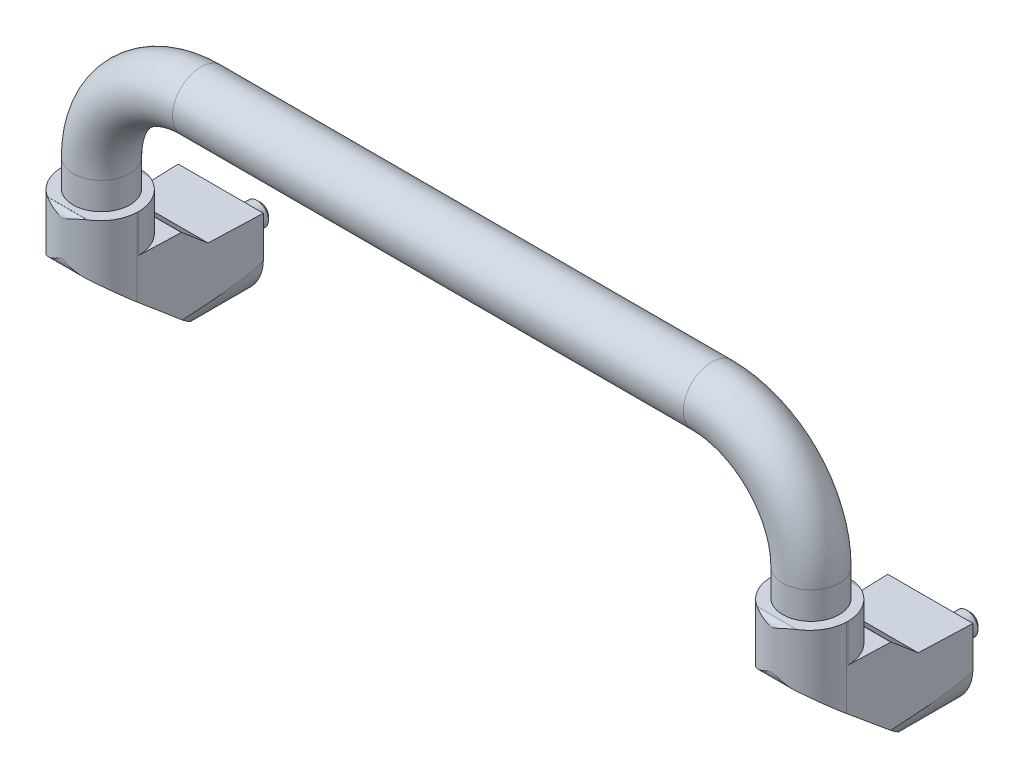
ISO-10303-21;
HEADER;
FILE_DESCRIPTION(('STEP AP214'),'2;1');
FILE_NAME('part.step','',(''),(''),'','','');
FILE_SCHEMA(('AUTOMOTIVE_DESIGN { 1 0 10303 214 1 1 1 1 }'));
ENDSEC;
DATA;
#1=APPLICATION_CONTEXT('core data for automotive mechanical design processes');
#2=APPLICATION_PROTOCOL_DEFINITION('international standard','automotive_design',2000,#1);
#3=PRODUCT_CONTEXT('',#1,'mechanical');
#4=PRODUCT('Part','Part','',(#3));
#5=PRODUCT_RELATED_PRODUCT_CATEGORY('part','',(#4));
#6=PRODUCT_DEFINITION_FORMATION('','',#4);
#7=PRODUCT_DEFINITION_CONTEXT('part definition',#1,'design');
#8=PRODUCT_DEFINITION('design','',#6,#7);
#9=PRODUCT_DEFINITION_SHAPE('','',#8);
#10=(LENGTH_UNIT() NAMED_UNIT(*) SI_UNIT(.MILLI.,.METRE.));
#11=(NAMED_UNIT(*) PLANE_ANGLE_UNIT() SI_UNIT($,.RADIAN.));
#12=(NAMED_UNIT(*) SI_UNIT($,.STERADIAN.) SOLID_ANGLE_UNIT());
#13=UNCERTAINTY_MEASURE_WITH_UNIT(LENGTH_MEASURE(1.E-05),#10,'distance_accuracy_value','');
#14=(GEOMETRIC_REPRESENTATION_CONTEXT(3) GLOBAL_UNCERTAINTY_ASSIGNED_CONTEXT((#13)) GLOBAL_UNIT_ASSIGNED_CONTEXT((#10,
#11,#12)) REPRESENTATION_CONTEXT('',''));
#15=CARTESIAN_POINT('',(0.,0.,0.));
#16=DIRECTION('',(0.,0.,1.));
#17=DIRECTION('',(1.,0.,0.));
#18=AXIS2_PLACEMENT_3D('',#15,#16,#17);
#19=CARTESIAN_POINT('',(14.595031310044,35.,11.5380553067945));
#20=DIRECTION('',(-0.999384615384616,0.,-0.0350769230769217));
#21=DIRECTION('',(-0.0350769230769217,0.,0.999384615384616));
#22=AXIS2_PLACEMENT_3D('',#19,#20,#21);
#23=PLANE('',#22);
#24=DIRECTION('',(0.0350769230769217,0.,-0.999384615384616));
#25=VECTOR('',#24,1.);
#26=CARTESIAN_POINT('',(14.595031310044,14.0068766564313,11.5380553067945));
#27=LINE('',#26,#25);
#28=CARTESIAN_POINT('',(14.3392753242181,14.0068766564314,18.824857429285));
#29=VERTEX_POINT('',#28);
#30=CARTESIAN_POINT('',(15.,14.0068766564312,0.));
#31=VERTEX_POINT('',#30);
#32=EDGE_CURVE('E655',#29,#31,#27,.T.);
#33=ORIENTED_EDGE('',*,*,#32,.F.);
#34=DIRECTION('',(0.0268773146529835,-0.642555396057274,-0.76576770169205));
#35=VECTOR('',#34,1.);
#36=CARTESIAN_POINT('',(14.126880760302,19.0845890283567,24.876239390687));
#37=LINE('',#36,#35);
#38=CARTESIAN_POINT('',(14.0194412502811,21.6531431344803,27.9373229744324));
#39=VERTEX_POINT('',#38);
#40=EDGE_CURVE('E649',#39,#29,#37,.T.);
#41=ORIENTED_EDGE('',*,*,#40,.F.);
#42=DIRECTION('',(0.,1.,0.));
#43=VECTOR('',#42,1.);
#44=CARTESIAN_POINT('',(14.0194412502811,35.,27.9373229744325));
#45=LINE('',#44,#43);
#46=CARTESIAN_POINT('',(14.0194412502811,21.6,27.9373229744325));
#47=VERTEX_POINT('',#46);
#48=EDGE_CURVE('E736',#47,#39,#45,.T.);
#49=ORIENTED_EDGE('',*,*,#48,.F.);
#50=DIRECTION('',(0.0350769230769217,0.,-0.999384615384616));
#51=VECTOR('',#50,1.);
#52=CARTESIAN_POINT('',(14.595031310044,21.6,11.5380553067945));
#53=LINE('',#52,#51);
#54=CARTESIAN_POINT('',(13.5083128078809,21.6,42.5));
#55=VERTEX_POINT('',#54);
#56=EDGE_CURVE('E733',#55,#47,#53,.T.);
#57=ORIENTED_EDGE('',*,*,#56,.F.);
#58=DIRECTION('',(0.,1.,0.));
#59=VECTOR('',#58,1.);
#60=CARTESIAN_POINT('',(13.5083128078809,35.,42.5));
#61=LINE('',#60,#59);
#62=CARTESIAN_POINT('',(13.5083128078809,35.,42.5));
#63=VERTEX_POINT('',#62);
#64=EDGE_CURVE('E701',#55,#63,#61,.T.);
#65=ORIENTED_EDGE('',*,*,#64,.T.);
#66=DIRECTION('',(0.0350769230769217,0.,-0.999384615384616));
#67=VECTOR('',#66,1.);
#68=CARTESIAN_POINT('',(14.595031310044,35.,11.5380553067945));
#69=LINE('',#68,#67);
#70=CARTESIAN_POINT('',(13.4916923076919,35.,42.9735384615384));
#71=VERTEX_POINT('',#70);
#72=EDGE_CURVE('E322',#71,#63,#69,.T.);
#73=ORIENTED_EDGE('',*,*,#72,.F.);
#74=DIRECTION('',(0.,-1.,0.));
#75=VECTOR('',#74,1.);
#76=CARTESIAN_POINT('',(13.4916923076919,35.,42.9735384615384));
#77=LINE('',#76,#75);
#78=CARTESIAN_POINT('',(13.4916923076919,7.63348617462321,42.9735384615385));
#79=VERTEX_POINT('',#78);
#80=EDGE_CURVE('E334',#71,#79,#77,.T.);
#81=ORIENTED_EDGE('',*,*,#80,.T.);
#82=DIRECTION('',(0.0268773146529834,-0.642555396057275,-0.765767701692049));
#83=VECTOR('',#82,1.);
#84=CARTESIAN_POINT('',(13.6668633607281,3.44567549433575,37.9827000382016));
#85=LINE('',#84,#83);
#86=CARTESIAN_POINT('',(14.03266224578,-5.29947075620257,27.5606405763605));
#87=VERTEX_POINT('',#86);
#88=EDGE_CURVE('E675',#79,#87,#85,.T.);
#89=ORIENTED_EDGE('',*,*,#88,.T.);
#90=CARTESIAN_POINT('',(0.,0.,427.36842105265));
#91=DIRECTION('',(-0.999384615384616,0.,-0.0350769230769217));
#92=DIRECTION('',(0.0350769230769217,0.,-0.999384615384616));
#93=AXIS2_PLACEMENT_3D('',#90,#91,#92);
#94=ELLIPSE('',#93,427.631578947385,15.);
#95=CARTESIAN_POINT('',(14.988671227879,-0.582867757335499,0.322770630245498));
#96=VERTEX_POINT('',#95);
#97=EDGE_CURVE('E308',#87,#96,#94,.F.);
#98=ORIENTED_EDGE('',*,*,#97,.T.);
#99=DIRECTION('',(0.0350769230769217,0.,-0.999384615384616));
#100=VECTOR('',#99,1.);
#101=CARTESIAN_POINT('',(14.595031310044,-0.582867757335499,11.5380553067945));
#102=LINE('',#101,#100);
#103=CARTESIAN_POINT('',(15.,-0.582867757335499,0.));
#104=VERTEX_POINT('',#103);
#105=EDGE_CURVE('E310',#96,#104,#102,.T.);
#106=ORIENTED_EDGE('',*,*,#105,.T.);
#107=DIRECTION('',(0.,-1.,0.));
#108=VECTOR('',#107,1.);
#109=CARTESIAN_POINT('',(15.,35.,0.));
#110=LINE('',#109,#108);
#111=EDGE_CURVE('E332',#31,#104,#110,.T.);
#112=ORIENTED_EDGE('',*,*,#111,.F.);
#113=EDGE_LOOP('',(#33,#41,#49,#57,#65,#73,#81,#89,#98,#106,#112));
#114=FACE_BOUND('',#113,.T.);
#115=ADVANCED_FACE('F14',(#114),#23,.F.);
#116=CARTESIAN_POINT('',(0.,35.,0.));
#117=DIRECTION('',(0.,0.,-1.));
#118=DIRECTION('',(0.,-1.,0.));
#119=AXIS2_PLACEMENT_3D('',#116,#117,#118);
#120=PLANE('',#119);
#121=CARTESIAN_POINT('',(0.,0.,0.));
#122=DIRECTION('',(0.,0.,-1.));
#123=DIRECTION('',(0.,-1.,0.));
#124=AXIS2_PLACEMENT_3D('',#121,#122,#123);
#125=CIRCLE('',#124,3.99999999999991);
#126=CARTESIAN_POINT('',(0.,-3.99999999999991,0.));
#127=VERTEX_POINT('',#126);
#128=EDGE_CURVE('E734',#127,#127,#125,.T.);
#129=ORIENTED_EDGE('',*,*,#128,.F.);
#130=EDGE_LOOP('',(#129));
#131=FACE_BOUND('',#130,.T.);
#132=DIRECTION('',(0.,-1.,0.));
#133=VECTOR('',#132,1.);
#134=CARTESIAN_POINT('',(-15.,35.,0.));
#135=LINE('',#134,#133);
#136=CARTESIAN_POINT('',(-15.,14.0068766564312,-2.97711074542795E-12));
#137=VERTEX_POINT('',#136);
#138=CARTESIAN_POINT('',(-15.,-0.582867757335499,0.));
#139=VERTEX_POINT('',#138);
#140=EDGE_CURVE('E340',#137,#139,#135,.T.);
#141=ORIENTED_EDGE('',*,*,#140,.F.);
#142=DIRECTION('',(1.,0.,0.));
#143=VECTOR('',#142,1.);
#144=CARTESIAN_POINT('',(0.,14.0068766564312,0.));
#145=LINE('',#144,#143);
#146=EDGE_CURVE('E653',#137,#31,#145,.T.);
#147=ORIENTED_EDGE('',*,*,#146,.T.);
#148=ORIENTED_EDGE('',*,*,#111,.T.);
#149=DIRECTION('',(1.,0.,0.));
#150=VECTOR('',#149,1.);
#151=CARTESIAN_POINT('',(14.988671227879,-0.582867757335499,0.));
#152=LINE('',#151,#150);
#153=CARTESIAN_POINT('',(14.988671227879,-0.582867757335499,0.));
#154=VERTEX_POINT('',#153);
#155=EDGE_CURVE('E297',#154,#104,#152,.T.);
#156=ORIENTED_EDGE('',*,*,#155,.F.);
#157=CARTESIAN_POINT('',(0.,0.,0.));
#158=DIRECTION('',(0.,0.,1.));
#159=DIRECTION('',(0.,-1.,0.));
#160=AXIS2_PLACEMENT_3D('',#157,#158,#159);
#161=CIRCLE('',#160,15.);
#162=CARTESIAN_POINT('',(-14.98867122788,-0.582867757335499,0.));
#163=VERTEX_POINT('',#162);
#164=EDGE_CURVE('E292',#163,#154,#161,.T.);
#165=ORIENTED_EDGE('',*,*,#164,.F.);
#166=DIRECTION('',(-1.,0.,0.));
#167=VECTOR('',#166,1.);
#168=CARTESIAN_POINT('',(-14.98867122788,-0.582867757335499,0.));
#169=LINE('',#168,#167);
#170=EDGE_CURVE('E294',#163,#139,#169,.T.);
#171=ORIENTED_EDGE('',*,*,#170,.T.);
#172=EDGE_LOOP('',(#141,#147,#148,#156,#165,#171));
#173=FACE_BOUND('',#172,.T.);
#174=ADVANCED_FACE('F564',(#131,#173),#120,.T.);
#175=CARTESIAN_POINT('',(0.,35.,42.5));
#176=DIRECTION('',(0.,1.,0.));
#177=DIRECTION('',(1.,0.,0.));
#178=AXIS2_PLACEMENT_3D('',#175,#176,#177);
#179=PLANE('',#178);
#180=CARTESIAN_POINT('',(-0.0396757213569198,35.,41.9999909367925));
#181=DIRECTION('',(0.,1.,0.));
#182=DIRECTION('',(-1.,0.,0.));
#183=AXIS2_PLACEMENT_3D('',#180,#181,#182);
#184=CIRCLE('',#183,10.);
#185=CARTESIAN_POINT('',(-10.0396757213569,35.,41.9999909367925));
#186=VERTEX_POINT('',#185);
#187=EDGE_CURVE('E342',#186,#186,#184,.T.);
#188=ORIENTED_EDGE('',*,*,#187,.F.);
#189=EDGE_LOOP('',(#188));
#190=FACE_BOUND('',#189,.T.);
#191=CARTESIAN_POINT('',(0.,35.,42.5));
#192=DIRECTION('',(0.,-1.,0.));
#193=DIRECTION('',(1.,0.,0.));
#194=AXIS2_PLACEMENT_3D('',#191,#192,#193);
#195=CIRCLE('',#194,13.5);
#196=CARTESIAN_POINT('',(5.09901951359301,35.,30.));
#197=VERTEX_POINT('',#196);
#198=CARTESIAN_POINT('',(13.5000000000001,35.,42.5));
#199=VERTEX_POINT('',#198);
#200=EDGE_CURVE('E257',#197,#199,#195,.T.);
#201=ORIENTED_EDGE('',*,*,#200,.F.);
#202=DIRECTION('',(1.,0.,0.));
#203=VECTOR('',#202,1.);
#204=CARTESIAN_POINT('',(-15.,35.,30.));
#205=LINE('',#204,#203);
#206=CARTESIAN_POINT('',(-5.099019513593,35.,30.));
#207=VERTEX_POINT('',#206);
#208=EDGE_CURVE('E36',#207,#197,#205,.T.);
#209=ORIENTED_EDGE('',*,*,#208,.F.);
#210=CARTESIAN_POINT('',(-13.5,35.,42.5));
#211=VERTEX_POINT('',#210);
#212=EDGE_CURVE('E255',#211,#207,#195,.T.);
#213=ORIENTED_EDGE('',*,*,#212,.F.);
#214=DIRECTION('',(1.,0.,0.));
#215=VECTOR('',#214,1.);
#216=CARTESIAN_POINT('',(-14.98867122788,35.,42.5));
#217=LINE('',#216,#215);
#218=CARTESIAN_POINT('',(-13.508312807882,35.,42.5));
#219=VERTEX_POINT('',#218);
#220=EDGE_CURVE('E265',#219,#211,#217,.T.);
#221=ORIENTED_EDGE('',*,*,#220,.F.);
#222=DIRECTION('',(0.0350769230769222,0.,0.999384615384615));
#223=VECTOR('',#222,1.);
#224=CARTESIAN_POINT('',(-14.5950313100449,35.,11.5380553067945));
#225=LINE('',#224,#223);
#226=CARTESIAN_POINT('',(-13.4916923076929,35.,42.9735384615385));
#227=VERTEX_POINT('',#226);
#228=EDGE_CURVE('E329',#219,#227,#225,.T.);
#229=ORIENTED_EDGE('',*,*,#228,.T.);
#230=CARTESIAN_POINT('',(0.,35.,42.5));
#231=DIRECTION('',(0.,-1.,0.));
#232=DIRECTION('',(1.,0.,0.));
#233=AXIS2_PLACEMENT_3D('',#230,#231,#232);
#234=CIRCLE('',#233,13.5);
#235=CARTESIAN_POINT('',(-7.070924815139,35.,54.000087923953));
#236=VERTEX_POINT('',#235);
#237=EDGE_CURVE('E325',#236,#227,#234,.T.);
#238=ORIENTED_EDGE('',*,*,#237,.F.);
#239=DIRECTION('',(-1.,0.,0.));
#240=VECTOR('',#239,1.);
#241=CARTESIAN_POINT('',(0.,35.,54.000087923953));
#242=LINE('',#241,#240);
#243=CARTESIAN_POINT('',(7.07092481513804,35.,54.000087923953));
#244=VERTEX_POINT('',#243);
#245=EDGE_CURVE('E598',#244,#236,#242,.T.);
#246=ORIENTED_EDGE('',*,*,#245,.F.);
#247=EDGE_CURVE('E326',#71,#244,#234,.T.);
#248=ORIENTED_EDGE('',*,*,#247,.F.);
#249=ORIENTED_EDGE('',*,*,#72,.T.);
#250=DIRECTION('',(1.,0.,0.));
#251=VECTOR('',#250,1.);
#252=CARTESIAN_POINT('',(13.5000000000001,35.,42.5));
#253=LINE('',#252,#251);
#254=EDGE_CURVE('E267',#199,#63,#253,.T.);
#255=ORIENTED_EDGE('',*,*,#254,.F.);
#256=EDGE_LOOP('',(#201,#209,#213,#221,#229,#238,#246,#248,#249,#255));
#257=FACE_BOUND('',#256,.T.);
#258=ADVANCED_FACE('F253',(#190,#257),#179,.T.);
#259=CARTESIAN_POINT('',(-14.5950313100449,35.,11.5380553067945));
#260=DIRECTION('',(0.999384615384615,0.,-0.0350769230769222));
#261=DIRECTION('',(-0.0350769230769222,0.,-0.999384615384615));
#262=AXIS2_PLACEMENT_3D('',#259,#260,#261);
#263=PLANE('',#262);
#264=DIRECTION('',(0.0350769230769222,0.,0.999384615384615));
#265=VECTOR('',#264,1.);
#266=CARTESIAN_POINT('',(-14.5950313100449,14.0068766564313,11.5380553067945));
#267=LINE('',#266,#265);
#268=CARTESIAN_POINT('',(-14.339275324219,14.0068766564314,18.824857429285));
#269=VERTEX_POINT('',#268);
#270=EDGE_CURVE('E9',#137,#269,#267,.T.);
#271=ORIENTED_EDGE('',*,*,#270,.F.);
#272=ORIENTED_EDGE('',*,*,#140,.T.);
#273=DIRECTION('',(-0.0350769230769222,0.,-0.999384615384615));
#274=VECTOR('',#273,1.);
#275=CARTESIAN_POINT('',(-14.5950313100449,-0.582867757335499,11.5380553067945));
#276=LINE('',#275,#274);
#277=CARTESIAN_POINT('',(-14.98867122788,-0.5828677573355,0.322770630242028));
#278=VERTEX_POINT('',#277);
#279=EDGE_CURVE('E313',#278,#139,#276,.T.);
#280=ORIENTED_EDGE('',*,*,#279,.F.);
#281=CARTESIAN_POINT('',(0.,0.,427.36842105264));
#282=DIRECTION('',(0.999384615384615,0.,-0.0350769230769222));
#283=DIRECTION('',(-0.0350769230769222,0.,-0.999384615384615));
#284=AXIS2_PLACEMENT_3D('',#281,#282,#283);
#285=ELLIPSE('',#284,427.631578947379,15.);
#286=CARTESIAN_POINT('',(-14.0326622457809,-5.29947075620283,27.56064057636));
#287=VERTEX_POINT('',#286);
#288=EDGE_CURVE('E305',#278,#287,#285,.F.);
#289=ORIENTED_EDGE('',*,*,#288,.T.);
#290=DIRECTION('',(0.0268773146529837,0.642555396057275,0.765767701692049));
#291=VECTOR('',#290,1.);
#292=CARTESIAN_POINT('',(-13.6668633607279,3.4456754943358,37.9827000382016));
#293=LINE('',#292,#291);
#294=CARTESIAN_POINT('',(-13.4916923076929,7.6334861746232,42.9735384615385));
#295=VERTEX_POINT('',#294);
#296=EDGE_CURVE('E672',#287,#295,#293,.T.);
#297=ORIENTED_EDGE('',*,*,#296,.T.);
#298=DIRECTION('',(0.,-1.,0.));
#299=VECTOR('',#298,1.);
#300=CARTESIAN_POINT('',(-13.4916923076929,35.,42.9735384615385));
#301=LINE('',#300,#299);
#302=EDGE_CURVE('E337',#227,#295,#301,.T.);
#303=ORIENTED_EDGE('',*,*,#302,.F.);
#304=ORIENTED_EDGE('',*,*,#228,.F.);
#305=DIRECTION('',(0.,-1.,0.));
#306=VECTOR('',#305,1.);
#307=CARTESIAN_POINT('',(-13.508312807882,35.,42.5));
#308=LINE('',#307,#306);
#309=CARTESIAN_POINT('',(-13.508312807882,21.6,42.5));
#310=VERTEX_POINT('',#309);
#311=EDGE_CURVE('E693',#219,#310,#308,.T.);
#312=ORIENTED_EDGE('',*,*,#311,.T.);
#313=DIRECTION('',(0.0350769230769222,0.,0.999384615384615));
#314=VECTOR('',#313,1.);
#315=CARTESIAN_POINT('',(-14.5950313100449,21.6,11.5380553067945));
#316=LINE('',#315,#314);
#317=CARTESIAN_POINT('',(-14.0194412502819,21.6,27.9373229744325));
#318=VERTEX_POINT('',#317);
#319=EDGE_CURVE('E288',#318,#310,#316,.T.);
#320=ORIENTED_EDGE('',*,*,#319,.F.);
#321=DIRECTION('',(0.,-1.,0.));
#322=VECTOR('',#321,1.);
#323=CARTESIAN_POINT('',(-14.0194412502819,35.,27.9373229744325));
#324=LINE('',#323,#322);
#325=CARTESIAN_POINT('',(-14.0194412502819,21.6531431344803,27.9373229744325));
#326=VERTEX_POINT('',#325);
#327=EDGE_CURVE('E290',#326,#318,#324,.T.);
#328=ORIENTED_EDGE('',*,*,#327,.F.);
#329=DIRECTION('',(0.0268773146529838,0.642555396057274,0.76576770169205));
#330=VECTOR('',#329,1.);
#331=CARTESIAN_POINT('',(-14.126880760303,19.0845890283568,24.8762393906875));
#332=LINE('',#331,#330);
#333=EDGE_CURVE('E29',#269,#326,#332,.T.);
#334=ORIENTED_EDGE('',*,*,#333,.F.);
#335=EDGE_LOOP('',(#271,#272,#280,#289,#297,#303,#304,#312,#320,#328,#334));
#336=FACE_BOUND('',#335,.T.);
#337=ADVANCED_FACE('F583',(#336),#263,.F.);
#338=CARTESIAN_POINT('',(-14.98867122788,21.6,27.9373229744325));
#339=DIRECTION('',(0.,0.,1.));
#340=DIRECTION('',(0.,1.,0.));
#341=AXIS2_PLACEMENT_3D('',#338,#339,#340);
#342=PLANE('',#341);
#343=ORIENTED_EDGE('',*,*,#48,.T.);
#344=DIRECTION('',(-1.,0.,0.));
#345=VECTOR('',#344,1.);
#346=CARTESIAN_POINT('',(-14.98867122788,21.6531431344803,27.9373229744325));
#347=LINE('',#346,#345);
#348=EDGE_CURVE('E22',#39,#326,#347,.T.);
#349=ORIENTED_EDGE('',*,*,#348,.T.);
#350=ORIENTED_EDGE('',*,*,#327,.T.);
#351=DIRECTION('',(1.,0.,0.));
#352=VECTOR('',#351,1.);
#353=CARTESIAN_POINT('',(-14.98867122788,21.6,27.9373229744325));
#354=LINE('',#353,#352);
#355=EDGE_CURVE('E279',#318,#47,#354,.T.);
#356=ORIENTED_EDGE('',*,*,#355,.T.);
#357=EDGE_LOOP('',(#343,#349,#350,#356));
#358=FACE_BOUND('',#357,.T.);
#359=ADVANCED_FACE('F581',(#358),#342,.T.);
#360=CARTESIAN_POINT('',(0.,35.,42.5));
#361=DIRECTION('',(0.,-1.,0.));
#362=DIRECTION('',(1.,0.,0.));
#363=AXIS2_PLACEMENT_3D('',#360,#361,#362);
#364=CYLINDRICAL_SURFACE('',#363,13.5);
#365=DIRECTION('',(0.,-1.,0.));
#366=VECTOR('',#365,1.);
#367=CARTESIAN_POINT('',(7.07092481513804,35.,54.000087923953));
#368=LINE('',#367,#366);
#369=CARTESIAN_POINT('',(7.07092481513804,34.9704219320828,54.000087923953));
#370=VERTEX_POINT('',#369);
#371=EDGE_CURVE('E682',#370,#244,#368,.F.);
#372=ORIENTED_EDGE('',*,*,#371,.F.);
#373=CARTESIAN_POINT('',(-7.070924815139,34.9704219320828,54.000087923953));
#374=CARTESIAN_POINT('',(-6.87750374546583,34.9704282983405,54.11901151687));
#375=CARTESIAN_POINT('',(-6.68105374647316,34.959869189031,54.2330583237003));
#376=CARTESIAN_POINT('',(-6.28381350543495,34.9221612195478,54.4505270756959));
#377=CARTESIAN_POINT('',(-6.08301891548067,34.8949949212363,54.5539377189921));
#378=CARTESIAN_POINT('',(-5.67707138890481,34.8272761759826,54.7503886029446));
#379=CARTESIAN_POINT('',(-5.47189888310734,34.7866398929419,54.8433588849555));
#380=CARTESIAN_POINT('',(-5.05931393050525,34.694757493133,55.0181285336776));
#381=CARTESIAN_POINT('',(-4.85190211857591,34.6435143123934,55.0999309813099));
#382=CARTESIAN_POINT('',(-4.36508724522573,34.5138570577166,55.2782623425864));
#383=CARTESIAN_POINT('',(-4.08498441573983,34.4321066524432,55.3704604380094));
#384=CARTESIAN_POINT('',(-3.52253018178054,34.2574892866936,55.5356338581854));
#385=CARTESIAN_POINT('',(-3.24017788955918,34.1646177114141,55.6086011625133));
#386=CARTESIAN_POINT('',(-2.67652768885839,33.9718090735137,55.735138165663));
#387=CARTESIAN_POINT('',(-2.39524290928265,33.8719425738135,55.7888753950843));
#388=CARTESIAN_POINT('',(-1.83184388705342,33.6670280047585,55.8781780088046));
#389=CARTESIAN_POINT('',(-1.54973016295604,33.5619827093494,55.9137530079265));
#390=CARTESIAN_POINT('',(-1.17146433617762,33.4192935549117,55.949421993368));
#391=CARTESIAN_POINT('',(-1.07551786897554,33.3829421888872,55.9574338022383));
#392=CARTESIAN_POINT('',(-0.883513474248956,33.3099862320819,55.9714019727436));
#393=CARTESIAN_POINT('',(-0.787455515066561,33.2733815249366,55.9773573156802));
#394=CARTESIAN_POINT('',(-0.593228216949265,33.1991990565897,55.9873180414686));
#395=CARTESIAN_POINT('',(-0.495058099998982,33.1616173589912,55.9912785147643));
#396=CARTESIAN_POINT('',(-0.347759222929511,33.1055246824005,55.9956090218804));
#397=CARTESIAN_POINT('',(-0.298700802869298,33.0868920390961,55.996783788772));
#398=CARTESIAN_POINT('',(-0.200553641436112,33.0496905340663,55.9985999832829));
#399=CARTESIAN_POINT('',(-0.151464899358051,33.0311216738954,55.9992413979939));
#400=CARTESIAN_POINT('',(-0.0849879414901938,33.0080155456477,55.9997430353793));
#401=CARTESIAN_POINT('',(-0.0680493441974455,33.0023025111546,55.9998394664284));
#402=CARTESIAN_POINT('',(-0.0424994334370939,32.9952097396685,55.9999356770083));
#403=CARTESIAN_POINT('',(-0.0341004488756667,32.9931150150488,55.9999596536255));
#404=CARTESIAN_POINT('',(-0.0171291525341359,32.9901026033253,55.9999917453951));
#405=CARTESIAN_POINT('',(-0.00855921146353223,32.9891740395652,56.0000000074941));
#406=CARTESIAN_POINT('',(0.00879402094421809,32.9891765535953,55.9999999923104));
#407=CARTESIAN_POINT('',(0.0175772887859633,32.9901547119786,55.9999912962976));
#408=CARTESIAN_POINT('',(0.0349664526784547,32.9933005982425,55.9999575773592));
#409=CARTESIAN_POINT('',(0.043569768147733,32.9954798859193,55.999932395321));
#410=CARTESIAN_POINT('',(0.0697279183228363,33.002831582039,55.9998314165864));
#411=CARTESIAN_POINT('',(0.0870672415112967,33.0087214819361,55.9997302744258));
#412=CARTESIAN_POINT('',(0.171095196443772,33.038014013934,55.9990808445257));
#413=CARTESIAN_POINT('',(0.237058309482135,33.0633144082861,55.9980811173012));
#414=CARTESIAN_POINT('',(0.367738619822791,33.1132270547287,55.9951443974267));
#415=CARTESIAN_POINT('',(0.432454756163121,33.1378430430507,55.9932262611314));
#416=CARTESIAN_POINT('',(0.627360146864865,33.2121316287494,55.9860459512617));
#417=CARTESIAN_POINT('',(0.757454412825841,33.2619227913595,55.9793646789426));
#418=CARTESIAN_POINT('',(1.01760396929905,33.3610278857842,55.962223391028));
#419=CARTESIAN_POINT('',(1.14765924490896,33.4103417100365,55.9517625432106));
#420=CARTESIAN_POINT('',(1.54015609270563,33.558312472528,55.9144503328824));
#421=CARTESIAN_POINT('',(1.80241871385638,33.6560305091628,55.8817605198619));
#422=CARTESIAN_POINT('',(2.39427723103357,33.8719079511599,55.7901814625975));
#423=CARTESIAN_POINT('',(2.72364690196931,33.9887746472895,55.7266896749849));
#424=CARTESIAN_POINT('',(3.3805287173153,34.2114954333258,55.574242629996));
#425=CARTESIAN_POINT('',(3.70803931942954,34.3173413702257,55.4852687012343));
#426=CARTESIAN_POINT('',(4.35819027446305,34.5122628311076,55.2816858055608));
#427=CARTESIAN_POINT('',(4.68084736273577,34.6014256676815,55.1672175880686));
#428=CARTESIAN_POINT('',(5.16087542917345,34.7178726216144,54.9757774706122));
#429=CARTESIAN_POINT('',(5.32015518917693,34.7537932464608,54.9087086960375));
#430=CARTESIAN_POINT('',(5.6371607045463,34.8187750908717,54.7679448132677));
#431=CARTESIAN_POINT('',(5.79488691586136,34.8478383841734,54.6942517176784));
#432=CARTESIAN_POINT('',(6.06000533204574,34.8900814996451,54.5640340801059));
#433=CARTESIAN_POINT('',(6.16790737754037,34.9053950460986,54.5092308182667));
#434=CARTESIAN_POINT('',(6.38261514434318,34.9315949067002,54.3965087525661));
#435=CARTESIAN_POINT('',(6.48942096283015,34.9424816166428,54.3385902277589));
#436=CARTESIAN_POINT('',(6.70186294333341,34.959243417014,54.2196361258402));
#437=CARTESIAN_POINT('',(6.80749751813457,34.9651123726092,54.1585968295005));
#438=CARTESIAN_POINT('',(7.01720095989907,34.9711201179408,54.0335939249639));
#439=CARTESIAN_POINT('',(7.12126983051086,34.9712589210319,53.9696303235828));
#440=CARTESIAN_POINT('',(7.32838648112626,34.9649685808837,53.8384260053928));
#441=CARTESIAN_POINT('',(7.43141794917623,34.9584833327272,53.771161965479));
#442=CARTESIAN_POINT('',(7.63511779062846,34.9378853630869,53.6341833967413));
#443=CARTESIAN_POINT('',(7.73578568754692,34.923771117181,53.5644683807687));
#444=CARTESIAN_POINT('',(7.93394129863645,34.8868175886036,53.4232476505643));
#445=CARTESIAN_POINT('',(8.0314351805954,34.8639964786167,53.3517459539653));
#446=CARTESIAN_POINT('',(8.22260264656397,34.808343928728,53.2076198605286));
#447=CARTESIAN_POINT('',(8.31627877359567,34.7755192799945,53.1349962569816));
#448=CARTESIAN_POINT('',(8.5105758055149,34.6934220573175,52.9803342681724));
#449=CARTESIAN_POINT('',(8.61054102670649,34.6425773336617,52.8982859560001));
#450=CARTESIAN_POINT('',(8.80216710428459,34.5239909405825,52.7365776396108));
#451=CARTESIAN_POINT('',(8.8938337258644,34.4562611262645,52.6569160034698));
#452=CARTESIAN_POINT('',(9.05162034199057,34.3145923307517,52.5163590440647));
#453=CARTESIAN_POINT('',(9.11946043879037,34.2435185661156,52.4545352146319));
#454=CARTESIAN_POINT('',(9.24476625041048,34.087467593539,52.3382710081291));
#455=CARTESIAN_POINT('',(9.30224701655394,34.0025109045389,52.2838199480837));
#456=CARTESIAN_POINT('',(9.39284210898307,33.8391516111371,52.196782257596));
#457=CARTESIAN_POINT('',(9.42853677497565,33.7633500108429,52.1620164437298));
#458=CARTESIAN_POINT('',(9.4902787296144,33.6045451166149,52.1013794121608));
#459=CARTESIAN_POINT('',(9.51633106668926,33.5215456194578,52.0755035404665));
#460=CARTESIAN_POINT('',(9.55753005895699,33.3497074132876,52.0343845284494));
#461=CARTESIAN_POINT('',(9.57260589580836,33.260834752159,52.0192104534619));
#462=CARTESIAN_POINT('',(9.59060313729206,33.0806412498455,52.0010792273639));
#463=CARTESIAN_POINT('',(9.5935302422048,32.9893215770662,51.9981163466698));
#464=CARTESIAN_POINT('',(9.587397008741,32.8171715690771,52.004305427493));
#465=CARTESIAN_POINT('',(9.57956343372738,32.7362469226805,52.0122176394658));
#466=CARTESIAN_POINT('',(9.55445710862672,32.5774089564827,52.0374347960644));
#467=CARTESIAN_POINT('',(9.53718461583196,32.499495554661,52.0547394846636));
#468=CARTESIAN_POINT('',(9.49381006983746,32.3477345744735,52.0978384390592));
#469=CARTESIAN_POINT('',(9.46761759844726,32.2739380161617,52.1237195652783));
#470=CARTESIAN_POINT('',(9.40755152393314,32.1325392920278,52.1824450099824));
#471=CARTESIAN_POINT('',(9.37367436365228,32.0649400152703,52.2152925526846));
#472=CARTESIAN_POINT('',(9.28309871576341,31.9085063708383,52.3020150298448));
#473=CARTESIAN_POINT('',(9.22289796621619,31.8233081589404,52.3588047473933));
#474=CARTESIAN_POINT('',(9.0920164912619,31.6673398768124,52.4796404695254));
#475=CARTESIAN_POINT('',(9.02131423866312,31.5966001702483,52.5437013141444));
#476=CARTESIAN_POINT('',(8.83971629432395,31.4412059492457,52.7043937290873));
#477=CARTESIAN_POINT('',(8.72463129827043,31.3636956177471,52.8031628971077));
#478=CARTESIAN_POINT('',(8.48328068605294,31.2326908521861,53.0027921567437));
#479=CARTESIAN_POINT('',(8.35699456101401,31.179241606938,53.10365581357));
#480=CARTESIAN_POINT('',(8.12310761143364,31.1012155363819,53.2834270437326));
#481=CARTESIAN_POINT('',(8.0169118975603,31.0729815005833,53.3626386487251));
#482=CARTESIAN_POINT('',(7.80064869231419,31.027444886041,53.5189695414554));
#483=CARTESIAN_POINT('',(7.69057893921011,31.0101488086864,53.5960875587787));
#484=CARTESIAN_POINT('',(7.46735068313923,30.9849468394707,53.7475282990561));
#485=CARTESIAN_POINT('',(7.35418900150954,30.9770510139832,53.8218479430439));
#486=CARTESIAN_POINT('',(7.12546874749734,30.9693699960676,53.9671737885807));
#487=CARTESIAN_POINT('',(7.00990934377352,30.9695876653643,54.0381788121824));
#488=CARTESIAN_POINT('',(6.69420345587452,30.9796506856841,54.2256662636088));
#489=CARTESIAN_POINT('',(6.49219751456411,30.9962153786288,54.3386830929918));
#490=CARTESIAN_POINT('',(6.08416654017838,31.0453499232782,54.5534718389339));
#491=CARTESIAN_POINT('',(5.87813877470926,31.0779310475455,54.6552357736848));
#492=CARTESIAN_POINT('',(5.46253603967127,31.1558917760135,54.847602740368));
#493=CARTESIAN_POINT('',(5.25295184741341,31.2013118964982,54.9381691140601));
#494=CARTESIAN_POINT('',(4.83167592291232,31.3022724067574,55.1077942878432));
#495=CARTESIAN_POINT('',(4.61998458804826,31.3578109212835,55.18685521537));
#496=CARTESIAN_POINT('',(4.13829353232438,31.4928100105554,55.3532339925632));
#497=CARTESIAN_POINT('',(3.86779442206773,31.5747008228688,55.4371341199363));
#498=CARTESIAN_POINT('',(3.32490231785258,31.7480204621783,55.5871836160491));
#499=CARTESIAN_POINT('',(3.05250878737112,31.8394521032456,55.6533277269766));
#500=CARTESIAN_POINT('',(2.50838879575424,32.0284631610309,55.7678081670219));
#501=CARTESIAN_POINT('',(2.23667121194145,32.1259945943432,55.8162669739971));
#502=CARTESIAN_POINT('',(1.69251556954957,32.3255150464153,55.8963048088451));
#503=CARTESIAN_POINT('',(1.42007787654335,32.4275021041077,55.927891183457));
#504=CARTESIAN_POINT('',(1.05943377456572,32.563997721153,55.9586551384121));
#505=CARTESIAN_POINT('',(0.971407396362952,32.5974308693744,55.9652943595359));
#506=CARTESIAN_POINT('',(0.795276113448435,32.6644946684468,55.9768441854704));
#507=CARTESIAN_POINT('',(0.707171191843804,32.6981253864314,55.9817541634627));
#508=CARTESIAN_POINT('',(0.574252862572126,32.7488848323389,55.9878553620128));
#509=CARTESIAN_POINT('',(0.52946012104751,32.7659944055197,55.9896878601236));
#510=CARTESIAN_POINT('',(0.439859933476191,32.8002299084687,55.9929068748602));
#511=CARTESIAN_POINT('',(0.395052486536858,32.8173558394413,55.9942933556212));
#512=CARTESIAN_POINT('',(0.305429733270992,32.8514111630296,55.9966185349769));
#513=CARTESIAN_POINT('',(0.260614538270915,32.8683408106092,55.9975578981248));
#514=CARTESIAN_POINT('',(0.170992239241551,32.9022294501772,55.9989921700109));
#515=CARTESIAN_POINT('',(0.126185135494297,32.9191884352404,55.9994871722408));
#516=CARTESIAN_POINT('',(0.0673393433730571,32.9385313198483,55.9998385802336));
#517=CARTESIAN_POINT('',(0.0539644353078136,32.9427370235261,55.9998990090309));
#518=CARTESIAN_POINT('',(0.033730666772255,32.9476947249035,55.9999594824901));
#519=CARTESIAN_POINT('',(0.02704889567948,32.9491116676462,55.9999746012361));
#520=CARTESIAN_POINT('',(0.0135759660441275,32.9510967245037,55.9999948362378));
#521=CARTESIAN_POINT('',(0.00678553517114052,32.9516691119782,56.0000000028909));
#522=CARTESIAN_POINT('',(-0.00692023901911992,32.9516680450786,55.9999999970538));
#523=CARTESIAN_POINT('',(-0.0138355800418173,32.9510732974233,55.9999946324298));
#524=CARTESIAN_POINT('',(-0.0275536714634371,32.9490209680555,55.9999736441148));
#525=CARTESIAN_POINT('',(-0.03435563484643,32.947558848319,55.9999579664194));
#526=CARTESIAN_POINT('',(-0.0549419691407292,32.9424579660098,55.999895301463));
#527=CARTESIAN_POINT('',(-0.0685452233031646,32.9381473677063,55.9998327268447));
#528=CARTESIAN_POINT('',(-0.13733940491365,32.9154604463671,55.9994146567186));
#529=CARTESIAN_POINT('',(-0.191635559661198,32.8946356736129,55.998750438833));
#530=CARTESIAN_POINT('',(-0.299452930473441,32.8535542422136,55.9967831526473));
#531=CARTESIAN_POINT('',(-0.352973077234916,32.8332937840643,55.9954901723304));
#532=CARTESIAN_POINT('',(-0.513910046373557,32.7721117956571,55.9906445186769));
#533=CARTESIAN_POINT('',(-0.621219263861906,32.7309705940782,55.9861281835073));
#534=CARTESIAN_POINT('',(-0.83582649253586,32.6489898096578,55.9745286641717));
#535=CARTESIAN_POINT('',(-0.943124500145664,32.6081502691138,55.9674451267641));
#536=CARTESIAN_POINT('',(-1.26653114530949,32.4854908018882,55.9422069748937));
#537=CARTESIAN_POINT('',(-1.48252415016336,32.4041563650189,55.9201133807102));
#538=CARTESIAN_POINT('',(-2.05310658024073,32.1922671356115,55.847758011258));
#539=CARTESIAN_POINT('',(-2.40736493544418,32.0637495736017,55.7885189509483));
#540=CARTESIAN_POINT('',(-3.11404692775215,31.8178919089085,55.6408966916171));
#541=CARTESIAN_POINT('',(-3.46646876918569,31.7005613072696,55.5524889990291));
#542=CARTESIAN_POINT('',(-4.16746062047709,31.4833378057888,55.3458337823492));
#543=CARTESIAN_POINT('',(-4.51603625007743,31.3834150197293,55.2276382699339));
#544=CARTESIAN_POINT('',(-5.03457491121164,31.2526265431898,55.0274642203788));
#545=CARTESIAN_POINT('',(-5.20662438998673,31.2122268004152,54.9569626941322));
#546=CARTESIAN_POINT('',(-5.54900117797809,31.1391058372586,54.8082653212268));
#547=CARTESIAN_POINT('',(-5.71932895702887,31.1063824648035,54.7300716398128));
#548=CARTESIAN_POINT('',(-6.05789214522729,31.0501830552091,54.5659581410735));
#549=CARTESIAN_POINT('',(-6.22612665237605,31.0267108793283,54.480035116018));
#550=CARTESIAN_POINT('',(-6.55983624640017,30.9910136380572,54.3006114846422));
#551=CARTESIAN_POINT('',(-6.72531058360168,30.978791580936,54.2071088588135));
#552=CARTESIAN_POINT('',(-7.05166813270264,30.9681285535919,54.013460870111));
#553=CARTESIAN_POINT('',(-7.21257096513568,30.9696151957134,53.9133531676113));
#554=CARTESIAN_POINT('',(-7.52921914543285,30.9893042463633,53.70698335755));
#555=CARTESIAN_POINT('',(-7.6849702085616,31.0074874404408,53.6007284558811));
#556=CARTESIAN_POINT('',(-7.96520055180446,31.0599487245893,53.4009313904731));
#557=CARTESIAN_POINT('',(-8.0907094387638,31.0912019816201,53.3080599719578));
#558=CARTESIAN_POINT('',(-8.33518178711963,31.171254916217,53.120661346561));
#559=CARTESIAN_POINT('',(-8.45413646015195,31.2200775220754,53.0261321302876));
#560=CARTESIAN_POINT('',(-8.68395719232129,31.3392533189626,52.8373706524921));
#561=CARTESIAN_POINT('',(-8.79471396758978,31.4098486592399,52.7431544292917));
#562=CARTESIAN_POINT('',(-9.00217867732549,31.5758213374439,52.561293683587));
#563=CARTESIAN_POINT('',(-9.09893281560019,31.6711141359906,52.4736280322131));
#564=CARTESIAN_POINT('',(-9.2387943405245,31.8463568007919,52.3437817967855));
#565=CARTESIAN_POINT('',(-9.28817710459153,31.9179858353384,52.2971229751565));
#566=CARTESIAN_POINT('',(-9.37762994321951,32.0711185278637,52.2115327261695));
#567=CARTESIAN_POINT('',(-9.41770381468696,32.1526181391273,52.1725981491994));
#568=CARTESIAN_POINT('',(-9.48688680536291,32.3251423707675,52.1047578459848));
#569=CARTESIAN_POINT('',(-9.51588964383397,32.4162491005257,52.0759495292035));
#570=CARTESIAN_POINT('',(-9.56048639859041,32.6047461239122,52.0314280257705));
#571=CARTESIAN_POINT('',(-9.57609448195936,32.7021296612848,52.0157010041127));
#572=CARTESIAN_POINT('',(-9.59162429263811,32.885885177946,52.0000441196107));
#573=CARTESIAN_POINT('',(-9.59339475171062,32.9719479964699,51.9982526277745));
#574=CARTESIAN_POINT('',(-9.58599731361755,33.1431030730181,52.0057185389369));
#575=CARTESIAN_POINT('',(-9.57683219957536,33.2281955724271,52.0149731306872));
#576=CARTESIAN_POINT('',(-9.54901245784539,33.3895386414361,52.0428879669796));
#577=CARTESIAN_POINT('',(-9.53098605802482,33.4660095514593,52.0609248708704));
#578=CARTESIAN_POINT('',(-9.48665037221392,33.6140818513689,52.1049172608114));
#579=CARTESIAN_POINT('',(-9.46033984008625,33.6856825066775,52.1308739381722));
#580=CARTESIAN_POINT('',(-9.39781448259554,33.828959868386,52.1919112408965));
#581=CARTESIAN_POINT('',(-9.36092955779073,33.9000833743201,52.2275957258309));
#582=CARTESIAN_POINT('',(-9.27994226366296,34.0345276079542,52.3048874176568));
#583=CARTESIAN_POINT('',(-9.23583574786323,34.0978438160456,52.346498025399));
#584=CARTESIAN_POINT('',(-9.11466106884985,34.2505440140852,52.4590709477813));
#585=CARTESIAN_POINT('',(-9.03317781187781,34.3341014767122,52.5331997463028));
#586=CARTESIAN_POINT('',(-8.85933060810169,34.4828442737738,52.6870411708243));
#587=CARTESIAN_POINT('',(-8.76693805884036,34.5479797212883,52.7667682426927));
#588=CARTESIAN_POINT('',(-8.59815180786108,34.6477136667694,52.9082068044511));
#589=CARTESIAN_POINT('',(-8.52345485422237,34.6858802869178,52.969495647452));
#590=CARTESIAN_POINT('',(-8.37043434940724,34.7538821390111,53.0922352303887));
#591=CARTESIAN_POINT('',(-8.29210876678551,34.7837126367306,53.1536860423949));
#592=CARTESIAN_POINT('',(-8.13252186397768,34.8359308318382,53.2760015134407));
#593=CARTESIAN_POINT('',(-8.051258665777,34.8583136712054,53.3368657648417));
#594=CARTESIAN_POINT('',(-7.88639943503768,34.8964308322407,53.457423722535));
#595=CARTESIAN_POINT('',(-7.8028040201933,34.9121668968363,53.5171177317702));
#596=CARTESIAN_POINT('',(-7.61287066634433,34.9408824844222,53.6494700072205));
#597=CARTESIAN_POINT('',(-7.50599405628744,34.9522332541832,53.7217075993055));
#598=CARTESIAN_POINT('',(-7.29004404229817,34.9669944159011,53.8631824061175));
#599=CARTESIAN_POINT('',(-7.18097469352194,34.970418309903,53.9324245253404));
#600=CARTESIAN_POINT('',(-7.070924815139,34.9704219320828,54.000087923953));
#601=B_SPLINE_CURVE_WITH_KNOTS('',3,(#373,#374,#375,#376,#377,#378,#379,#380,#381,#382,#383,
#384,#385,#386,#387,#388,#389,#390,#391,#392,#393,#394,#395,#396,#397,#398,#399,#400,#401,#402,
#403,#404,#405,#406,#407,#408,#409,#410,#411,#412,#413,#414,#415,#416,#417,#418,#419,#420,#421,
#422,#423,#424,#425,#426,#427,#428,#429,#430,#431,#432,#433,#434,#435,#436,#437,#438,#439,#440,
#441,#442,#443,#444,#445,#446,#447,#448,#449,#450,#451,#452,#453,#454,#455,#456,#457,#458,#459,
#460,#461,#462,#463,#464,#465,#466,#467,#468,#469,#470,#471,#472,#473,#474,#475,#476,#477,#478,
#479,#480,#481,#482,#483,#484,#485,#486,#487,#488,#489,#490,#491,#492,#493,#494,#495,#496,#497,
#498,#499,#500,#501,#502,#503,#504,#505,#506,#507,#508,#509,#510,#511,#512,#513,#514,#515,#516,
#517,#518,#519,#520,#521,#522,#523,#524,#525,#526,#527,#528,#529,#530,#531,#532,#533,#534,#535,
#536,#537,#538,#539,#540,#541,#542,#543,#544,#545,#546,#547,#548,#549,#550,#551,#552,#553,#554,
#555,#556,#557,#558,#559,#560,#561,#562,#563,#564,#565,#566,#567,#568,#569,#570,#571,#572,#573,
#574,#575,#576,#577,#578,#579,#580,#581,#582,#583,#584,#585,#586,#587,#588,#589,#590,#591,#592,
#593,#594,#595,#596,#597,#598,#599,#600),.UNSPECIFIED.,.T.,.F.,(4,2,2,2,2,2,2,2,2,2,2,2,2,2,2,2,
2,2,2,2,2,2,2,2,2,2,2,2,2,2,2,2,2,2,2,2,2,2,2,2,2,2,2,2,2,2,2,2,2,2,2,2,2,2,2,2,2,2,2,2,2,2,2,2,
2,2,2,2,2,2,2,2,2,2,2,2,2,2,2,2,2,2,2,2,2,2,2,2,2,2,2,2,2,2,2,2,2,2,2,2,2,2,2,2,2,2,2,2,2,2,2,2,
2,4),(0.,0.681018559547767,1.36275344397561,2.04881365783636,2.73468422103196,3.65175112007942,
4.56919988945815,5.47844931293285,6.3872168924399,6.69594660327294,7.00482902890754,
7.32038497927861,7.47785211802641,7.63532306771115,7.68891598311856,7.71485961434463,
7.74055943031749,7.76690186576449,7.79350236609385,7.848406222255,8.06037455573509,
8.26816619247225,8.68648102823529,9.1048880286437,9.9497660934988,11.0143604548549,
12.0797368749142,13.1393712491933,13.668717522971,14.1979035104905,14.5637563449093,
14.9295764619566,15.2958432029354,15.6621090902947,16.0315031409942,16.4009710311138,
16.769671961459,17.138123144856,17.5539479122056,17.9694815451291,18.3164992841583,
18.6630086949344,18.9340664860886,19.204982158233,19.4776306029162,19.7501511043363,
19.9940484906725,20.2379392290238,20.4843796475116,20.7309343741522,21.0852760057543,
21.4403542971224,21.9484772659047,22.4575505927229,22.8633742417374,23.2694388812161,
23.6759379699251,24.0825804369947,24.7776517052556,25.4732128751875,26.170994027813,
26.868645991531,27.7522861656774,28.6361877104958,29.5138461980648,30.3911222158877,
30.6742994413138,30.9575792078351,31.1015306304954,31.2454936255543,31.3892419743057,
31.5329600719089,31.5749801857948,31.5954442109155,31.6158043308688,31.6365393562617,
31.6573838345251,31.7001534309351,31.8745914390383,32.04631872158,32.3913236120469,
32.7363759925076,33.4317113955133,34.5748781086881,35.7190072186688,36.8611522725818,
37.431714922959,38.0021174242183,38.5727577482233,39.1435506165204,39.7113311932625,
40.278459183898,40.755256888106,41.2326790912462,41.7156151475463,42.1969194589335,
42.4920691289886,42.7870982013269,43.0848922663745,43.3823709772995,43.6392865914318,
43.8961368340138,44.1369500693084,44.3777995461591,44.6399476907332,44.9022468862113,
45.314701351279,45.7282622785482,46.0395108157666,46.3509357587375,46.6625634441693,
46.9741093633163,47.3622469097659,47.74972284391),.UNSPECIFIED.);
#602=CARTESIAN_POINT('',(-7.070924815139,34.9704219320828,54.000087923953));
#603=VERTEX_POINT('',#602);
#604=EDGE_CURVE('E249',#603,#370,#601,.T.);
#605=ORIENTED_EDGE('',*,*,#604,.F.);
#606=DIRECTION('',(0.,-1.,0.));
#607=VECTOR('',#606,1.);
#608=CARTESIAN_POINT('',(-7.070924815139,35.,54.000087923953));
#609=LINE('',#608,#607);
#610=EDGE_CURVE('E681',#236,#603,#609,.T.);
#611=ORIENTED_EDGE('',*,*,#610,.F.);
#612=ORIENTED_EDGE('',*,*,#237,.T.);
#613=ORIENTED_EDGE('',*,*,#302,.T.);
#614=CARTESIAN_POINT('',(0.,7.236140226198,42.5));
#615=DIRECTION('',(0.,0.766044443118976,-0.642787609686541));
#616=DIRECTION('',(0.,-0.642787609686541,-0.766044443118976));
#617=AXIS2_PLACEMENT_3D('',#614,#615,#616);
#618=ELLIPSE('',#617,17.6229984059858,13.5);
#619=CARTESIAN_POINT('',(-6.71071198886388,17.0653013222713,54.2139380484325));
#620=VERTEX_POINT('',#619);
#621=EDGE_CURVE('E680',#620,#295,#618,.F.);
#622=ORIENTED_EDGE('',*,*,#621,.F.);
#623=CARTESIAN_POINT('',(-10.4880172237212,25.8955973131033,51.000087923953));
#624=CARTESIAN_POINT('',(-10.3548605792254,25.8955979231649,51.164384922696));
#625=CARTESIAN_POINT('',(-10.217821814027,25.8874993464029,51.3255642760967));
#626=CARTESIAN_POINT('',(-9.93699849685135,25.8569288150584,51.6406044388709));
#627=CARTESIAN_POINT('',(-9.79320977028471,25.8344478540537,51.7944605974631));
#628=CARTESIAN_POINT('',(-9.4994423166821,25.7767476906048,52.0945196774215));
#629=CARTESIAN_POINT('',(-9.34944643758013,25.7414907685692,52.2406984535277));
#630=CARTESIAN_POINT('',(-9.04452071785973,25.6598445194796,52.5244722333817));
#631=CARTESIAN_POINT('',(-8.8895910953,25.6134556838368,52.6620676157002));
#632=CARTESIAN_POINT('',(-8.4951472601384,25.4847540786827,52.996633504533));
#633=CARTESIAN_POINT('',(-8.25288648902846,25.39620051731,53.1879927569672));
#634=CARTESIAN_POINT('',(-7.76065884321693,25.2010951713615,53.5505988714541));
#635=CARTESIAN_POINT('',(-7.51068827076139,25.0945346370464,53.7218358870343));
#636=CARTESIAN_POINT('',(-7.0042210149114,24.8666368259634,54.044749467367));
#637=CARTESIAN_POINT('',(-6.74771300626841,24.7452723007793,54.1963888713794));
#638=CARTESIAN_POINT('',(-6.22992441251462,24.490752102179,54.4802014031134));
#639=CARTESIAN_POINT('',(-5.96864394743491,24.3575967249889,54.6123750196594));
#640=CARTESIAN_POINT('',(-5.30820307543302,24.0115585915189,54.9203499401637));
#641=CARTESIAN_POINT('',(-4.90656953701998,23.7925991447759,55.0841034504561));
#642=CARTESIAN_POINT('',(-4.09718231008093,23.3393922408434,55.3704138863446));
#643=CARTESIAN_POINT('',(-3.68942504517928,23.1051355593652,55.4929456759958));
#644=CARTESIAN_POINT('',(-2.87073391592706,22.6268982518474,55.6979748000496));
#645=CARTESIAN_POINT('',(-2.45980821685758,22.382938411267,55.780553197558));
#646=CARTESIAN_POINT('',(-1.84190070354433,22.0126117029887,55.8753801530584));
#647=CARTESIAN_POINT('',(-1.63571327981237,21.8884596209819,55.9021469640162));
#648=CARTESIAN_POINT('',(-1.22288134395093,21.6392455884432,55.9461013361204));
#649=CARTESIAN_POINT('',(-1.01623681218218,21.5141835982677,55.9632884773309));
#650=CARTESIAN_POINT('',(-0.660987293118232,21.2986496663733,55.9846299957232));
#651=CARTESIAN_POINT('',(-0.512445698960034,21.2083671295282,55.9910926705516));
#652=CARTESIAN_POINT('',(-0.288978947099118,21.0739261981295,55.9971129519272));
#653=CARTESIAN_POINT('',(-0.21427835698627,21.0292158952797,55.998506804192));
#654=CARTESIAN_POINT('',(-0.110081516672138,20.9683395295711,55.9995830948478));
#655=CARTESIAN_POINT('',(-0.0811745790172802,20.9516065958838,55.9997908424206));
#656=CARTESIAN_POINT('',(-0.0440013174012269,20.9354847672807,55.9999298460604));
#657=CARTESIAN_POINT('',(-0.0373038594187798,20.9327771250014,55.9999502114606));
#658=CARTESIAN_POINT('',(-0.0236582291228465,20.9283699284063,55.9999809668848));
#659=CARTESIAN_POINT('',(-0.0167157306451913,20.9266550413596,55.9999915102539));
#660=CARTESIAN_POINT('',(-0.00420442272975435,20.9251855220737,56.0000004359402));
#661=CARTESIAN_POINT('',(0.00131572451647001,20.9250724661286,56.0000010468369));
#662=CARTESIAN_POINT('',(0.0122948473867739,20.9260015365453,55.9999955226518));
#663=CARTESIAN_POINT('',(0.0177528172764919,20.9270541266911,55.999989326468));
#664=CARTESIAN_POINT('',(0.0434324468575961,20.9335799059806,55.9999456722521));
#665=CARTESIAN_POINT('',(0.0623499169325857,20.9431922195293,55.9998692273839));
#666=CARTESIAN_POINT('',(0.0998980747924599,20.9631863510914,55.9996432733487));
#667=CARTESIAN_POINT('',(0.118515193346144,20.9735798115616,55.9994923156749));
#668=CARTESIAN_POINT('',(0.209389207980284,21.0252324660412,55.9985706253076));
#669=CARTESIAN_POINT('',(0.280702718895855,21.0686318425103,55.9972717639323));
#670=CARTESIAN_POINT('',(0.422572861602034,21.1545843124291,55.9935675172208));
#671=CARTESIAN_POINT('',(0.493129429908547,21.1971414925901,55.9911741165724));
#672=CARTESIAN_POINT('',(0.705230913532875,21.325363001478,55.9823136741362));
#673=CARTESIAN_POINT('',(0.846637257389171,21.4112356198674,55.9741723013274));
#674=CARTESIAN_POINT('',(1.12935298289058,21.5825877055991,55.9534243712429));
#675=CARTESIAN_POINT('',(1.27066234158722,21.6680670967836,55.9408169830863));
#676=CARTESIAN_POINT('',(1.69589849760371,21.9248259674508,55.8961011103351));
#677=CARTESIAN_POINT('',(1.97953535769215,22.0954541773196,55.857165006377));
#678=CARTESIAN_POINT('',(2.65304513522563,22.4977175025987,55.7426673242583));
#679=CARTESIAN_POINT('',(3.04238509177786,22.7279307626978,55.6588139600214));
#680=CARTESIAN_POINT('',(3.81754881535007,23.1788562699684,55.4551919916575));
#681=CARTESIAN_POINT('',(4.20337030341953,23.3995626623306,55.335401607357));
#682=CARTESIAN_POINT('',(4.9688762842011,23.8265994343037,55.0588869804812));
#683=CARTESIAN_POINT('',(5.34856975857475,24.0329526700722,54.9022232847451));
#684=CARTESIAN_POINT('',(6.09998448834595,24.4261563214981,54.5503963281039));
#685=CARTESIAN_POINT('',(6.47171197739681,24.6130224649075,54.3552644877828));
#686=CARTESIAN_POINT('',(7.04729310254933,24.8858749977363,54.01714567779));
#687=CARTESIAN_POINT('',(7.25487898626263,24.9807979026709,53.8876034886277));
#688=CARTESIAN_POINT('',(7.66570848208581,25.1603136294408,53.6151978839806));
#689=CARTESIAN_POINT('',(7.86895327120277,25.2449092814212,53.4723381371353));
#690=CARTESIAN_POINT('',(8.27002203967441,25.4017761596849,53.1732959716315));
#691=CARTESIAN_POINT('',(8.46785127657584,25.4740597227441,53.0171271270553));
#692=CARTESIAN_POINT('',(8.85717962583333,25.6041200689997,52.6914050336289));
#693=CARTESIAN_POINT('',(9.0486801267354,25.6619000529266,52.5218547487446));
#694=CARTESIAN_POINT('',(9.38290422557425,25.7495181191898,52.2083217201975));
#695=CARTESIAN_POINT('',(9.52712673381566,25.7827041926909,52.0668696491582));
#696=CARTESIAN_POINT('',(9.81013044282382,25.8371648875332,51.7764444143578));
#697=CARTESIAN_POINT('',(9.94891296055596,25.8584424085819,51.6274730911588));
#698=CARTESIAN_POINT('',(10.2200906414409,25.8875183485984,51.3227718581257));
#699=CARTESIAN_POINT('',(10.3524915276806,25.8953290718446,51.1670482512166));
#700=CARTESIAN_POINT('',(10.6100882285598,25.8958517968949,50.8497155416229));
#701=CARTESIAN_POINT('',(10.7352857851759,25.8885674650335,50.6881078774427));
#702=CARTESIAN_POINT('',(10.951368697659,25.8606211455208,50.3957639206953));
#703=CARTESIAN_POINT('',(11.0438329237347,25.8431813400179,50.2658823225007));
#704=CARTESIAN_POINT('',(11.2232283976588,25.79722985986,50.0042840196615));
#705=CARTESIAN_POINT('',(11.310160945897,25.7687207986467,49.872567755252));
#706=CARTESIAN_POINT('',(11.4780246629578,25.6999538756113,49.6084058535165));
#707=CARTESIAN_POINT('',(11.5589572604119,25.6596988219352,49.475960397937));
#708=CARTESIAN_POINT('',(11.7144306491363,25.5668868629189,49.2116038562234));
#709=CARTESIAN_POINT('',(11.7889713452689,25.5143297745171,49.0796927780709));
#710=CARTESIAN_POINT('',(11.9318496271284,25.3961181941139,48.8169212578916));
#711=CARTESIAN_POINT('',(12.0001374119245,25.3303699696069,48.6860757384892));
#712=CARTESIAN_POINT('',(12.1296586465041,25.1858964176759,48.4280871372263));
#713=CARTESIAN_POINT('',(12.1908919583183,25.1071708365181,48.3009441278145));
#714=CARTESIAN_POINT('',(12.3061961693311,24.9369282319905,48.0521467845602));
#715=CARTESIAN_POINT('',(12.3602694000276,24.8454153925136,47.9304906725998));
#716=CARTESIAN_POINT('',(12.4613362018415,24.6500309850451,47.6943808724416));
#717=CARTESIAN_POINT('',(12.5083306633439,24.5461609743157,47.5799262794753));
#718=CARTESIAN_POINT('',(12.5901797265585,24.3400758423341,47.3732128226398));
#719=CARTESIAN_POINT('',(12.6258151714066,24.2391802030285,47.2799437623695));
#720=CARTESIAN_POINT('',(12.6920032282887,24.0290621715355,47.1013179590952));
#721=CARTESIAN_POINT('',(12.7225561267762,23.9198402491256,47.0159607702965));
#722=CARTESIAN_POINT('',(12.7788459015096,23.6938712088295,46.8541291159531));
#723=CARTESIAN_POINT('',(12.8045837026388,23.5771255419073,46.7776529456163));
#724=CARTESIAN_POINT('',(12.8515542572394,23.3369680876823,46.6343970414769));
#725=CARTESIAN_POINT('',(12.8727870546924,23.2135563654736,46.567617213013));
#726=CARTESIAN_POINT('',(12.910154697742,22.966979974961,46.4473639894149));
#727=CARTESIAN_POINT('',(12.9264825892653,22.8440775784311,46.39341192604));
#728=CARTESIAN_POINT('',(12.955588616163,22.5939213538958,46.2954365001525));
#729=CARTESIAN_POINT('',(12.9683655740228,22.4666660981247,46.251416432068));
#730=CARTESIAN_POINT('',(12.9905831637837,22.2088040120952,46.1737421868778));
#731=CARTESIAN_POINT('',(13.0000251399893,22.0781985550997,46.1400838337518));
#732=CARTESIAN_POINT('',(13.0157656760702,21.814464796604,46.083393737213));
#733=CARTESIAN_POINT('',(13.0220630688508,21.6813355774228,46.0603659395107));
#734=CARTESIAN_POINT('',(13.0316435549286,21.4134264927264,46.0251383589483));
#735=CARTESIAN_POINT('',(13.0349240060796,21.2786452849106,46.012948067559));
#736=CARTESIAN_POINT('',(13.0385325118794,21.0084491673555,45.9995311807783));
#737=CARTESIAN_POINT('',(13.0388594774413,20.8730340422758,45.9983086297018));
#738=CARTESIAN_POINT('',(13.0365657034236,20.6026204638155,46.006846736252));
#739=CARTESIAN_POINT('',(13.0339459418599,20.4676218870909,46.0166037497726));
#740=CARTESIAN_POINT('',(13.0257019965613,20.1989000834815,46.0470177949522));
#741=CARTESIAN_POINT('',(13.0200767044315,20.0651773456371,46.0676788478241));
#742=CARTESIAN_POINT('',(13.0056820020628,19.7996162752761,46.1198021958));
#743=CARTESIAN_POINT('',(12.9969034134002,19.6677846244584,46.1512960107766));
#744=CARTESIAN_POINT('',(12.9760266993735,19.4073044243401,46.224807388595));
#745=CARTESIAN_POINT('',(12.9639273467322,19.2786570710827,46.2668288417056));
#746=CARTESIAN_POINT('',(12.9361962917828,19.0255770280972,46.3609883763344));
#747=CARTESIAN_POINT('',(12.9205661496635,18.9011425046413,46.4131219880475));
#748=CARTESIAN_POINT('',(12.8855111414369,18.6572776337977,46.5270527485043));
#749=CARTESIAN_POINT('',(12.866084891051,18.5378491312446,46.5888534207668));
#750=CARTESIAN_POINT('',(12.8232627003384,18.3053939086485,46.7212260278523));
#751=CARTESIAN_POINT('',(12.7998840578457,18.1923420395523,46.7917593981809));
#752=CARTESIAN_POINT('',(12.7488337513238,17.9728723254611,46.941110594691));
#753=CARTESIAN_POINT('',(12.7211620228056,17.8664545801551,47.0199285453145));
#754=CARTESIAN_POINT('',(12.6612841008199,17.6609769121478,47.1850390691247));
#755=CARTESIAN_POINT('',(12.6290786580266,17.5619157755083,47.2713304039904));
#756=CARTESIAN_POINT('',(12.5599224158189,17.3717380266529,47.4505122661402));
#757=CARTESIAN_POINT('',(12.5229715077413,17.2806215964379,47.5434029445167));
#758=CARTESIAN_POINT('',(12.4441635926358,17.1068210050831,47.734834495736));
#759=CARTESIAN_POINT('',(12.4023063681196,17.0241372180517,47.8333756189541));
#760=CARTESIAN_POINT('',(12.3136055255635,16.8675500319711,48.0350971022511));
#761=CARTESIAN_POINT('',(12.2667602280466,16.793649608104,48.1382790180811));
#762=CARTESIAN_POINT('',(12.1187135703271,16.5855668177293,48.4531761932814));
#763=CARTESIAN_POINT('',(12.0099295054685,16.4648427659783,48.670421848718));
#764=CARTESIAN_POINT('',(11.7678031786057,16.2551766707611,49.1209642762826));
#765=CARTESIAN_POINT('',(11.6335833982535,16.1678882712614,49.354545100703));
#766=CARTESIAN_POINT('',(11.3459200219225,16.0305626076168,49.8208710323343));
#767=CARTESIAN_POINT('',(11.1924658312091,15.9805459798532,50.0536156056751));
#768=CARTESIAN_POINT('',(10.9165278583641,15.9238342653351,50.4447395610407));
#769=CARTESIAN_POINT('',(10.7981559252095,15.9087369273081,50.6049141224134));
#770=CARTESIAN_POINT('',(10.5540273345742,15.8937412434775,50.9203474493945));
#771=CARTESIAN_POINT('',(10.4282682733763,15.8938478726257,51.0756045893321));
#772=CARTESIAN_POINT('',(10.1701428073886,15.9077324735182,51.3802099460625));
#773=CARTESIAN_POINT('',(10.0377673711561,15.9215296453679,51.529549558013));
#774=CARTESIAN_POINT('',(9.76737886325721,15.9613101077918,51.8213682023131));
#775=CARTESIAN_POINT('',(9.62936419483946,15.9872968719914,51.9638452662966));
#776=CARTESIAN_POINT('',(9.29224626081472,16.0626056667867,52.296966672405));
#777=CARTESIAN_POINT('',(9.09079425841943,16.117104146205,52.4840757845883));
#778=CARTESIAN_POINT('',(8.68009232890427,16.2437764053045,52.8431372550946));
#779=CARTESIAN_POINT('',(8.47083937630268,16.3159571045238,53.015083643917));
#780=CARTESIAN_POINT('',(8.04569568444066,16.4751694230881,53.3438505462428));
#781=CARTESIAN_POINT('',(7.82979537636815,16.5622233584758,53.5006477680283));
#782=CARTESIAN_POINT('',(7.39285931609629,16.7486156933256,53.7989213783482));
#783=CARTESIAN_POINT('',(7.17182359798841,16.8479540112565,53.9403978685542));
#784=CARTESIAN_POINT('',(6.62411073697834,17.1043086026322,54.2692159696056));
#785=CARTESIAN_POINT('',(6.29506028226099,17.2670255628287,54.4481946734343));
#786=CARTESIAN_POINT('',(5.63026361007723,17.608896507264,54.7754848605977));
#787=CARTESIAN_POINT('',(5.29451420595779,17.7880584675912,54.9237813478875));
#788=CARTESIAN_POINT('',(4.61800374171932,18.158780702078,55.1907958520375));
#789=CARTESIAN_POINT('',(4.27724083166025,18.350345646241,55.3095026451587));
#790=CARTESIAN_POINT('',(3.59233445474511,18.742453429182,55.5181914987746));
#791=CARTESIAN_POINT('',(3.24819199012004,18.9429936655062,55.6081818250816));
#792=CARTESIAN_POINT('',(2.46097634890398,19.4071295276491,55.7814958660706));
#793=CARTESIAN_POINT('',(2.01709242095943,19.6727060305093,55.8559531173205));
#794=CARTESIAN_POINT('',(1.12868028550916,20.2086962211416,55.9601635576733));
#795=CARTESIAN_POINT('',(0.684155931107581,20.4790973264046,55.9900195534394));
#796=CARTESIAN_POINT('',(0.189087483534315,20.7772150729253,55.9987660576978));
#797=CARTESIAN_POINT('',(0.140248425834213,20.8065921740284,55.9993655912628));
#798=CARTESIAN_POINT('',(0.0801687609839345,20.8385431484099,55.9997654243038));
#799=CARTESIAN_POINT('',(0.0703080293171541,20.8436576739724,55.9998206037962));
#800=CARTESIAN_POINT('',(0.0502289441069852,20.8532079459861,55.9999103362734));
#801=CARTESIAN_POINT('',(0.0400108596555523,20.8576441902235,55.9999449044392));
#802=CARTESIAN_POINT('',(0.0237052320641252,20.8627480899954,55.9999803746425));
#803=CARTESIAN_POINT('',(0.0178930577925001,20.8642097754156,55.9999894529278));
#804=CARTESIAN_POINT('',(0.00613225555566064,20.8659054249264,55.9999998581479));
#805=CARTESIAN_POINT('',(0.000185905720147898,20.8661530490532,56.0000012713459));
#806=CARTESIAN_POINT('',(-0.0115873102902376,20.8653333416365,55.9999963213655));
#807=CARTESIAN_POINT('',(-0.0174144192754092,20.864269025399,55.9999899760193));
#808=CARTESIAN_POINT('',(-0.0288946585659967,20.8612659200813,55.9999703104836));
#809=CARTESIAN_POINT('',(-0.0345443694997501,20.8593154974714,55.9999568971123));
#810=CARTESIAN_POINT('',(-0.0648116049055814,20.8477595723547,55.9998672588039));
#811=CARTESIAN_POINT('',(-0.0880235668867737,20.8348427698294,55.9997333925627));
#812=CARTESIAN_POINT('',(-0.134102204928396,20.8087371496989,55.9993528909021));
#813=CARTESIAN_POINT('',(-0.156968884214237,20.7955483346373,55.9991062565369));
#814=CARTESIAN_POINT('',(-0.270341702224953,20.7294286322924,55.997598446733));
#815=CARTESIAN_POINT('',(-0.360005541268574,20.6748161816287,55.9954997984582));
#816=CARTESIAN_POINT('',(-0.539316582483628,20.5659982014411,55.9895186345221));
#817=CARTESIAN_POINT('',(-0.628963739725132,20.5117923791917,55.9856375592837));
#818=CARTESIAN_POINT('',(-0.898163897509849,20.3488415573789,55.9712924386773));
#819=CARTESIAN_POINT('',(-1.07756064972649,20.2400132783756,55.9581320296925));
#820=CARTESIAN_POINT('',(-1.43612248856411,20.0230973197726,55.9246021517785));
#821=CARTESIAN_POINT('',(-1.61528754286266,19.9150097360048,55.9042317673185));
#822=CARTESIAN_POINT('',(-2.15284447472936,19.5917792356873,55.8321492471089));
#823=CARTESIAN_POINT('',(-2.51069140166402,19.3780382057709,55.7694977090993));
#824=CARTESIAN_POINT('',(-3.22871236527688,18.9542783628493,55.6134374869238));
#825=CARTESIAN_POINT('',(-3.58885104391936,18.744350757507,55.5196188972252));
#826=CARTESIAN_POINT('',(-4.30544337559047,18.3343003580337,55.3005305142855));
#827=CARTESIAN_POINT('',(-4.66189525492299,18.1341821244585,55.1752462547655));
#828=CARTESIAN_POINT('',(-5.36911483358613,17.7478236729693,54.8922393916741));
#829=CARTESIAN_POINT('',(-5.71988627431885,17.561574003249,54.7345391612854));
#830=CARTESIAN_POINT('',(-6.41382571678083,17.2076189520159,54.385432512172));
#831=CARTESIAN_POINT('',(-6.75699880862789,17.0399008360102,54.194049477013));
#832=CARTESIAN_POINT('',(-7.29711005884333,16.791596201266,53.8603974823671));
#833=CARTESIAN_POINT('',(-7.49737094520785,16.7030887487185,53.7293174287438));
#834=CARTESIAN_POINT('',(-7.89347764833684,16.5365063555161,53.4545005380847));
#835=CARTESIAN_POINT('',(-8.08932461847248,16.4584286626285,53.3107670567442));
#836=CARTESIAN_POINT('',(-8.47553410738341,16.3146541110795,53.0107116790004));
#837=CARTESIAN_POINT('',(-8.6659021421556,16.2489444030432,52.8544030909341));
#838=CARTESIAN_POINT('',(-9.04026353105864,16.1320244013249,52.529210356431));
#839=CARTESIAN_POINT('',(-9.22425827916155,16.0808109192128,52.3603289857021));
#840=CARTESIAN_POINT('',(-9.54566749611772,16.0046574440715,52.0482468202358));
#841=CARTESIAN_POINT('',(-9.68456380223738,15.9764324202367,51.9073712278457));
#842=CARTESIAN_POINT('',(-9.95689024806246,15.9318572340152,51.6186451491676));
#843=CARTESIAN_POINT('',(-10.0903217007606,15.9155042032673,51.4707963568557));
#844=CARTESIAN_POINT('',(-10.350806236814,15.8961632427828,51.1689397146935));
#845=CARTESIAN_POINT('',(-10.4778649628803,15.8931632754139,51.014937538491));
#846=CARTESIAN_POINT('',(-10.7248241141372,15.9020518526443,50.7017001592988));
#847=CARTESIAN_POINT('',(-10.8447261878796,15.9139369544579,50.542466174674));
#848=CARTESIAN_POINT('',(-11.052352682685,15.9499440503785,50.2537240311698));
#849=CARTESIAN_POINT('',(-11.1415856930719,15.9710095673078,50.1249156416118));
#850=CARTESIAN_POINT('',(-11.3145112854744,16.0241471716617,49.8658718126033));
#851=CARTESIAN_POINT('',(-11.3982051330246,16.0562167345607,49.7356367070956));
#852=CARTESIAN_POINT('',(-11.5596166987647,16.1319716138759,49.4748670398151));
#853=CARTESIAN_POINT('',(-11.6373358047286,16.1756542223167,49.3443325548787));
#854=CARTESIAN_POINT('',(-11.7864460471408,16.275111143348,49.08423563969));
#855=CARTESIAN_POINT('',(-11.8578370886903,16.330885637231,48.954673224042));
#856=CARTESIAN_POINT('',(-11.9944672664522,16.4552288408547,48.6971083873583));
#857=CARTESIAN_POINT('',(-12.0596608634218,16.5238826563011,48.5691227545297));
#858=CARTESIAN_POINT('',(-12.183160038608,16.6737724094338,48.317240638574));
#859=CARTESIAN_POINT('',(-12.2414654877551,16.7550085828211,48.193344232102));
#860=CARTESIAN_POINT('',(-12.3511298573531,16.9298083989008,47.9513520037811));
#861=CARTESIAN_POINT('',(-12.4024906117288,17.0233687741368,47.833254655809));
#862=CARTESIAN_POINT('',(-12.4983800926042,17.2223255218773,47.6044959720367));
#863=CARTESIAN_POINT('',(-12.5429095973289,17.3277205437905,47.4938337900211));
#864=CARTESIAN_POINT('',(-12.6206688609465,17.5369225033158,47.2936319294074));
#865=CARTESIAN_POINT('',(-12.6546080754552,17.6395409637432,47.2031224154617));
#866=CARTESIAN_POINT('',(-12.7175437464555,17.8527879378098,47.0301820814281));
#867=CARTESIAN_POINT('',(-12.7465404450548,17.9634160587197,46.9477508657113));
#868=CARTESIAN_POINT('',(-12.799863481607,18.1918678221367,46.791885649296));
#869=CARTESIAN_POINT('',(-12.8241906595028,18.3096901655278,46.7184500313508));
#870=CARTESIAN_POINT('',(-12.8684827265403,18.5516659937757,46.5813411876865));
#871=CARTESIAN_POINT('',(-12.8884476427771,18.6758194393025,46.5176679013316));
#872=CARTESIAN_POINT('',(-12.9235762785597,18.9242686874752,46.4031544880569));
#873=CARTESIAN_POINT('',(-12.9389039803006,19.048347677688,46.3518935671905));
#874=CARTESIAN_POINT('',(-12.9660785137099,19.3006088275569,46.2594060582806));
#875=CARTESIAN_POINT('',(-12.9779241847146,19.4287923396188,46.2181828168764));
#876=CARTESIAN_POINT('',(-12.9983382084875,19.6882584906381,46.1461767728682));
#877=CARTESIAN_POINT('',(-13.0069078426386,19.8195398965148,46.1153898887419));
#878=CARTESIAN_POINT('',(-13.0209480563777,20.0843696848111,46.0644929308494));
#879=CARTESIAN_POINT('',(-13.0264174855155,20.2179188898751,46.0443868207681));
#880=CARTESIAN_POINT('',(-13.0343744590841,20.4865520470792,46.015012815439));
#881=CARTESIAN_POINT('',(-13.0368562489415,20.6216384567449,46.0057658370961));
#882=CARTESIAN_POINT('',(-13.0388730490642,20.8921880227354,45.9982574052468));
#883=CARTESIAN_POINT('',(-13.0384069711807,21.0276512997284,46.0000000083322));
#884=CARTESIAN_POINT('',(-13.0345159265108,21.2979023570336,46.0144630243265));
#885=CARTESIAN_POINT('',(-13.0310919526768,21.4326903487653,46.0271797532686));
#886=CARTESIAN_POINT('',(-13.0212108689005,21.7007327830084,46.0634843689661));
#887=CARTESIAN_POINT('',(-13.0147526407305,21.8339866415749,46.0870762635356));
#888=CARTESIAN_POINT('',(-12.9986490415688,22.0982914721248,46.1450004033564));
#889=CARTESIAN_POINT('',(-12.9889958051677,22.229336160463,46.179359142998));
#890=CARTESIAN_POINT('',(-12.9663145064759,22.4879908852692,46.258507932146));
#891=CARTESIAN_POINT('',(-12.9532851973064,22.6155996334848,46.3033018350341));
#892=CARTESIAN_POINT('',(-12.9236294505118,22.8663585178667,46.4028832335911));
#893=CARTESIAN_POINT('',(-12.9070046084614,22.9895106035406,46.4576662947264));
#894=CARTESIAN_POINT('',(-12.869888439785,23.2305764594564,46.5767462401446));
#895=CARTESIAN_POINT('',(-12.8493957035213,23.3484883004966,46.6410465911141));
#896=CARTESIAN_POINT('',(-12.8043797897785,23.577659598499,46.7782053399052));
#897=CARTESIAN_POINT('',(-12.7798755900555,23.6889471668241,46.8510230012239));
#898=CARTESIAN_POINT('',(-12.7265082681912,23.904694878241,47.0047312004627));
#899=CARTESIAN_POINT('',(-12.6976450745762,24.0091549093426,47.0856218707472));
#900=CARTESIAN_POINT('',(-12.6353287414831,24.2105444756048,47.254637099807));
#901=CARTESIAN_POINT('',(-12.6018765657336,24.3074755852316,47.3427601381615));
#902=CARTESIAN_POINT('',(-12.5301836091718,24.4932557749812,47.5253476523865));
#903=CARTESIAN_POINT('',(-12.4919427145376,24.5821046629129,47.6198122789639));
#904=CARTESIAN_POINT('',(-12.4104742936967,24.7513797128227,47.8142486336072));
#905=CARTESIAN_POINT('',(-12.3672399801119,24.8317941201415,47.9142277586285));
#906=CARTESIAN_POINT('',(-12.2757644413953,24.9837534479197,48.1185567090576));
#907=CARTESIAN_POINT('',(-12.227521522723,25.0552953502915,48.2229080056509));
#908=CARTESIAN_POINT('',(-12.0752565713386,25.2562626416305,48.5409564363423));
#909=CARTESIAN_POINT('',(-11.9636452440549,25.3721408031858,48.7597777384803));
#910=CARTESIAN_POINT('',(-11.715251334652,25.5724969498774,49.2136575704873));
#911=CARTESIAN_POINT('',(-11.5774924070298,25.6551249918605,49.4489821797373));
#912=CARTESIAN_POINT('',(-11.2829671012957,25.7830543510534,49.9176246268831));
#913=CARTESIAN_POINT('',(-11.126209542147,25.8283729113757,50.1509433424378));
#914=CARTESIAN_POINT('',(-10.8857257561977,25.8701789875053,50.4854805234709));
#915=CARTESIAN_POINT('',(-10.8083613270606,25.8798202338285,50.5898875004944));
#916=CARTESIAN_POINT('',(-10.6504927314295,25.8925271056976,50.7966186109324));
#917=CARTESIAN_POINT('',(-10.5699906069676,25.8955969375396,50.8989440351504));
#918=CARTESIAN_POINT('',(-10.4880172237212,25.8955973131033,51.000087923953));
#919=B_SPLINE_CURVE_WITH_KNOTS('',3,(#623,#624,#625,#626,#627,#628,#629,#630,#631,#632,#633,
#634,#635,#636,#637,#638,#639,#640,#641,#642,#643,#644,#645,#646,#647,#648,#649,#650,#651,#652,
#653,#654,#655,#656,#657,#658,#659,#660,#661,#662,#663,#664,#665,#666,#667,#668,#669,#670,#671,
#672,#673,#674,#675,#676,#677,#678,#679,#680,#681,#682,#683,#684,#685,#686,#687,#688,#689,#690,
#691,#692,#693,#694,#695,#696,#697,#698,#699,#700,#701,#702,#703,#704,#705,#706,#707,#708,#709,
#710,#711,#712,#713,#714,#715,#716,#717,#718,#719,#720,#721,#722,#723,#724,#725,#726,#727,#728,
#729,#730,#731,#732,#733,#734,#735,#736,#737,#738,#739,#740,#741,#742,#743,#744,#745,#746,#747,
#748,#749,#750,#751,#752,#753,#754,#755,#756,#757,#758,#759,#760,#761,#762,#763,#764,#765,#766,
#767,#768,#769,#770,#771,#772,#773,#774,#775,#776,#777,#778,#779,#780,#781,#782,#783,#784,#785,
#786,#787,#788,#789,#790,#791,#792,#793,#794,#795,#796,#797,#798,#799,#800,#801,#802,#803,#804,
#805,#806,#807,#808,#809,#810,#811,#812,#813,#814,#815,#816,#817,#818,#819,#820,#821,#822,#823,
#824,#825,#826,#827,#828,#829,#830,#831,#832,#833,#834,#835,#836,#837,#838,#839,#840,#841,#842,
#843,#844,#845,#846,#847,#848,#849,#850,#851,#852,#853,#854,#855,#856,#857,#858,#859,#860,#861,
#862,#863,#864,#865,#866,#867,#868,#869,#870,#871,#872,#873,#874,#875,#876,#877,#878,#879,#880,
#881,#882,#883,#884,#885,#886,#887,#888,#889,#890,#891,#892,#893,#894,#895,#896,#897,#898,#899,
#900,#901,#902,#903,#904,#905,#906,#907,#908,#909,#910,#911,#912,#913,#914,#915,#916,#917,#918),
.UNSPECIFIED.,.T.,.F.,(4,2,2,2,2,2,2,2,2,2,2,2,2,2,2,2,2,2,2,2,2,2,2,2,2,2,2,2,2,2,2,2,2,2,2,2,
2,2,2,2,2,2,2,2,2,2,2,2,2,2,2,2,2,2,2,2,2,2,2,2,2,2,2,2,2,2,2,2,2,2,2,2,2,2,2,2,2,2,2,2,2,2,2,2,
2,2,2,2,2,2,2,2,2,2,2,2,2,2,2,2,2,2,2,2,2,2,2,2,2,2,2,2,2,2,2,2,2,2,2,2,2,2,2,2,2,2,2,2,2,2,2,2,
2,2,2,2,2,2,2,2,2,2,2,2,2,2,2,4),(0.,0.634307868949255,1.26901333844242,1.90560817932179,
2.54217492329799,3.50420659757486,4.4667070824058,5.43100667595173,6.39528204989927,
7.85048613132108,9.30657595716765,10.7596989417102,11.4860154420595,12.21236377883,
12.7339148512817,12.9954066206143,13.0953206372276,13.1169697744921,13.1382749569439,
13.1547111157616,13.171296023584,13.2341628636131,13.2983030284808,13.5483655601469,
13.7957532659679,14.2925245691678,14.7893883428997,15.7887233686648,17.1673068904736,
18.5467276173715,19.9238989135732,21.2999499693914,22.0868385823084,22.8735110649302,
23.6593906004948,24.4450965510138,25.0587625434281,25.6722790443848,26.2852346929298,
26.8980414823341,27.3787508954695,27.8593468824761,28.3398280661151,28.8203164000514,
29.3043482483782,29.7883895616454,30.2722728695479,30.756095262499,31.1813965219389,
31.6066738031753,32.0318693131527,32.4570606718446,32.8622206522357,33.2675148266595,
33.6726454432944,34.0779263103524,34.483561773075,34.8893468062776,35.2949971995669,
35.7007972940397,36.1077882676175,36.5149298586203,36.9218918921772,37.3290026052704,
37.7343756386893,38.1397547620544,38.5450668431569,38.9503882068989,39.3557275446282,
39.7612037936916,40.5714130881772,41.4176820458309,42.2644192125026,42.8628859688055,
43.4615485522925,44.061051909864,44.6607262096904,45.5003231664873,46.3402492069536,
47.1814467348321,48.0226386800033,49.245987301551,50.4699324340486,51.6943411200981,
52.9183970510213,54.4839977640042,56.0459841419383,56.2168607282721,56.2501912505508,
56.2834971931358,56.3013989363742,56.3190987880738,56.3367580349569,56.3546561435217,
56.4339419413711,56.5132269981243,56.8280198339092,57.1425587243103,57.7730898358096,
58.4037010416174,59.6670524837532,60.9477245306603,62.2289864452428,63.5093669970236,
64.7888621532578,65.5539452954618,66.318826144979,67.082907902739,67.8468214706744,
68.445844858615,69.0447234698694,69.6430620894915,70.2412623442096,70.715141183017,
71.188911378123,71.6625711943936,72.136238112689,72.6131528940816,73.0900766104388,
73.5668741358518,74.0436173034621,74.4660158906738,74.8883937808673,75.3106956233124,
75.7329948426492,76.1378870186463,76.5429140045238,76.9477824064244,77.3528009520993,
77.7585983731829,78.1645455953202,78.5703565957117,78.9763172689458,79.3832848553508,
79.7904029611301,80.1973407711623,80.6044271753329,81.0096405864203,81.4148606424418,
81.8199957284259,82.2251404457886,82.6308424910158,83.0366821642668,83.8478312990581,
84.6993535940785,85.5504821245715,85.9412224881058,86.3317126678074),.UNSPECIFIED.);
#920=CARTESIAN_POINT('',(6.71071198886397,17.0653013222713,54.2139380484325));
#921=VERTEX_POINT('',#920);
#922=EDGE_CURVE('E592',#921,#620,#919,.T.);
#923=ORIENTED_EDGE('',*,*,#922,.F.);
#924=EDGE_CURVE('E678',#79,#921,#618,.F.);
#925=ORIENTED_EDGE('',*,*,#924,.F.);
#926=ORIENTED_EDGE('',*,*,#80,.F.);
#927=ORIENTED_EDGE('',*,*,#247,.T.);
#928=EDGE_LOOP('',(#372,#605,#611,#612,#613,#622,#923,#925,#926,#927));
#929=FACE_BOUND('',#928,.T.);
#930=ADVANCED_FACE('F576',(#929),#364,.T.);
#931=CARTESIAN_POINT('',(235.404968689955,35.,11.5380553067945));
#932=DIRECTION('',(0.999384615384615,0.,-0.0350769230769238));
#933=DIRECTION('',(-0.0350769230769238,0.,-0.999384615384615));
#934=AXIS2_PLACEMENT_3D('',#931,#932,#933);
#935=PLANE('',#934);
#936=DIRECTION('',(0.,1.,0.));
#937=VECTOR('',#936,1.);
#938=CARTESIAN_POINT('',(236.491687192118,35.,42.5));
#939=LINE('',#938,#937);
#940=CARTESIAN_POINT('',(236.491687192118,21.6,42.5));
#941=VERTEX_POINT('',#940);
#942=CARTESIAN_POINT('',(236.491687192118,35.,42.5));
#943=VERTEX_POINT('',#942);
#944=EDGE_CURVE('E392',#941,#943,#939,.T.);
#945=ORIENTED_EDGE('',*,*,#944,.F.);
#946=DIRECTION('',(0.0350769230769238,0.,0.999384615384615));
#947=VECTOR('',#946,1.);
#948=CARTESIAN_POINT('',(235.404968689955,21.6,11.5380553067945));
#949=LINE('',#948,#947);
#950=CARTESIAN_POINT('',(235.980558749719,21.6,27.9373229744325));
#951=VERTEX_POINT('',#950);
#952=EDGE_CURVE('E394',#951,#941,#949,.T.);
#953=ORIENTED_EDGE('',*,*,#952,.F.);
#954=DIRECTION('',(0.,1.,0.));
#955=VECTOR('',#954,1.);
#956=CARTESIAN_POINT('',(235.980558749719,35.,27.9373229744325));
#957=LINE('',#956,#955);
#958=CARTESIAN_POINT('',(235.980558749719,21.6735814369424,27.9373229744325));
#959=VERTEX_POINT('',#958);
#960=EDGE_CURVE('E386',#951,#959,#957,.T.);
#961=ORIENTED_EDGE('',*,*,#960,.T.);
#962=DIRECTION('',(-0.0268773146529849,-0.642555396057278,-0.765767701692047));
#963=VECTOR('',#962,1.);
#964=CARTESIAN_POINT('',(235.872766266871,19.0965888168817,24.8661827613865));
#965=LINE('',#964,#963);
#966=CARTESIAN_POINT('',(235.652541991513,13.8316916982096,18.59172270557));
#967=VERTEX_POINT('',#966);
#968=EDGE_CURVE('E445',#959,#967,#965,.T.);
#969=ORIENTED_EDGE('',*,*,#968,.T.);
#970=DIRECTION('',(-0.0350769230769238,0.,-0.999384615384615));
#971=VECTOR('',#970,1.);
#972=CARTESIAN_POINT('',(235.404968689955,13.8316916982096,11.5380553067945));
#973=LINE('',#972,#971);
#974=CARTESIAN_POINT('',(235.,13.8316916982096,-5.08273978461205E-13));
#975=VERTEX_POINT('',#974);
#976=EDGE_CURVE('E447',#967,#975,#973,.T.);
#977=ORIENTED_EDGE('',*,*,#976,.T.);
#978=DIRECTION('',(0.,-1.,0.));
#979=VECTOR('',#978,1.);
#980=CARTESIAN_POINT('',(235.,35.,0.));
#981=LINE('',#980,#979);
#982=CARTESIAN_POINT('',(235.,-0.58286775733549,0.));
#983=VERTEX_POINT('',#982);
#984=EDGE_CURVE('E1091',#975,#983,#981,.T.);
#985=ORIENTED_EDGE('',*,*,#984,.T.);
#986=DIRECTION('',(-0.0350769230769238,0.,-0.999384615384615));
#987=VECTOR('',#986,1.);
#988=CARTESIAN_POINT('',(235.404968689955,-0.58286775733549,11.5380553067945));
#989=LINE('',#988,#987);
#990=CARTESIAN_POINT('',(235.011328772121,-0.582867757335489,0.322770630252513));
#991=VERTEX_POINT('',#990);
#992=EDGE_CURVE('E415',#991,#983,#989,.T.);
#993=ORIENTED_EDGE('',*,*,#992,.F.);
#994=CARTESIAN_POINT('',(250.,0.,427.368421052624));
#995=DIRECTION('',(0.999384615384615,0.,-0.0350769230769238));
#996=DIRECTION('',(-0.0350769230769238,0.,-0.999384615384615));
#997=AXIS2_PLACEMENT_3D('',#994,#995,#996);
#998=ELLIPSE('',#997,427.631578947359,15.);
#999=CARTESIAN_POINT('',(235.980558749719,-5.33434785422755,27.9373229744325));
#1000=VERTEX_POINT('',#999);
#1001=EDGE_CURVE('E411',#1000,#991,#998,.T.);
#1002=ORIENTED_EDGE('',*,*,#1001,.F.);
#1003=DIRECTION('',(-0.0270950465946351,-0.63507983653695,-0.771971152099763));
#1004=VECTOR('',#1003,1.);
#1005=CARTESIAN_POINT('',(236.331173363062,2.88369563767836,37.9267638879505));
#1006=LINE('',#1005,#1004);
#1007=CARTESIAN_POINT('',(236.508307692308,7.03554090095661,42.9735384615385));
#1008=VERTEX_POINT('',#1007);
#1009=EDGE_CURVE('E441',#1008,#1000,#1006,.T.);
#1010=ORIENTED_EDGE('',*,*,#1009,.F.);
#1011=DIRECTION('',(0.,-1.,0.));
#1012=VECTOR('',#1011,1.);
#1013=CARTESIAN_POINT('',(236.508307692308,35.,42.9735384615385));
#1014=LINE('',#1013,#1012);
#1015=CARTESIAN_POINT('',(236.508307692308,35.,42.9735384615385));
#1016=VERTEX_POINT('',#1015);
#1017=EDGE_CURVE('E1149',#1016,#1008,#1014,.T.);
#1018=ORIENTED_EDGE('',*,*,#1017,.F.);
#1019=DIRECTION('',(0.0350769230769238,0.,0.999384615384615));
#1020=VECTOR('',#1019,1.);
#1021=CARTESIAN_POINT('',(235.404968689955,35.,11.5380553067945));
#1022=LINE('',#1021,#1020);
#1023=EDGE_CURVE('E1139',#943,#1016,#1022,.T.);
#1024=ORIENTED_EDGE('',*,*,#1023,.F.);
#1025=EDGE_LOOP('',(#945,#953,#961,#969,#977,#985,#993,#1002,#1010,#1018,#1024));
#1026=FACE_BOUND('',#1025,.T.);
#1027=ADVANCED_FACE('F580',(#1026),#935,.F.);
#1028=CARTESIAN_POINT('',(250.,35.,42.5));
#1029=DIRECTION('',(0.,1.,0.));
#1030=DIRECTION('',(-1.,0.,0.));
#1031=AXIS2_PLACEMENT_3D('',#1028,#1029,#1030);
#1032=PLANE('',#1031);
#1033=CARTESIAN_POINT('',(249.960324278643,35.,41.9999909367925));
#1034=DIRECTION('',(0.,1.,0.));
#1035=DIRECTION('',(-1.,0.,0.));
#1036=AXIS2_PLACEMENT_3D('',#1033,#1034,#1035);
#1037=CIRCLE('',#1036,10.);
#1038=CARTESIAN_POINT('',(239.960324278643,35.,41.9999909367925));
#1039=VERTEX_POINT('',#1038);
#1040=EDGE_CURVE('E739',#1039,#1039,#1037,.T.);
#1041=ORIENTED_EDGE('',*,*,#1040,.F.);
#1042=EDGE_LOOP('',(#1041));
#1043=FACE_BOUND('',#1042,.T.);
#1044=DIRECTION('',(-1.,0.,0.));
#1045=VECTOR('',#1044,1.);
#1046=CARTESIAN_POINT('',(265.,35.,29.9999999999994));
#1047=LINE('',#1046,#1045);
#1048=CARTESIAN_POINT('',(255.099019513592,35.,29.9999999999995));
#1049=VERTEX_POINT('',#1048);
#1050=CARTESIAN_POINT('',(244.900980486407,35.,29.9999999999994));
#1051=VERTEX_POINT('',#1050);
#1052=EDGE_CURVE('E427',#1049,#1051,#1047,.T.);
#1053=ORIENTED_EDGE('',*,*,#1052,.T.);
#1054=CARTESIAN_POINT('',(250.,35.,42.5));
#1055=DIRECTION('',(0.,1.,0.));
#1056=DIRECTION('',(-1.,0.,0.));
#1057=AXIS2_PLACEMENT_3D('',#1054,#1055,#1056);
#1058=CIRCLE('',#1057,13.5);
#1059=CARTESIAN_POINT('',(236.5,35.,42.5));
#1060=VERTEX_POINT('',#1059);
#1061=EDGE_CURVE('E363',#1051,#1060,#1058,.T.);
#1062=ORIENTED_EDGE('',*,*,#1061,.T.);
#1063=DIRECTION('',(-1.,0.,0.));
#1064=VECTOR('',#1063,1.);
#1065=CARTESIAN_POINT('',(236.5,35.,42.5));
#1066=LINE('',#1065,#1064);
#1067=EDGE_CURVE('E362',#1060,#943,#1066,.T.);
#1068=ORIENTED_EDGE('',*,*,#1067,.T.);
#1069=ORIENTED_EDGE('',*,*,#1023,.T.);
#1070=CARTESIAN_POINT('',(250.,35.,42.5));
#1071=DIRECTION('',(0.,1.,0.));
#1072=DIRECTION('',(-1.,0.,0.));
#1073=AXIS2_PLACEMENT_3D('',#1070,#1071,#1072);
#1074=CIRCLE('',#1073,13.5);
#1075=CARTESIAN_POINT('',(242.928932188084,35.,53.999999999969));
#1076=VERTEX_POINT('',#1075);
#1077=EDGE_CURVE('E1099',#1016,#1076,#1074,.T.);
#1078=ORIENTED_EDGE('',*,*,#1077,.T.);
#1079=CARTESIAN_POINT('',(242.928932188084,35.,53.9999999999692));
#1080=CARTESIAN_POINT('',(242.940493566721,35.,54.007102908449));
#1081=CARTESIAN_POINT('',(242.952063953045,35.,54.0141911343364));
#1082=B_SPLINE_CURVE_WITH_KNOTS('',2,(#1079,#1080,#1081),.UNSPECIFIED.,.F.,.F.,(3,3),(0.,1.),.UNSPECIFIED.);
#1083=CARTESIAN_POINT('',(242.952063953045,35.,54.014191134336));
#1084=VERTEX_POINT('',#1083);
#1085=EDGE_CURVE('E1128',#1076,#1084,#1082,.T.);
#1086=ORIENTED_EDGE('',*,*,#1085,.T.);
#1087=DIRECTION('',(-1.,0.,0.));
#1088=VECTOR('',#1087,1.);
#1089=CARTESIAN_POINT('',(265.,35.,54.014191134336));
#1090=LINE('',#1089,#1088);
#1091=CARTESIAN_POINT('',(257.047936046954,35.,54.014191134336));
#1092=VERTEX_POINT('',#1091);
#1093=EDGE_CURVE('E1088',#1084,#1092,#1090,.F.);
#1094=ORIENTED_EDGE('',*,*,#1093,.T.);
#1095=CARTESIAN_POINT('',(257.047936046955,35.,54.0141911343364));
#1096=CARTESIAN_POINT('',(257.059506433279,35.,54.007102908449));
#1097=CARTESIAN_POINT('',(257.071067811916,35.,53.9999999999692));
#1098=B_SPLINE_CURVE_WITH_KNOTS('',2,(#1095,#1096,#1097),.UNSPECIFIED.,.F.,.F.,(3,3),(0.,1.),.UNSPECIFIED.);
#1099=CARTESIAN_POINT('',(257.071067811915,35.,53.999999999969));
#1100=VERTEX_POINT('',#1099);
#1101=EDGE_CURVE('E1106',#1092,#1100,#1098,.T.);
#1102=ORIENTED_EDGE('',*,*,#1101,.T.);
#1103=CARTESIAN_POINT('',(263.491692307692,35.,42.9735384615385));
#1104=VERTEX_POINT('',#1103);
#1105=EDGE_CURVE('E1171',#1100,#1104,#1074,.T.);
#1106=ORIENTED_EDGE('',*,*,#1105,.T.);
#1107=DIRECTION('',(-0.0350769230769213,0.,0.999384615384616));
#1108=VECTOR('',#1107,1.);
#1109=CARTESIAN_POINT('',(265.,35.,0.));
#1110=LINE('',#1109,#1108);
#1111=CARTESIAN_POINT('',(263.508312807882,35.,42.5));
#1112=VERTEX_POINT('',#1111);
#1113=EDGE_CURVE('E450',#1112,#1104,#1110,.T.);
#1114=ORIENTED_EDGE('',*,*,#1113,.F.);
#1115=DIRECTION('',(-1.,0.,0.));
#1116=VECTOR('',#1115,1.);
#1117=CARTESIAN_POINT('',(264.988671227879,35.,42.5));
#1118=LINE('',#1117,#1116);
#1119=CARTESIAN_POINT('',(263.5,35.,42.5));
#1120=VERTEX_POINT('',#1119);
#1121=EDGE_CURVE('E366',#1112,#1120,#1118,.T.);
#1122=ORIENTED_EDGE('',*,*,#1121,.T.);
#1123=EDGE_CURVE('E359',#1120,#1049,#1058,.T.);
#1124=ORIENTED_EDGE('',*,*,#1123,.T.);
#1125=EDGE_LOOP('',(#1053,#1062,#1068,#1069,#1078,#1086,#1094,#1102,#1106,#1114,#1122,#1124));
#1126=FACE_BOUND('',#1125,.T.);
#1127=ADVANCED_FACE('F487',(#1043,#1126),#1032,.T.);
#1128=CARTESIAN_POINT('',(265.,33.,29.9999999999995));
#1129=DIRECTION('',(-1.,0.,0.));
#1130=DIRECTION('',(0.,-1.,0.));
#1131=AXIS2_PLACEMENT_3D('',#1128,#1129,#1130);
#1132=CYLINDRICAL_SURFACE('',#1131,2.);
#1133=ORIENTED_EDGE('',*,*,#1052,.F.);
#1134=CARTESIAN_POINT('',(255.099019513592,35.,29.9999999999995));
#1135=CARTESIAN_POINT('',(254.943398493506,34.9999677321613,29.9365158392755));
#1136=CARTESIAN_POINT('',(254.786632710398,34.9969794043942,29.875960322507));
#1137=CARTESIAN_POINT('',(254.471139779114,34.9864940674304,29.7608054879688));
#1138=CARTESIAN_POINT('',(254.312413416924,34.9789988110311,29.7062038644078));
#1139=CARTESIAN_POINT('',(253.993266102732,34.9609042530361,29.6030256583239));
#1140=CARTESIAN_POINT('',(253.832845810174,34.9503061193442,29.5544468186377));
#1141=CARTESIAN_POINT('',(253.510433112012,34.9272220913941,29.4633235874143));
#1142=CARTESIAN_POINT('',(253.348440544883,34.9147360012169,29.4207798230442));
#1143=CARTESIAN_POINT('',(252.861522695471,34.8762823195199,29.3025396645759));
#1144=CARTESIAN_POINT('',(252.534429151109,34.8492317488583,29.2358378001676));
#1145=CARTESIAN_POINT('',(252.040573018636,34.8125325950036,29.1540671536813));
#1146=CARTESIAN_POINT('',(251.875403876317,34.8009448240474,29.1298559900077));
#1147=CARTESIAN_POINT('',(251.544152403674,34.7798938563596,29.0875631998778));
#1148=CARTESIAN_POINT('',(251.37807018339,34.7704304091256,29.0694808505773));
#1149=CARTESIAN_POINT('',(251.044522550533,34.7543044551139,29.0394231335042));
#1150=CARTESIAN_POINT('',(250.877054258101,34.7476537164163,29.0274733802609));
#1151=CARTESIAN_POINT('',(250.541686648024,34.7377171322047,29.0098269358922));
#1152=CARTESIAN_POINT('',(250.373787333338,34.7344312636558,29.0041302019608));
#1153=CARTESIAN_POINT('',(250.037863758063,34.7314803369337,28.9990080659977));
#1154=CARTESIAN_POINT('',(249.869839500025,34.7318152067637,28.9995825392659));
#1155=CARTESIAN_POINT('',(249.533977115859,34.7360787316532,29.0070003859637));
#1156=CARTESIAN_POINT('',(249.366138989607,34.7400073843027,29.0138437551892));
#1157=CARTESIAN_POINT('',(249.031047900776,34.7511525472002,29.0337724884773));
#1158=CARTESIAN_POINT('',(248.863794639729,34.7583670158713,29.0468539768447));
#1159=CARTESIAN_POINT('',(248.530040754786,34.7755261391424,29.0792198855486));
#1160=CARTESIAN_POINT('',(248.363540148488,34.7854708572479,29.0985044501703));
#1161=CARTESIAN_POINT('',(247.865485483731,34.8183255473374,29.1656063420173));
#1162=CARTESIAN_POINT('',(247.535320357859,34.8442584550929,29.2226753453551));
#1163=CARTESIAN_POINT('',(247.010924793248,34.8862053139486,29.3335288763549));
#1164=CARTESIAN_POINT('',(246.814983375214,34.9020513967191,29.3795502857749));
#1165=CARTESIAN_POINT('',(246.425296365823,34.9320212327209,29.4803238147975));
#1166=CARTESIAN_POINT('',(246.231549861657,34.9461457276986,29.5350721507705));
#1167=CARTESIAN_POINT('',(245.846726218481,34.9706216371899,29.6531807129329));
#1168=CARTESIAN_POINT('',(245.6556457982,34.9809781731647,29.7165290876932));
#1169=CARTESIAN_POINT('',(245.371071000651,34.9919921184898,29.8179981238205));
#1170=CARTESIAN_POINT('',(245.276512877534,34.9949102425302,29.8529121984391));
#1171=CARTESIAN_POINT('',(245.088157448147,34.9989122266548,29.9248670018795));
#1172=CARTESIAN_POINT('',(244.994360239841,34.9999958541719,29.961907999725));
#1173=CARTESIAN_POINT('',(244.900980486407,35.,29.9999999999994));
#1174=B_SPLINE_CURVE_WITH_KNOTS('',3,(#1134,#1135,#1136,#1137,#1138,#1139,#1140,#1141,#1142,
#1143,#1144,#1145,#1146,#1147,#1148,#1149,#1150,#1151,#1152,#1153,#1154,#1155,#1156,#1157,#1158,
#1159,#1160,#1161,#1162,#1163,#1164,#1165,#1166,#1167,#1168,#1169,#1170,#1171,#1172,#1173),
.UNSPECIFIED.,.F.,.F.,(4,2,2,2,2,2,2,2,2,2,2,2,2,2,2,2,2,2,2,4),(0.,0.504094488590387,
1.00799305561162,1.51170220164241,2.01546365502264,3.01911517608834,3.52102799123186,
4.02288158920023,4.52681460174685,5.03074416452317,5.53466370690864,6.03858291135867,
6.54218944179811,7.0458076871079,8.05286953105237,8.6583954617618,9.26365957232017,
9.86809789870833,10.1705812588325,10.473102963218),.UNSPECIFIED.);
#1175=EDGE_CURVE('E492',#1049,#1051,#1174,.T.);
#1176=ORIENTED_EDGE('',*,*,#1175,.T.);
#1177=EDGE_LOOP('',(#1133,#1176));
#1178=FACE_BOUND('',#1177,.T.);
#1179=ADVANCED_FACE('F482',(#1178),#1132,.T.);
#1180=CARTESIAN_POINT('',(265.,35.,0.));
#1181=DIRECTION('',(0.999384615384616,0.,0.0350769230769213));
#1182=DIRECTION('',(0.0350769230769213,0.,-0.999384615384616));
#1183=AXIS2_PLACEMENT_3D('',#1180,#1181,#1182);
#1184=PLANE('',#1183);
#1185=DIRECTION('',(0.,1.,0.));
#1186=VECTOR('',#1185,1.);
#1187=CARTESIAN_POINT('',(264.019441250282,35.,27.9373229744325));
#1188=LINE('',#1187,#1186);
#1189=CARTESIAN_POINT('',(264.019441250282,21.6,27.9373229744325));
#1190=VERTEX_POINT('',#1189);
#1191=CARTESIAN_POINT('',(264.019441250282,21.6735814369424,27.9373229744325));
#1192=VERTEX_POINT('',#1191);
#1193=EDGE_CURVE('E384',#1190,#1192,#1188,.T.);
#1194=ORIENTED_EDGE('',*,*,#1193,.F.);
#1195=DIRECTION('',(-0.0350769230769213,0.,0.999384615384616));
#1196=VECTOR('',#1195,1.);
#1197=CARTESIAN_POINT('',(265.,21.6,0.));
#1198=LINE('',#1197,#1196);
#1199=CARTESIAN_POINT('',(263.508312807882,21.6,42.5));
#1200=VERTEX_POINT('',#1199);
#1201=EDGE_CURVE('E1076',#1190,#1200,#1198,.T.);
#1202=ORIENTED_EDGE('',*,*,#1201,.T.);
#1203=DIRECTION('',(0.,1.,0.));
#1204=VECTOR('',#1203,1.);
#1205=CARTESIAN_POINT('',(263.508312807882,35.,42.5));
#1206=LINE('',#1205,#1204);
#1207=EDGE_CURVE('E389',#1200,#1112,#1206,.T.);
#1208=ORIENTED_EDGE('',*,*,#1207,.T.);
#1209=ORIENTED_EDGE('',*,*,#1113,.T.);
#1210=DIRECTION('',(0.,-1.,0.));
#1211=VECTOR('',#1210,1.);
#1212=CARTESIAN_POINT('',(263.491692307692,35.,42.9735384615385));
#1213=LINE('',#1212,#1211);
#1214=CARTESIAN_POINT('',(263.491692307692,7.03554090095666,42.9735384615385));
#1215=VERTEX_POINT('',#1214);
#1216=EDGE_CURVE('E1144',#1104,#1215,#1213,.T.);
#1217=ORIENTED_EDGE('',*,*,#1216,.T.);
#1218=DIRECTION('',(0.0270950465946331,-0.63507983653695,-0.771971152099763));
#1219=VECTOR('',#1218,1.);
#1220=CARTESIAN_POINT('',(263.910460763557,-2.77995808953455,31.0423108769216));
#1221=LINE('',#1220,#1219);
#1222=CARTESIAN_POINT('',(264.019441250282,-5.33434785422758,27.9373229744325));
#1223=VERTEX_POINT('',#1222);
#1224=EDGE_CURVE('E435',#1215,#1223,#1221,.T.);
#1225=ORIENTED_EDGE('',*,*,#1224,.T.);
#1226=CARTESIAN_POINT('',(250.,0.,427.368421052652));
#1227=DIRECTION('',(0.999384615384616,0.,0.0350769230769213));
#1228=DIRECTION('',(0.0350769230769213,0.,-0.999384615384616));
#1229=AXIS2_PLACEMENT_3D('',#1226,#1227,#1228);
#1230=ELLIPSE('',#1229,427.63157894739,15.);
#1231=CARTESIAN_POINT('',(264.988671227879,-0.582867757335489,0.322770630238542));
#1232=VERTEX_POINT('',#1231);
#1233=EDGE_CURVE('E408',#1223,#1232,#1230,.T.);
#1234=ORIENTED_EDGE('',*,*,#1233,.T.);
#1235=DIRECTION('',(-0.0350769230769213,0.,0.999384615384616));
#1236=VECTOR('',#1235,1.);
#1237=CARTESIAN_POINT('',(265.,-0.582867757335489,0.));
#1238=LINE('',#1237,#1236);
#1239=CARTESIAN_POINT('',(265.,-0.582867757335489,0.));
#1240=VERTEX_POINT('',#1239);
#1241=EDGE_CURVE('E413',#1240,#1232,#1238,.T.);
#1242=ORIENTED_EDGE('',*,*,#1241,.F.);
#1243=DIRECTION('',(0.,-1.,0.));
#1244=VECTOR('',#1243,1.);
#1245=CARTESIAN_POINT('',(265.,35.,0.));
#1246=LINE('',#1245,#1244);
#1247=CARTESIAN_POINT('',(265.,13.8316916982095,-5.13478148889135E-13));
#1248=VERTEX_POINT('',#1247);
#1249=EDGE_CURVE('E1141',#1248,#1240,#1246,.T.);
#1250=ORIENTED_EDGE('',*,*,#1249,.F.);
#1251=DIRECTION('',(0.0350769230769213,0.,-0.999384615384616));
#1252=VECTOR('',#1251,1.);
#1253=CARTESIAN_POINT('',(265.,13.8316916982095,0.));
#1254=LINE('',#1253,#1252);
#1255=CARTESIAN_POINT('',(264.347458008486,13.8316916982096,18.5917227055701));
#1256=VERTEX_POINT('',#1255);
#1257=EDGE_CURVE('E1087',#1256,#1248,#1254,.T.);
#1258=ORIENTED_EDGE('',*,*,#1257,.F.);
#1259=DIRECTION('',(0.026877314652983,-0.642555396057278,-0.765767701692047));
#1260=VECTOR('',#1259,1.);
#1261=CARTESIAN_POINT('',(264.364999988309,13.4123159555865,18.0919301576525));
#1262=LINE('',#1261,#1260);
#1263=EDGE_CURVE('E1083',#1192,#1256,#1262,.T.);
#1264=ORIENTED_EDGE('',*,*,#1263,.F.);
#1265=EDGE_LOOP('',(#1194,#1202,#1208,#1209,#1217,#1225,#1234,#1242,#1250,#1258,#1264));
#1266=FACE_BOUND('',#1265,.T.);
#1267=ADVANCED_FACE('F486',(#1266),#1184,.T.);
#1268=CARTESIAN_POINT('',(250.,35.,0.));
#1269=DIRECTION('',(0.,0.,1.));
#1270=DIRECTION('',(0.,1.,0.));
#1271=AXIS2_PLACEMENT_3D('',#1268,#1269,#1270);
#1272=PLANE('',#1271);
#1273=CARTESIAN_POINT('',(250.,0.,0.));
#1274=DIRECTION('',(0.,0.,1.));
#1275=DIRECTION('',(0.,1.,0.));
#1276=AXIS2_PLACEMENT_3D('',#1273,#1274,#1275);
#1277=CIRCLE('',#1276,3.99999999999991);
#1278=CARTESIAN_POINT('',(250.,3.99999999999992,0.));
#1279=VERTEX_POINT('',#1278);
#1280=EDGE_CURVE('E423',#1279,#1279,#1277,.T.);
#1281=ORIENTED_EDGE('',*,*,#1280,.T.);
#1282=EDGE_LOOP('',(#1281));
#1283=FACE_BOUND('',#1282,.T.);
#1284=DIRECTION('',(-1.,0.,0.));
#1285=VECTOR('',#1284,1.);
#1286=CARTESIAN_POINT('',(235.01132877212,-0.58286775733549,0.));
#1287=LINE('',#1286,#1285);
#1288=CARTESIAN_POINT('',(235.01132877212,-0.58286775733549,0.));
#1289=VERTEX_POINT('',#1288);
#1290=EDGE_CURVE('E398',#1289,#983,#1287,.T.);
#1291=ORIENTED_EDGE('',*,*,#1290,.T.);
#1292=ORIENTED_EDGE('',*,*,#984,.F.);
#1293=DIRECTION('',(-1.,0.,0.));
#1294=VECTOR('',#1293,1.);
#1295=CARTESIAN_POINT('',(265.,13.8316916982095,-5.13478148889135E-13));
#1296=LINE('',#1295,#1294);
#1297=EDGE_CURVE('E433',#1248,#975,#1296,.T.);
#1298=ORIENTED_EDGE('',*,*,#1297,.F.);
#1299=ORIENTED_EDGE('',*,*,#1249,.T.);
#1300=DIRECTION('',(1.,0.,0.));
#1301=VECTOR('',#1300,1.);
#1302=CARTESIAN_POINT('',(264.988671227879,-0.582867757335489,0.));
#1303=LINE('',#1302,#1301);
#1304=CARTESIAN_POINT('',(264.988671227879,-0.582867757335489,0.));
#1305=VERTEX_POINT('',#1304);
#1306=EDGE_CURVE('E401',#1305,#1240,#1303,.T.);
#1307=ORIENTED_EDGE('',*,*,#1306,.F.);
#1308=CARTESIAN_POINT('',(250.,0.,0.));
#1309=DIRECTION('',(0.,0.,-1.));
#1310=DIRECTION('',(0.,-1.,0.));
#1311=AXIS2_PLACEMENT_3D('',#1308,#1309,#1310);
#1312=CIRCLE('',#1311,15.);
#1313=EDGE_CURVE('E396',#1305,#1289,#1312,.T.);
#1314=ORIENTED_EDGE('',*,*,#1313,.T.);
#1315=EDGE_LOOP('',(#1291,#1292,#1298,#1299,#1307,#1314));
#1316=FACE_BOUND('',#1315,.T.);
#1317=ADVANCED_FACE('F16',(#1283,#1316),#1272,.F.);
#1318=CARTESIAN_POINT('',(265.,-15.,16.188241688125));
#1319=DIRECTION('',(0.,-0.772254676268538,0.635313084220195));
#1320=DIRECTION('',(0.,0.635313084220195,0.772254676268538));
#1321=AXIS2_PLACEMENT_3D('',#1318,#1319,#1320);
#1322=PLANE('',#1321);
#1323=CARTESIAN_POINT('',(250.,0.,34.421488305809));
#1324=DIRECTION('',(0.,-0.772254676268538,0.635313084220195));
#1325=DIRECTION('',(0.,0.635313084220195,0.772254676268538));
#1326=AXIS2_PLACEMENT_3D('',#1323,#1324,#1325);
#1327=ELLIPSE('',#1326,10.3885787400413,6.6);
#1328=CARTESIAN_POINT('',(250.,6.60000000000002,42.4441168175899));
#1329=VERTEX_POINT('',#1328);
#1330=EDGE_CURVE('E358',#1329,#1329,#1327,.T.);
#1331=ORIENTED_EDGE('',*,*,#1330,.F.);
#1332=EDGE_LOOP('',(#1331));
#1333=FACE_BOUND('',#1332,.T.);
#1334=CARTESIAN_POINT('',(250.,0.,34.4214883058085));
#1335=DIRECTION('',(0.,-0.772254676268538,0.635313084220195));
#1336=DIRECTION('',(0.,-0.635313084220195,-0.772254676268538));
#1337=AXIS2_PLACEMENT_3D('',#1334,#1335,#1336);
#1338=ELLIPSE('',#1337,23.6104062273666,15.);
#1339=EDGE_CURVE('E502',#1000,#1223,#1338,.T.);
#1340=ORIENTED_EDGE('',*,*,#1339,.T.);
#1341=ORIENTED_EDGE('',*,*,#1224,.F.);
#1342=CARTESIAN_POINT('',(250.,6.64597358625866,42.5));
#1343=DIRECTION('',(0.,-0.772254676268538,0.635313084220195));
#1344=DIRECTION('',(0.,-0.635313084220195,-0.772254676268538));
#1345=AXIS2_PLACEMENT_3D('',#1342,#1343,#1344);
#1346=ELLIPSE('',#1345,17.4812797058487,13.5);
#1347=CARTESIAN_POINT('',(256.139868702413,16.5369535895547,54.5229785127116));
#1348=VERTEX_POINT('',#1347);
#1349=EDGE_CURVE('E438',#1215,#1348,#1346,.T.);
#1350=ORIENTED_EDGE('',*,*,#1349,.T.);
#1351=DIRECTION('',(-1.,0.,0.));
#1352=VECTOR('',#1351,1.);
#1353=CARTESIAN_POINT('',(265.,16.5369535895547,54.5229785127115));
#1354=LINE('',#1353,#1352);
#1355=CARTESIAN_POINT('',(243.860131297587,16.5369535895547,54.5229785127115));
#1356=VERTEX_POINT('',#1355);
#1357=EDGE_CURVE('E424',#1348,#1356,#1354,.T.);
#1358=ORIENTED_EDGE('',*,*,#1357,.T.);
#1359=EDGE_CURVE('E440',#1356,#1008,#1346,.T.);
#1360=ORIENTED_EDGE('',*,*,#1359,.T.);
#1361=ORIENTED_EDGE('',*,*,#1009,.T.);
#1362=EDGE_LOOP('',(#1340,#1341,#1350,#1358,#1360,#1361));
#1363=FACE_BOUND('',#1362,.T.);
#1364=ADVANCED_FACE('F550',(#1333,#1363),#1322,.T.);
#1365=CARTESIAN_POINT('',(250.,35.,42.5));
#1366=DIRECTION('',(0.,-1.,0.));
#1367=DIRECTION('',(1.,0.,0.));
#1368=AXIS2_PLACEMENT_3D('',#1365,#1366,#1367);
#1369=CYLINDRICAL_SURFACE('',#1368,13.5);
#1370=CARTESIAN_POINT('',(257.05951496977,31.0000125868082,54.0070955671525));
#1371=CARTESIAN_POINT('',(256.864835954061,31.0000120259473,54.1265290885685));
#1372=CARTESIAN_POINT('',(256.667155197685,31.0106530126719,54.240987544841));
#1373=CARTESIAN_POINT('',(256.267404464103,31.0486287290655,54.4591636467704));
#1374=CARTESIAN_POINT('',(256.065330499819,31.0759792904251,54.5628709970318));
#1375=CARTESIAN_POINT('',(255.657975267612,31.1439138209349,54.7592198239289));
#1376=CARTESIAN_POINT('',(255.452692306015,31.1845050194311,54.8518552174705));
#1377=CARTESIAN_POINT('',(255.039757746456,31.2762129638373,55.0260163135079));
#1378=CARTESIAN_POINT('',(254.832105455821,31.3273328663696,55.1075386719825));
#1379=CARTESIAN_POINT('',(254.345969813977,31.4562310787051,55.2847501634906));
#1380=CARTESIAN_POINT('',(254.066792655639,31.5372325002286,55.3761964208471));
#1381=CARTESIAN_POINT('',(253.505969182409,31.7099917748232,55.5400779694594));
#1382=CARTESIAN_POINT('',(253.224320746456,31.8017599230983,55.6124948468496));
#1383=CARTESIAN_POINT('',(252.654559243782,31.9942563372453,55.7397117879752));
#1384=CARTESIAN_POINT('',(252.366417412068,32.0951099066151,55.7941931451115));
#1385=CARTESIAN_POINT('',(251.933463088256,32.2491030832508,55.8616229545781));
#1386=CARTESIAN_POINT('',(251.789208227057,32.3008177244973,55.8817007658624));
#1387=CARTESIAN_POINT('',(251.500227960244,32.4045333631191,55.9171725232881));
#1388=CARTESIAN_POINT('',(251.355502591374,32.4565343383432,55.9325668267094));
#1389=CARTESIAN_POINT('',(251.108550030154,32.5441024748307,55.95479709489));
#1390=CARTESIAN_POINT('',(251.006523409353,32.5799447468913,55.9628161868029));
#1391=CARTESIAN_POINT('',(250.801040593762,32.650323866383,55.9766105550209));
#1392=CARTESIAN_POINT('',(250.697579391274,32.6848497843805,55.9823696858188));
#1393=CARTESIAN_POINT('',(250.543142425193,32.7323210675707,55.9891626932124));
#1394=CARTESIAN_POINT('',(250.492799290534,32.7471657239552,55.9910975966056));
#1395=CARTESIAN_POINT('',(250.391459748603,32.7747621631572,55.9944186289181));
#1396=CARTESIAN_POINT('',(250.340462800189,32.7875120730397,55.9958042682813));
#1397=CARTESIAN_POINT('',(250.238327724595,32.8090925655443,55.997991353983));
#1398=CARTESIAN_POINT('',(250.187201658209,32.8179757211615,55.9988007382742));
#1399=CARTESIAN_POINT('',(250.084320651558,32.8296158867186,55.9998339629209));
#1400=CARTESIAN_POINT('',(250.032568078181,32.8323913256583,56.0000595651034));
#1401=CARTESIAN_POINT('',(249.927903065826,32.8306501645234,55.9999115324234));
#1402=CARTESIAN_POINT('',(249.87499413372,32.8259487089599,55.9995227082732));
#1403=CARTESIAN_POINT('',(249.769923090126,32.8108468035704,55.9981423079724));
#1404=CARTESIAN_POINT('',(249.717764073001,32.8004273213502,55.9971487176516));
#1405=CARTESIAN_POINT('',(249.613464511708,32.7761664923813,55.9945675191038));
#1406=CARTESIAN_POINT('',(249.561336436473,32.7622752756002,55.992971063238));
#1407=CARTESIAN_POINT('',(249.457704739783,32.7326646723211,55.9892030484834));
#1408=CARTESIAN_POINT('',(249.406200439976,32.7169475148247,55.9870321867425));
#1409=CARTESIAN_POINT('',(249.247614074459,32.6668508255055,55.9794457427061));
#1410=CARTESIAN_POINT('',(249.141113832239,32.6307944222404,55.9730718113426));
#1411=CARTESIAN_POINT('',(248.929566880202,32.5575914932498,55.9579090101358));
#1412=CARTESIAN_POINT('',(248.824515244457,32.5204549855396,55.9491383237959));
#1413=CARTESIAN_POINT('',(248.527916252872,32.4148717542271,55.9208823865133));
#1414=CARTESIAN_POINT('',(248.336793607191,32.3459677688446,55.8985394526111));
#1415=CARTESIAN_POINT('',(247.955238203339,32.2093394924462,55.8456369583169));
#1416=CARTESIAN_POINT('',(247.764805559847,32.141615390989,55.8150760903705));
#1417=CARTESIAN_POINT('',(247.383945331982,32.0082756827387,55.7455222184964));
#1418=CARTESIAN_POINT('',(247.193520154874,31.9426683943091,55.7064997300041));
#1419=CARTESIAN_POINT('',(246.81348568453,31.814884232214,55.6199892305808));
#1420=CARTESIAN_POINT('',(246.623876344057,31.7527071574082,55.5725017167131));
#1421=CARTESIAN_POINT('',(246.062892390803,31.5748360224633,55.4188896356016));
#1422=CARTESIAN_POINT('',(245.692704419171,31.4654065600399,55.3004056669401));
#1423=CARTESIAN_POINT('',(245.142153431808,31.3211646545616,55.0972034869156));
#1424=CARTESIAN_POINT('',(244.959562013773,31.2764275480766,55.025287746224));
#1425=CARTESIAN_POINT('',(244.596190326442,31.1950408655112,54.8728585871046));
#1426=CARTESIAN_POINT('',(244.415409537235,31.1583889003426,54.7923477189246));
#1427=CARTESIAN_POINT('',(244.054553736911,31.0946796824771,54.6219566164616));
#1428=CARTESIAN_POINT('',(243.874499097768,31.0677101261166,54.5319998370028));
#1429=CARTESIAN_POINT('',(243.517367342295,31.0261262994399,54.3434052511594));
#1430=CARTESIAN_POINT('',(243.340291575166,31.0115174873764,54.2447636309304));
#1431=CARTESIAN_POINT('',(242.991129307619,30.997654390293,54.0397794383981));
#1432=CARTESIAN_POINT('',(242.819022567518,30.9983250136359,53.9334770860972));
#1433=CARTESIAN_POINT('',(242.480646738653,31.0185616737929,53.7138246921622));
#1434=CARTESIAN_POINT('',(242.314369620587,31.0381005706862,53.6004849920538));
#1435=CARTESIAN_POINT('',(242.031376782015,31.0928270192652,53.3983082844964));
#1436=CARTESIAN_POINT('',(241.91284726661,31.1227447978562,53.3106045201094));
#1437=CARTESIAN_POINT('',(241.681648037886,31.1982118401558,53.1337284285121));
#1438=CARTESIAN_POINT('',(241.568984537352,31.2437773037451,53.0445546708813));
#1439=CARTESIAN_POINT('',(241.350886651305,31.35381994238,52.8664281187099));
#1440=CARTESIAN_POINT('',(241.245528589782,31.4184677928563,52.7774849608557));
#1441=CARTESIAN_POINT('',(241.046734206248,31.5694357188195,52.604763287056));
#1442=CARTESIAN_POINT('',(240.953269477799,31.6557026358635,52.5209727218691));
#1443=CARTESIAN_POINT('',(240.811341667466,31.8193095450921,52.3906315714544));
#1444=CARTESIAN_POINT('',(240.758236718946,31.8901141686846,52.3409494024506));
#1445=CARTESIAN_POINT('',(240.661355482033,32.0423095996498,52.2490594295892));
#1446=CARTESIAN_POINT('',(240.617576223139,32.1236970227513,52.2068492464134));
#1447=CARTESIAN_POINT('',(240.541091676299,32.2969754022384,52.1323390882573));
#1448=CARTESIAN_POINT('',(240.508503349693,32.388964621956,52.1001440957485));
#1449=CARTESIAN_POINT('',(240.45719676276,32.5802533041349,52.0491490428));
#1450=CARTESIAN_POINT('',(240.43846109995,32.6795434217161,52.0303321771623));
#1451=CARTESIAN_POINT('',(240.417913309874,32.86658346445,52.0096680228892));
#1452=CARTESIAN_POINT('',(240.414014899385,32.9538789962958,52.0057294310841));
#1453=CARTESIAN_POINT('',(240.417555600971,33.1279910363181,52.0092991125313));
#1454=CARTESIAN_POINT('',(240.424990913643,33.2148076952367,52.0168035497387));
#1455=CARTESIAN_POINT('',(240.449714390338,33.3783977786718,52.0416094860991));
#1456=CARTESIAN_POINT('',(240.46618277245,33.4554244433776,52.0580951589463));
#1457=CARTESIAN_POINT('',(240.507549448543,33.6048778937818,52.0991785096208));
#1458=CARTESIAN_POINT('',(240.532448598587,33.677304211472,52.1237770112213));
#1459=CARTESIAN_POINT('',(240.591873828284,33.8216830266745,52.181890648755));
#1460=CARTESIAN_POINT('',(240.62699295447,33.8931708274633,52.2159459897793));
#1461=CARTESIAN_POINT('',(240.704506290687,34.028609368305,52.290132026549));
#1462=CARTESIAN_POINT('',(240.746904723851,34.0925556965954,52.3302662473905));
#1463=CARTESIAN_POINT('',(240.862878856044,34.2459229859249,52.4384227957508));
#1464=CARTESIAN_POINT('',(240.94073543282,34.3298923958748,52.5095997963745));
#1465=CARTESIAN_POINT('',(241.10726437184,34.4801177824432,52.6578415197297));
#1466=CARTESIAN_POINT('',(241.195963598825,34.5463284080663,52.734920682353));
#1467=CARTESIAN_POINT('',(241.357802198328,34.6480462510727,52.8716275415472));
#1468=CARTESIAN_POINT('',(241.429210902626,34.6870843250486,52.9307442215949));
#1469=CARTESIAN_POINT('',(241.575607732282,34.757123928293,53.0493370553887));
#1470=CARTESIAN_POINT('',(241.650597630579,34.7881214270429,53.1088133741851));
#1471=CARTESIAN_POINT('',(241.879991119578,34.8703422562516,53.2866931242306));
#1472=CARTESIAN_POINT('',(242.038771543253,34.9107661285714,53.4045074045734));
#1473=CARTESIAN_POINT('',(242.335473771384,34.9635404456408,53.6145053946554));
#1474=CARTESIAN_POINT('',(242.472196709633,34.9795603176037,53.707572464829));
#1475=CARTESIAN_POINT('',(242.749687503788,34.9986095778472,53.8890488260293));
#1476=CARTESIAN_POINT('',(242.890457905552,35.0016306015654,53.9774550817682));
#1477=CARTESIAN_POINT('',(243.17534090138,34.9968157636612,54.1491105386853));
#1478=CARTESIAN_POINT('',(243.319460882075,34.9889531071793,54.232346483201));
#1479=CARTESIAN_POINT('',(243.610086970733,34.9640869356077,54.3931329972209));
#1480=CARTESIAN_POINT('',(243.756593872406,34.9470803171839,54.470681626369));
#1481=CARTESIAN_POINT('',(244.158007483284,34.8903317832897,54.6738280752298));
#1482=CARTESIAN_POINT('',(244.41477731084,34.8430407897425,54.7936740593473));
#1483=CARTESIAN_POINT('',(244.932208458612,34.7314383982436,55.0158662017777));
#1484=CARTESIAN_POINT('',(245.192872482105,34.6671146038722,55.1181995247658));
#1485=CARTESIAN_POINT('',(245.716683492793,34.5257671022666,55.3054868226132));
#1486=CARTESIAN_POINT('',(245.979828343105,34.4487535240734,55.3904545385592));
#1487=CARTESIAN_POINT('',(246.50795890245,34.2853816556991,55.5434356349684));
#1488=CARTESIAN_POINT('',(246.772943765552,34.1990274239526,55.6114563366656));
#1489=CARTESIAN_POINT('',(247.248602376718,34.0386027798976,55.7184004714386));
#1490=CARTESIAN_POINT('',(247.458999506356,33.9657593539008,55.7604345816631));
#1491=CARTESIAN_POINT('',(247.775281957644,33.8544691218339,55.8158587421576));
#1492=CARTESIAN_POINT('',(247.880862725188,33.8170207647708,55.8330672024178));
#1493=CARTESIAN_POINT('',(248.092234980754,33.7416687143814,55.8649487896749));
#1494=CARTESIAN_POINT('',(248.198026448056,33.7037650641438,55.8796221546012));
#1495=CARTESIAN_POINT('',(248.409986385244,33.6277278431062,55.9064642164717));
#1496=CARTESIAN_POINT('',(248.516155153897,33.5895940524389,55.9186299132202));
#1497=CARTESIAN_POINT('',(248.728874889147,33.5135335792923,55.9404493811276));
#1498=CARTESIAN_POINT('',(248.835425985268,33.4756069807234,55.9501021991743));
#1499=CARTESIAN_POINT('',(249.048904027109,33.4009000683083,55.9668801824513));
#1500=CARTESIAN_POINT('',(249.155829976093,33.3641178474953,55.9740097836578));
#1501=CARTESIAN_POINT('',(249.370764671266,33.2934978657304,55.9857579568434));
#1502=CARTESIAN_POINT('',(249.47877240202,33.2596575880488,55.9903786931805));
#1503=CARTESIAN_POINT('',(249.656060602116,33.2131469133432,55.9957885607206));
#1504=CARTESIAN_POINT('',(249.724438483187,33.1973208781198,55.9973666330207));
#1505=CARTESIAN_POINT('',(249.862086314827,33.1749356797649,55.999467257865));
#1506=CARTESIAN_POINT('',(249.931332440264,33.16825650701,56.0000035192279));
#1507=CARTESIAN_POINT('',(250.090779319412,33.1684341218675,55.9999953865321));
#1508=CARTESIAN_POINT('',(250.180956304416,33.1800185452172,55.9990732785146));
#1509=CARTESIAN_POINT('',(250.359798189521,33.2155651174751,55.9955112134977));
#1510=CARTESIAN_POINT('',(250.448406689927,33.2397462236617,55.9928406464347));
#1511=CARTESIAN_POINT('',(250.636060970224,33.2955763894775,55.9853737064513));
#1512=CARTESIAN_POINT('',(250.734924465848,33.3277911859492,55.9803415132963));
#1513=CARTESIAN_POINT('',(250.931872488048,33.3941716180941,55.968161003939));
#1514=CARTESIAN_POINT('',(251.029956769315,33.4283378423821,55.9610120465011));
#1515=CARTESIAN_POINT('',(251.225782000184,33.497370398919,55.9445941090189));
#1516=CARTESIAN_POINT('',(251.32352265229,33.5322372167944,55.9353236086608));
#1517=CARTESIAN_POINT('',(251.51871209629,33.6021090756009,55.9146615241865));
#1518=CARTESIAN_POINT('',(251.616160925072,33.6371140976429,55.9032702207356));
#1519=CARTESIAN_POINT('',(251.907192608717,33.741496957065,55.8660297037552));
#1520=CARTESIAN_POINT('',(252.10047968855,33.8106103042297,55.8370283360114));
#1521=CARTESIAN_POINT('',(252.486306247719,33.9466330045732,55.7705156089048));
#1522=CARTESIAN_POINT('',(252.678845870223,34.0135428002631,55.7330059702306));
#1523=CARTESIAN_POINT('',(253.188919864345,34.1868431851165,55.6219917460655));
#1524=CARTESIAN_POINT('',(253.505821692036,34.2904256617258,55.5409927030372));
#1525=CARTESIAN_POINT('',(254.137084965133,34.4839555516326,55.3546821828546));
#1526=CARTESIAN_POINT('',(254.451444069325,34.5738915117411,55.2493504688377));
#1527=CARTESIAN_POINT('',(254.919347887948,34.693853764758,55.0728965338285));
#1528=CARTESIAN_POINT('',(255.074539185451,34.7313174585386,55.0110815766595));
#1529=CARTESIAN_POINT('',(255.383606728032,34.8003734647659,54.8812301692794));
#1530=CARTESIAN_POINT('',(255.537483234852,34.8319669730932,54.8131949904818));
#1531=CARTESIAN_POINT('',(255.843407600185,34.8881546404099,54.6709901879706));
#1532=CARTESIAN_POINT('',(255.995457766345,34.9127587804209,54.5968295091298));
#1533=CARTESIAN_POINT('',(256.297501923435,34.9537061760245,54.4423706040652));
#1534=CARTESIAN_POINT('',(256.44749674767,34.9700528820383,54.3620749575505));
#1535=CARTESIAN_POINT('',(256.684030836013,34.9882146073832,54.2296151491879));
#1536=CARTESIAN_POINT('',(256.771415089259,34.9932389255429,54.1793879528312));
#1537=CARTESIAN_POINT('',(256.945128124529,34.9994511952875,54.0769325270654));
#1538=CARTESIAN_POINT('',(257.031457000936,35.0006394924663,54.0247044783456));
#1539=CARTESIAN_POINT('',(257.288632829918,34.9978093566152,53.8651438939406));
#1540=CARTESIAN_POINT('',(257.457694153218,34.9873980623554,53.754920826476));
#1541=CARTESIAN_POINT('',(257.790287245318,34.9450914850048,53.5273381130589));
#1542=CARTESIAN_POINT('',(257.953770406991,34.913041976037,53.4099327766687));
#1543=CARTESIAN_POINT('',(258.191207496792,34.8445749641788,53.2314482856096));
#1544=CARTESIAN_POINT('',(258.269039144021,34.818361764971,53.1715706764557));
#1545=CARTESIAN_POINT('',(258.421535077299,34.7583090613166,53.0516414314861));
#1546=CARTESIAN_POINT('',(258.496200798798,34.7244730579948,52.9915898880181));
#1547=CARTESIAN_POINT('',(258.663061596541,34.637081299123,52.8545240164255));
#1548=CARTESIAN_POINT('',(258.753957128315,34.5806525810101,52.7777128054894));
#1549=CARTESIAN_POINT('',(258.926992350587,34.451645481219,52.6277772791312));
#1550=CARTESIAN_POINT('',(259.009140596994,34.3790830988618,52.5546493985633));
#1551=CARTESIAN_POINT('',(259.147915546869,34.2310104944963,52.4283844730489));
#1552=CARTESIAN_POINT('',(259.206474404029,34.1583827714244,52.3740186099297));
#1553=CARTESIAN_POINT('',(259.313456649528,34.0011138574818,52.2731733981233));
#1554=CARTESIAN_POINT('',(259.361892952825,33.9164882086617,52.2266840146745));
#1555=CARTESIAN_POINT('',(259.438210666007,33.7531820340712,52.1525888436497));
#1556=CARTESIAN_POINT('',(259.468244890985,33.676379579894,52.1230758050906));
#1557=CARTESIAN_POINT('',(259.518652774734,33.5168196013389,52.0732185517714));
#1558=CARTESIAN_POINT('',(259.539031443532,33.434065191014,52.0528695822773));
#1559=CARTESIAN_POINT('',(259.569099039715,33.2642953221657,52.0227522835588));
#1560=CARTESIAN_POINT('',(259.578734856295,33.1772608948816,52.0130365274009));
#1561=CARTESIAN_POINT('',(259.586532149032,33.0021601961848,52.0051794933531));
#1562=CARTESIAN_POINT('',(259.584696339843,32.9140941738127,52.007035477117));
#1563=CARTESIAN_POINT('',(259.570303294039,32.7471503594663,52.0215218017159));
#1564=CARTESIAN_POINT('',(259.558640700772,32.668112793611,52.033253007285));
#1565=CARTESIAN_POINT('',(259.526369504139,32.5137753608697,52.0655004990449));
#1566=CARTESIAN_POINT('',(259.505760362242,32.4384757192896,52.0860173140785));
#1567=CARTESIAN_POINT('',(259.455516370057,32.2902202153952,52.135584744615));
#1568=CARTESIAN_POINT('',(259.425549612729,32.2174829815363,52.1649474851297));
#1569=CARTESIAN_POINT('',(259.358133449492,32.0787805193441,52.2302387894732));
#1570=CARTESIAN_POINT('',(259.320680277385,32.0128187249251,52.2661706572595));
#1571=CARTESIAN_POINT('',(259.219604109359,31.8576489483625,52.3618338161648));
#1572=CARTESIAN_POINT('',(259.152133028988,31.7728192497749,52.4246184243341));
#1573=CARTESIAN_POINT('',(259.006578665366,31.6189664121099,52.5569027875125));
#1574=CARTESIAN_POINT('',(258.928471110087,31.5499804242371,52.6264177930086));
#1575=CARTESIAN_POINT('',(258.726612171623,31.3983003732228,52.801514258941));
#1576=CARTESIAN_POINT('',(258.598363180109,31.3238428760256,52.9090077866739));
#1577=CARTESIAN_POINT('',(258.330604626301,31.2009780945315,53.1245380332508));
#1578=CARTESIAN_POINT('',(258.191077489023,31.1526124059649,53.2325753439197));
#1579=CARTESIAN_POINT('',(257.890427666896,31.0735127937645,53.4557967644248));
#1580=CARTESIAN_POINT('',(257.728520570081,31.044931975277,53.570663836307));
#1581=CARTESIAN_POINT('',(257.398348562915,31.0081825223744,53.7939919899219));
#1582=CARTESIAN_POINT('',(257.230083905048,31.000013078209,53.9024533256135));
#1583=CARTESIAN_POINT('',(257.05951496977,31.0000125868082,54.0070955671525));
#1584=B_SPLINE_CURVE_WITH_KNOTS('',3,(#1370,#1371,#1372,#1373,#1374,#1375,#1376,#1377,#1378,
#1379,#1380,#1381,#1382,#1383,#1384,#1385,#1386,#1387,#1388,#1389,#1390,#1391,#1392,#1393,#1394,
#1395,#1396,#1397,#1398,#1399,#1400,#1401,#1402,#1403,#1404,#1405,#1406,#1407,#1408,#1409,#1410,
#1411,#1412,#1413,#1414,#1415,#1416,#1417,#1418,#1419,#1420,#1421,#1422,#1423,#1424,#1425,#1426,
#1427,#1428,#1429,#1430,#1431,#1432,#1433,#1434,#1435,#1436,#1437,#1438,#1439,#1440,#1441,#1442,
#1443,#1444,#1445,#1446,#1447,#1448,#1449,#1450,#1451,#1452,#1453,#1454,#1455,#1456,#1457,#1458,
#1459,#1460,#1461,#1462,#1463,#1464,#1465,#1466,#1467,#1468,#1469,#1470,#1471,#1472,#1473,#1474,
#1475,#1476,#1477,#1478,#1479,#1480,#1481,#1482,#1483,#1484,#1485,#1486,#1487,#1488,#1489,#1490,
#1491,#1492,#1493,#1494,#1495,#1496,#1497,#1498,#1499,#1500,#1501,#1502,#1503,#1504,#1505,#1506,
#1507,#1508,#1509,#1510,#1511,#1512,#1513,#1514,#1515,#1516,#1517,#1518,#1519,#1520,#1521,#1522,
#1523,#1524,#1525,#1526,#1527,#1528,#1529,#1530,#1531,#1532,#1533,#1534,#1535,#1536,#1537,#1538,
#1539,#1540,#1541,#1542,#1543,#1544,#1545,#1546,#1547,#1548,#1549,#1550,#1551,#1552,#1553,#1554,
#1555,#1556,#1557,#1558,#1559,#1560,#1561,#1562,#1563,#1564,#1565,#1566,#1567,#1568,#1569,#1570,
#1571,#1572,#1573,#1574,#1575,#1576,#1577,#1578,#1579,#1580,#1581,#1582,#1583),.UNSPECIFIED.,
.T.,.F.,(4,2,2,2,2,2,2,2,2,2,2,2,2,2,2,2,2,2,2,2,2,2,2,2,2,2,2,2,2,2,2,2,2,2,2,2,2,2,2,2,2,2,2,
2,2,2,2,2,2,2,2,2,2,2,2,2,2,2,2,2,2,2,2,2,2,2,2,2,2,2,2,2,2,2,2,2,2,2,2,2,2,2,2,2,2,2,2,2,2,2,2,
2,2,2,2,2,2,2,2,2,2,2,2,2,2,2,4),(0.,0.684914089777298,1.37047811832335,2.05641709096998,
2.74256201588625,3.65582792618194,4.56997433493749,5.49958346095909,5.96319166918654,
6.42676450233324,6.75205677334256,7.07963242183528,7.23717150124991,7.39485068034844,
7.5503134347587,7.70530645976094,7.86419141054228,8.02360844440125,8.18546222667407,
8.34712046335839,8.68489869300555,9.02018222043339,9.6331626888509,10.2462407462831,
10.8614904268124,11.4767039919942,12.6856693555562,13.2892346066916,13.8926212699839,
14.5013427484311,15.1103328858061,15.7163307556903,16.321458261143,16.7720692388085,
17.223148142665,17.6783905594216,18.1325243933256,18.4359757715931,18.7393303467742,
19.045765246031,19.3518145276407,19.6127838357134,19.8736656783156,20.1140561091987,
20.3544709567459,20.6133728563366,20.8724254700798,21.2746405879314,21.6778732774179,
21.9792290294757,22.2807355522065,22.8839491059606,23.3818357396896,23.8800427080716,
24.3794784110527,24.8790837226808,25.7395485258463,26.6006413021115,27.46105005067,
28.3210864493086,29.0005737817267,29.3405667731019,29.6805278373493,30.0208933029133,
30.3613876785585,30.7012804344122,31.0408795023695,31.2512538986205,31.4588407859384,
31.7294803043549,32.0049893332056,32.3172048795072,32.6295151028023,32.9420498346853,
33.2545432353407,33.8762722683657,34.4978756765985,35.5261391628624,36.5552609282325,
37.0686793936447,37.5819931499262,38.094570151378,38.6069327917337,38.9095917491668,
39.2122234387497,39.8174003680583,40.4269368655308,40.7315724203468,41.0360683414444,
41.4300787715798,41.8237002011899,42.146458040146,42.4688015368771,42.7304853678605,
42.9920332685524,43.2548685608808,43.5176416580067,43.7587924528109,43.999957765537,
44.2508958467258,44.5019604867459,44.8756301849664,45.2501673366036,45.7965757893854,
46.343852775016,46.9439672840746,47.5440579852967),.UNSPECIFIED.);
#1585=EDGE_CURVE('E444',#1084,#1092,#1584,.T.);
#1586=ORIENTED_EDGE('',*,*,#1585,.F.);
#1587=ORIENTED_EDGE('',*,*,#1085,.F.);
#1588=ORIENTED_EDGE('',*,*,#1077,.F.);
#1589=ORIENTED_EDGE('',*,*,#1017,.T.);
#1590=ORIENTED_EDGE('',*,*,#1359,.F.);
#1591=CARTESIAN_POINT('',(260.458108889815,15.1212205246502,51.036858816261));
#1592=CARTESIAN_POINT('',(260.324399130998,15.1212198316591,51.2006594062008));
#1593=CARTESIAN_POINT('',(260.186822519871,15.129269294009,51.3613262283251));
#1594=CARTESIAN_POINT('',(259.904943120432,15.1596422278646,51.6753296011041));
#1595=CARTESIAN_POINT('',(259.760636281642,15.1819744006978,51.8286616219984));
#1596=CARTESIAN_POINT('',(259.465832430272,15.2392790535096,52.1276803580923));
#1597=CARTESIAN_POINT('',(259.315317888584,15.2742898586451,52.2733423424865));
#1598=CARTESIAN_POINT('',(259.009357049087,15.3553446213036,52.5560875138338));
#1599=CARTESIAN_POINT('',(258.853910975,15.4013880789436,52.693171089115));
#1600=CARTESIAN_POINT('',(258.456396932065,15.5296629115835,53.0279485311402));
#1601=CARTESIAN_POINT('',(258.2115046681,15.6182326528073,53.2198888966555));
#1602=CARTESIAN_POINT('',(257.713847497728,15.8133509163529,53.5833943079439));
#1603=CARTESIAN_POINT('',(257.461078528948,15.9199088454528,53.7549486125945));
#1604=CARTESIAN_POINT('',(256.94899497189,16.1475897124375,54.0781366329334));
#1605=CARTESIAN_POINT('',(256.689672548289,16.2687308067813,54.2297450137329));
#1606=CARTESIAN_POINT('',(256.166054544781,16.5224950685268,54.5132598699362));
#1607=CARTESIAN_POINT('',(255.901759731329,16.6551164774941,54.6451693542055));
#1608=CARTESIAN_POINT('',(255.350885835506,16.9387129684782,54.898228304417));
#1609=CARTESIAN_POINT('',(255.064016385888,17.0903229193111,55.0180301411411));
#1610=CARTESIAN_POINT('',(254.486322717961,17.4010839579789,55.2364946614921));
#1611=CARTESIAN_POINT('',(254.195497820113,17.5602363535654,55.3351536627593));
#1612=CARTESIAN_POINT('',(253.610948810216,17.8830132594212,55.5116912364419));
#1613=CARTESIAN_POINT('',(253.31723257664,18.0466270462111,55.5896154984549));
#1614=CARTESIAN_POINT('',(252.873812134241,18.2929006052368,55.6914429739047));
#1615=CARTESIAN_POINT('',(252.725550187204,18.3751233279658,55.7228725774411));
#1616=CARTESIAN_POINT('',(252.427834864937,18.5391538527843,55.780761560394));
#1617=CARTESIAN_POINT('',(252.27838157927,18.6209616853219,55.8072213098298));
#1618=CARTESIAN_POINT('',(252.021073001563,18.7597142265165,55.8482961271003));
#1619=CARTESIAN_POINT('',(251.91361742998,18.8170422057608,55.8641290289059));
#1620=CARTESIAN_POINT('',(251.697550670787,18.9302174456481,55.8932898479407));
#1621=CARTESIAN_POINT('',(251.588939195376,18.986064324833,55.9066171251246));
#1622=CARTESIAN_POINT('',(251.369603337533,19.0953243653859,55.9308012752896));
#1623=CARTESIAN_POINT('',(251.258871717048,19.1487256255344,55.9416469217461));
#1624=CARTESIAN_POINT('',(251.034951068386,19.2505451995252,55.960739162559));
#1625=CARTESIAN_POINT('',(250.921763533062,19.2989664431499,55.9689872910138));
#1626=CARTESIAN_POINT('',(250.68977801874,19.3871209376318,55.9828760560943));
#1627=CARTESIAN_POINT('',(250.570921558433,19.4267139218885,55.9884759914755));
#1628=CARTESIAN_POINT('',(250.329432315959,19.4865189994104,55.9965081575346));
#1629=CARTESIAN_POINT('',(250.206874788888,19.5069923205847,55.9989832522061));
#1630=CARTESIAN_POINT('',(249.958240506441,19.5193304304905,56.0005118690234));
#1631=CARTESIAN_POINT('',(249.83213851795,19.5107656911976,55.9995140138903));
#1632=CARTESIAN_POINT('',(249.583065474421,19.4688955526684,55.9941523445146));
#1633=CARTESIAN_POINT('',(249.460162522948,19.4352471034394,55.9897418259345));
#1634=CARTESIAN_POINT('',(249.242480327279,19.3625708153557,55.9790811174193));
#1635=CARTESIAN_POINT('',(249.146838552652,19.3258224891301,55.9733479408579));
#1636=CARTESIAN_POINT('',(248.957770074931,19.2472286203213,55.9600419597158));
#1637=CARTESIAN_POINT('',(248.864344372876,19.2053808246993,55.952468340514));
#1638=CARTESIAN_POINT('',(248.585939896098,19.075316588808,55.9270362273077));
#1639=CARTESIAN_POINT('',(248.403275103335,18.982752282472,55.9064890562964));
#1640=CARTESIAN_POINT('',(248.040426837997,18.7932000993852,55.8582777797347));
#1641=CARTESIAN_POINT('',(247.860254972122,18.6961971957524,55.8305877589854));
#1642=CARTESIAN_POINT('',(247.502152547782,18.5009142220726,55.7681478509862));
#1643=CARTESIAN_POINT('',(247.324219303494,18.4026360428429,55.7334074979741));
#1644=CARTESIAN_POINT('',(246.969675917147,18.2060790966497,55.6567491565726));
#1645=CARTESIAN_POINT('',(246.793067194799,18.1078004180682,55.6148243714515));
#1646=CARTESIAN_POINT('',(246.441161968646,17.9122451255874,55.5237361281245));
#1647=CARTESIAN_POINT('',(246.265865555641,17.8149685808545,55.4745721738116));
#1648=CARTESIAN_POINT('',(245.741588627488,17.5255461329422,55.3159813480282));
#1649=CARTESIAN_POINT('',(245.394455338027,17.3359397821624,55.195506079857));
#1650=CARTESIAN_POINT('',(244.706756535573,16.9687011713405,54.9244858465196));
#1651=CARTESIAN_POINT('',(244.366177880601,16.7910426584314,54.7740098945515));
#1652=CARTESIAN_POINT('',(243.692391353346,16.4520079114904,54.4417335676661));
#1653=CARTESIAN_POINT('',(243.359178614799,16.2906206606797,54.2599546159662));
#1654=CARTESIAN_POINT('',(242.824954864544,16.0459308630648,53.9379402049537));
#1655=CARTESIAN_POINT('',(242.621031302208,15.9559706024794,53.8075313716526));
#1656=CARTESIAN_POINT('',(242.217652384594,15.7863300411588,53.5337865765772));
#1657=CARTESIAN_POINT('',(242.018195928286,15.7066471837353,53.3904538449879));
#1658=CARTESIAN_POINT('',(241.624785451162,15.5595546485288,53.0908855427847));
#1659=CARTESIAN_POINT('',(241.430826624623,15.4921339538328,52.9346617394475));
#1660=CARTESIAN_POINT('',(241.049327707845,15.3717519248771,52.6093156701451));
#1661=CARTESIAN_POINT('',(240.861786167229,15.3187873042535,52.4401963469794));
#1662=CARTESIAN_POINT('',(240.534348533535,15.2395923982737,52.1276147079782));
#1663=CARTESIAN_POINT('',(240.39295228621,15.2100539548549,51.9865594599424));
#1664=CARTESIAN_POINT('',(240.115647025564,15.1628604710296,51.6972650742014));
#1665=CARTESIAN_POINT('',(239.979736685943,15.1452025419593,51.5490276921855));
#1666=CARTESIAN_POINT('',(239.714320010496,15.123298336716,51.2461589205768));
#1667=CARTESIAN_POINT('',(239.584808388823,15.1190408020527,51.0915330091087));
#1668=CARTESIAN_POINT('',(239.33299448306,15.1255094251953,50.7768090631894));
#1669=CARTESIAN_POINT('',(239.210690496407,15.1362320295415,50.6167123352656));
#1670=CARTESIAN_POINT('',(238.99926257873,15.1702223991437,50.3268017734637));
#1671=CARTESIAN_POINT('',(238.908591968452,15.1903572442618,50.1977445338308));
#1672=CARTESIAN_POINT('',(238.732801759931,15.2416550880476,49.9380648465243));
#1673=CARTESIAN_POINT('',(238.647680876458,15.2728155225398,49.8074427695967));
#1674=CARTESIAN_POINT('',(238.483442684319,15.3467979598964,49.5457621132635));
#1675=CARTESIAN_POINT('',(238.404323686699,15.3896166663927,49.414703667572));
#1676=CARTESIAN_POINT('',(238.252451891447,15.4874208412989,49.1534160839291));
#1677=CARTESIAN_POINT('',(238.179699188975,15.5424064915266,49.0231869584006));
#1678=CARTESIAN_POINT('',(238.040376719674,15.6652859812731,48.7641196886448));
#1679=CARTESIAN_POINT('',(237.973854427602,15.7332685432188,48.6352979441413));
#1680=CARTESIAN_POINT('',(237.847777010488,15.8819567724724,48.3816273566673));
#1681=CARTESIAN_POINT('',(237.788222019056,15.9626626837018,48.2567785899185));
#1682=CARTESIAN_POINT('',(237.676156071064,16.1365667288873,48.0127936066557));
#1683=CARTESIAN_POINT('',(237.623643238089,16.2297615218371,47.893655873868));
#1684=CARTESIAN_POINT('',(237.525561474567,16.4281681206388,47.6627627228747));
#1685=CARTESIAN_POINT('',(237.47999171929,16.5333784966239,47.5510064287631));
#1686=CARTESIAN_POINT('',(237.400509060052,16.7420848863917,47.3490409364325));
#1687=CARTESIAN_POINT('',(237.365856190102,16.8443431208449,47.2578401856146));
#1688=CARTESIAN_POINT('',(237.301559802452,17.0569649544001,47.0834759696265));
#1689=CARTESIAN_POINT('',(237.271916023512,17.1673281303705,47.0003120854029));
#1690=CARTESIAN_POINT('',(237.217369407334,17.3953463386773,46.8429589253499));
#1691=CARTESIAN_POINT('',(237.192465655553,17.5129999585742,46.768767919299));
#1692=CARTESIAN_POINT('',(237.147091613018,17.7547348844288,46.6301414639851));
#1693=CARTESIAN_POINT('',(237.126621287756,17.8788161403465,46.5657059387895));
#1694=CARTESIAN_POINT('',(237.090618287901,18.1268930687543,46.4498584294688));
#1695=CARTESIAN_POINT('',(237.074908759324,18.25065494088,46.3979999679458));
#1696=CARTESIAN_POINT('',(237.047014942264,18.5023423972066,46.3042832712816));
#1697=CARTESIAN_POINT('',(237.034831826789,18.6302693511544,46.2624283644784));
#1698=CARTESIAN_POINT('',(237.013786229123,18.8892835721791,46.1891335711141));
#1699=CARTESIAN_POINT('',(237.004922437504,19.0203695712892,46.1576895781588));
#1700=CARTESIAN_POINT('',(236.990334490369,19.2848701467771,46.105459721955));
#1701=CARTESIAN_POINT('',(236.984611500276,19.4182855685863,46.0846778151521));
#1702=CARTESIAN_POINT('',(236.976187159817,19.6866267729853,46.0539490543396));
#1703=CARTESIAN_POINT('',(236.973489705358,19.8215542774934,46.0440161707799));
#1704=CARTESIAN_POINT('',(236.971071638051,20.0918468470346,46.0351162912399));
#1705=CARTESIAN_POINT('',(236.971352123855,20.2272120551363,46.0361533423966));
#1706=CARTESIAN_POINT('',(236.974898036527,20.4973286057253,46.049192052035));
#1707=CARTESIAN_POINT('',(236.978162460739,20.6320801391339,46.0611900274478));
#1708=CARTESIAN_POINT('',(236.987745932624,20.9001117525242,46.0960492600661));
#1709=CARTESIAN_POINT('',(236.994066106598,21.0333912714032,46.1189145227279));
#1710=CARTESIAN_POINT('',(237.009910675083,21.2978157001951,46.1753830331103));
#1711=CARTESIAN_POINT('',(237.019443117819,21.4289543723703,46.2090132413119));
#1712=CARTESIAN_POINT('',(237.041895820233,21.687859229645,46.2867096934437));
#1713=CARTESIAN_POINT('',(237.054817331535,21.8156241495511,46.3307797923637));
#1714=CARTESIAN_POINT('',(237.084266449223,22.0667561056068,46.4289246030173));
#1715=CARTESIAN_POINT('',(237.100792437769,22.1901250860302,46.4829948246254));
#1716=CARTESIAN_POINT('',(237.137716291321,22.4316850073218,46.6006657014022));
#1717=CARTESIAN_POINT('',(237.158115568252,22.5498740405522,46.664269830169));
#1718=CARTESIAN_POINT('',(237.20295154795,22.7796769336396,46.8000742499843));
#1719=CARTESIAN_POINT('',(237.227369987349,22.8913175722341,46.8722352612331));
#1720=CARTESIAN_POINT('',(237.280567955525,23.1078239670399,47.0246615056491));
#1721=CARTESIAN_POINT('',(237.309347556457,23.2126896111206,47.1049268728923));
#1722=CARTESIAN_POINT('',(237.371499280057,23.4149434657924,47.2727318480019));
#1723=CARTESIAN_POINT('',(237.404870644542,23.5123329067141,47.360270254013));
#1724=CARTESIAN_POINT('',(237.476403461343,23.6990729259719,47.5417300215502));
#1725=CARTESIAN_POINT('',(237.514565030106,23.7884233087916,47.6356515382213));
#1726=CARTESIAN_POINT('',(237.595885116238,23.9587572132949,47.8290657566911));
#1727=CARTESIAN_POINT('',(237.639051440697,24.0397272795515,47.9285670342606));
#1728=CARTESIAN_POINT('',(237.730396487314,24.1928258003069,48.1319892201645));
#1729=CARTESIAN_POINT('',(237.77857689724,24.2649512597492,48.2359116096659));
#1730=CARTESIAN_POINT('',(237.930640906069,24.4676705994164,48.5526985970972));
#1731=CARTESIAN_POINT('',(238.042118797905,24.5847584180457,48.7707570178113));
#1732=CARTESIAN_POINT('',(238.290200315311,24.7875851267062,49.2231277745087));
#1733=CARTESIAN_POINT('',(238.427769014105,24.8715020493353,49.457712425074));
#1734=CARTESIAN_POINT('',(238.722065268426,25.0021329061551,49.9252610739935));
#1735=CARTESIAN_POINT('',(238.878803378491,25.0488262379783,50.158224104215));
#1736=CARTESIAN_POINT('',(239.16152098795,25.1002993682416,50.5509768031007));
#1737=CARTESIAN_POINT('',(239.283513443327,25.1132376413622,50.7126758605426));
#1738=CARTESIAN_POINT('',(239.534957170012,25.1237477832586,51.0307650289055));
#1739=CARTESIAN_POINT('',(239.664410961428,25.1213144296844,51.1871533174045));
#1740=CARTESIAN_POINT('',(239.92997364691,25.102681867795,51.4936515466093));
#1741=CARTESIAN_POINT('',(240.066091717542,25.0864631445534,51.643752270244));
#1742=CARTESIAN_POINT('',(240.343987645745,25.0418063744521,51.9367485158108));
#1743=CARTESIAN_POINT('',(240.485767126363,25.0133648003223,52.0796419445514));
#1744=CARTESIAN_POINT('',(240.833137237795,24.9318979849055,52.414545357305));
#1745=CARTESIAN_POINT('',(241.041138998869,24.8735765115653,52.6027788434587));
#1746=CARTESIAN_POINT('',(241.465032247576,24.7391907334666,52.9633572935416));
#1747=CARTESIAN_POINT('',(241.680926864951,24.6631193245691,53.1356958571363));
#1748=CARTESIAN_POINT('',(242.119532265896,24.4961401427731,53.4646484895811));
#1749=CARTESIAN_POINT('',(242.342255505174,24.4052037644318,53.6212312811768));
#1750=CARTESIAN_POINT('',(242.792915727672,24.2112047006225,53.9184418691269));
#1751=CARTESIAN_POINT('',(243.020852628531,24.1081422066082,54.0590699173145));
#1752=CARTESIAN_POINT('',(243.588240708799,23.8417453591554,54.3865891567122));
#1753=CARTESIAN_POINT('',(243.93019583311,23.6726921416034,54.5645311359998));
#1754=CARTESIAN_POINT('',(244.621289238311,23.3189365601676,54.8881068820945));
#1755=CARTESIAN_POINT('',(244.970431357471,23.1342256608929,55.0337228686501));
#1756=CARTESIAN_POINT('',(245.673556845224,22.7545138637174,55.2934373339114));
#1757=CARTESIAN_POINT('',(246.027526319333,22.55953917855,55.407611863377));
#1758=CARTESIAN_POINT('',(246.562238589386,22.2630032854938,55.5562618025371));
#1759=CARTESIAN_POINT('',(246.741071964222,22.1634960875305,55.6020373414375));
#1760=CARTESIAN_POINT('',(247.100173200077,21.9639438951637,55.6861679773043));
#1761=CARTESIAN_POINT('',(247.280440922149,21.8638989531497,55.7245237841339));
#1762=CARTESIAN_POINT('',(247.582326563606,21.6977908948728,55.7823174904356));
#1763=CARTESIAN_POINT('',(247.70344754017,21.6315257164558,55.8037977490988));
#1764=CARTESIAN_POINT('',(247.946737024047,21.499918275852,55.8435117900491));
#1765=CARTESIAN_POINT('',(248.068905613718,21.4345760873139,55.8617453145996));
#1766=CARTESIAN_POINT('',(248.315406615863,21.3054139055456,55.8950632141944));
#1767=CARTESIAN_POINT('',(248.439747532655,21.2416051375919,55.9101284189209));
#1768=CARTESIAN_POINT('',(248.690645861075,21.1177946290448,55.9369451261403));
#1769=CARTESIAN_POINT('',(248.817202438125,21.0577914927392,55.9486978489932));
#1770=CARTESIAN_POINT('',(249.080829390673,20.9422010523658,55.9693590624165));
#1771=CARTESIAN_POINT('',(249.218098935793,20.8870255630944,55.9780803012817));
#1772=CARTESIAN_POINT('',(249.497791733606,20.7957418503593,55.9913666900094));
#1773=CARTESIAN_POINT('',(249.640116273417,20.7593781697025,55.9959881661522));
#1774=CARTESIAN_POINT('',(249.8953374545,20.7271391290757,56.0000392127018));
#1775=CARTESIAN_POINT('',(250.007102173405,20.7236430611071,56.000448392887));
#1776=CARTESIAN_POINT('',(250.173696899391,20.7353319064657,55.9990000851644));
#1777=CARTESIAN_POINT('',(250.229264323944,20.7421093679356,55.9981664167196));
#1778=CARTESIAN_POINT('',(250.339599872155,20.7604373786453,55.9958402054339));
#1779=CARTESIAN_POINT('',(250.394367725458,20.7719895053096,55.9943474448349));
#1780=CARTESIAN_POINT('',(250.535704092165,20.8070266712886,55.9896488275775));
#1781=CARTESIAN_POINT('',(250.62149886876,20.8335047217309,55.9859528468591));
#1782=CARTESIAN_POINT('',(250.790882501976,20.8926581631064,55.9770807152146));
#1783=CARTESIAN_POINT('',(250.874467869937,20.9253427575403,55.9719023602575));
#1784=CARTESIAN_POINT('',(251.123349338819,21.0292286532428,55.9542147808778));
#1785=CARTESIAN_POINT('',(251.286106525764,21.1060529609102,55.9395766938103));
#1786=CARTESIAN_POINT('',(251.610614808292,21.2667474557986,55.9045848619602));
#1787=CARTESIAN_POINT('',(251.772307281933,21.3507113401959,55.8841426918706));
#1788=CARTESIAN_POINT('',(252.093114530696,21.5210055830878,55.8377306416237));
#1789=CARTESIAN_POINT('',(252.25223479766,21.6073294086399,55.8117748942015));
#1790=CARTESIAN_POINT('',(252.608676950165,21.8025331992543,55.7470873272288));
#1791=CARTESIAN_POINT('',(252.805585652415,21.9116477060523,55.7067838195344));
#1792=CARTESIAN_POINT('',(253.197667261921,22.1294078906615,55.6173677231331));
#1793=CARTESIAN_POINT('',(253.392839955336,22.2380535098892,55.5682540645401));
#1794=CARTESIAN_POINT('',(253.976570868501,22.5618758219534,55.4073641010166));
#1795=CARTESIAN_POINT('',(254.362863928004,22.7746691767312,55.2821251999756));
#1796=CARTESIAN_POINT('',(255.125624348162,23.1855136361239,54.9957030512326));
#1797=CARTESIAN_POINT('',(255.502144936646,23.3836670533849,54.8348086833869));
#1798=CARTESIAN_POINT('',(256.246373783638,23.7607553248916,54.4751133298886));
#1799=CARTESIAN_POINT('',(256.614090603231,23.939709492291,54.2763510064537));
#1800=CARTESIAN_POINT('',(257.180161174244,24.1987768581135,53.9346920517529));
#1801=CARTESIAN_POINT('',(257.382506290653,24.2879853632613,53.8051826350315));
#1802=CARTESIAN_POINT('',(257.782837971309,24.4562897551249,53.5334013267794));
#1803=CARTESIAN_POINT('',(257.980824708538,24.5353860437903,53.3911299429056));
#1804=CARTESIAN_POINT('',(258.371502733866,24.6815397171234,53.0937807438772));
#1805=CARTESIAN_POINT('',(258.564195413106,24.7486002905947,52.9387063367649));
#1806=CARTESIAN_POINT('',(258.943263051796,24.8684827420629,52.6158283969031));
#1807=CARTESIAN_POINT('',(259.12963933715,24.9213076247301,52.4480275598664));
#1808=CARTESIAN_POINT('',(259.456557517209,25.0008517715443,52.1365598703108));
#1809=CARTESIAN_POINT('',(259.598527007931,25.0307209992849,51.9951940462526));
#1810=CARTESIAN_POINT('',(259.876958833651,25.0785261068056,51.7052190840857));
#1811=CARTESIAN_POINT('',(260.013422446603,25.0964647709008,51.5566116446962));
#1812=CARTESIAN_POINT('',(260.279902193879,25.118865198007,51.2529637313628));
#1813=CARTESIAN_POINT('',(260.409924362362,25.1233398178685,51.097929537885));
#1814=CARTESIAN_POINT('',(260.662724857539,25.1172299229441,50.7823386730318));
#1815=CARTESIAN_POINT('',(260.785504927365,25.1066490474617,50.6217833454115));
#1816=CARTESIAN_POINT('',(260.997465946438,25.0728752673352,50.3313987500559));
#1817=CARTESIAN_POINT('',(261.088217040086,25.0528633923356,50.2023413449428));
#1818=CARTESIAN_POINT('',(261.264171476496,25.0018154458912,49.9426488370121));
#1819=CARTESIAN_POINT('',(261.349376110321,24.9707819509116,49.8120141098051));
#1820=CARTESIAN_POINT('',(261.51378461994,24.8970555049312,49.5502935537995));
#1821=CARTESIAN_POINT('',(261.592990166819,24.8543658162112,49.4192078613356));
#1822=CARTESIAN_POINT('',(261.74503665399,24.7568196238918,49.1578501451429));
#1823=CARTESIAN_POINT('',(261.817877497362,24.7019629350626,49.0275781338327));
#1824=CARTESIAN_POINT('',(261.957377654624,24.5793391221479,48.7684073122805));
#1825=CARTESIAN_POINT('',(262.023989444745,24.5114831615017,48.6395248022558));
#1826=CARTESIAN_POINT('',(262.150244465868,24.3630422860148,48.3857159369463));
#1827=CARTESIAN_POINT('',(262.209887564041,24.2824571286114,48.2607896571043));
#1828=CARTESIAN_POINT('',(262.322126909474,24.1087854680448,48.0166331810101));
#1829=CARTESIAN_POINT('',(262.374725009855,24.0157022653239,47.8974014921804));
#1830=CARTESIAN_POINT('',(262.472972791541,23.8175073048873,47.6663059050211));
#1831=CARTESIAN_POINT('',(262.518623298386,23.7123969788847,47.5544411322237));
#1832=CARTESIAN_POINT('',(262.59825442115,23.5038614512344,47.3522552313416));
#1833=CARTESIAN_POINT('',(262.632975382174,23.401675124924,47.2609442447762));
#1834=CARTESIAN_POINT('',(262.697402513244,23.1891845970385,47.0863524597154));
#1835=CARTESIAN_POINT('',(262.727108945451,23.0788808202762,47.0030712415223));
#1836=CARTESIAN_POINT('',(262.781775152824,22.8509684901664,46.8454784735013));
#1837=CARTESIAN_POINT('',(262.806735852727,22.7333613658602,46.7711651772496));
#1838=CARTESIAN_POINT('',(262.852218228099,22.4917061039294,46.6322909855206));
#1839=CARTESIAN_POINT('',(262.872739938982,22.3676580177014,46.5677300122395));
#1840=CARTESIAN_POINT('',(262.908834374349,22.1196602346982,46.4516485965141));
#1841=CARTESIAN_POINT('',(262.924585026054,21.9959460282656,46.3996795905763));
#1842=CARTESIAN_POINT('',(262.952558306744,21.7443437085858,46.3057375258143));
#1843=CARTESIAN_POINT('',(262.964779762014,21.6164542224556,46.2637677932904));
#1844=CARTESIAN_POINT('',(262.985899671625,21.3575045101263,46.1902403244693));
#1845=CARTESIAN_POINT('',(262.994799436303,21.2264455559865,46.1586784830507));
#1846=CARTESIAN_POINT('',(263.009457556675,20.9619885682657,46.1062109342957));
#1847=CARTESIAN_POINT('',(263.015214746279,20.828589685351,46.085309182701));
#1848=CARTESIAN_POINT('',(263.023706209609,20.5602766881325,46.0543403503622));
#1849=CARTESIAN_POINT('',(263.026436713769,20.4253608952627,46.0442867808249));
#1850=CARTESIAN_POINT('',(263.028920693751,20.1550812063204,46.0351447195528));
#1851=CARTESIAN_POINT('',(263.028673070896,20.0197171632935,46.0360602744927));
#1852=CARTESIAN_POINT('',(263.025193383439,19.7495924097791,46.0488562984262));
#1853=CARTESIAN_POINT('',(263.021962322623,19.6148315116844,46.0607330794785));
#1854=CARTESIAN_POINT('',(263.01244679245,19.3467705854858,46.0953511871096));
#1855=CARTESIAN_POINT('',(263.006161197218,19.2134711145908,46.1180965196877));
#1856=CARTESIAN_POINT('',(262.990387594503,18.9489941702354,46.1743276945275));
#1857=CARTESIAN_POINT('',(262.980891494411,18.8178229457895,46.2078406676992));
#1858=CARTESIAN_POINT('',(262.958513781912,18.5588426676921,46.2853064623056));
#1859=CARTESIAN_POINT('',(262.945630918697,18.4310348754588,46.3292631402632));
#1860=CARTESIAN_POINT('',(262.916261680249,18.1798063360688,46.4271865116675));
#1861=CARTESIAN_POINT('',(262.89977689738,18.0563836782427,46.4811487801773));
#1862=CARTESIAN_POINT('',(262.86293835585,17.814706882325,46.598610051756));
#1863=CARTESIAN_POINT('',(262.842583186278,17.6964546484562,46.662112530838));
#1864=CARTESIAN_POINT('',(262.797837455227,17.466513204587,46.7977237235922));
#1865=CARTESIAN_POINT('',(262.77346501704,17.3547974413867,46.8697933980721));
#1866=CARTESIAN_POINT('',(262.720361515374,17.1381332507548,47.022046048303));
#1867=CARTESIAN_POINT('',(262.691630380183,17.033184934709,47.1022291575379));
#1868=CARTESIAN_POINT('',(262.629578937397,16.8307634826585,47.2698761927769));
#1869=CARTESIAN_POINT('',(262.596259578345,16.7332888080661,47.357338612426));
#1870=CARTESIAN_POINT('',(262.524832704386,16.5463724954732,47.5386566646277));
#1871=CARTESIAN_POINT('',(262.486725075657,16.4569310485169,47.6325124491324));
#1872=CARTESIAN_POINT('',(262.405520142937,16.2864229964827,47.8257918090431));
#1873=CARTESIAN_POINT('',(262.362415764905,16.2053685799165,47.9252231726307));
#1874=CARTESIAN_POINT('',(262.271196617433,16.0520956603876,48.1285156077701));
#1875=CARTESIAN_POINT('',(262.223080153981,15.9798801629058,48.2323781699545));
#1876=CARTESIAN_POINT('',(262.071187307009,15.7768559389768,48.5490474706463));
#1877=CARTESIAN_POINT('',(261.959813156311,15.6595545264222,48.7670680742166));
#1878=CARTESIAN_POINT('',(261.711916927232,15.4562844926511,49.2194386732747));
#1879=CARTESIAN_POINT('',(261.574425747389,15.372145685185,49.4540638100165));
#1880=CARTESIAN_POINT('',(261.280379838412,15.2411646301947,49.9215357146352));
#1881=CARTESIAN_POINT('',(261.123832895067,15.1943072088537,50.154383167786));
#1882=CARTESIAN_POINT('',(260.879289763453,15.1494713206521,50.4943671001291));
#1883=CARTESIAN_POINT('',(260.797485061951,15.1387481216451,50.6045185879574));
#1884=CARTESIAN_POINT('',(260.630366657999,15.1246253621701,50.8225070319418));
#1885=CARTESIAN_POINT('',(260.545055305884,15.1212209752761,50.9303454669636));
#1886=CARTESIAN_POINT('',(260.458108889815,15.1212205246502,51.036858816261));
#1887=B_SPLINE_CURVE_WITH_KNOTS('',3,(#1591,#1592,#1593,#1594,#1595,#1596,#1597,#1598,#1599,
#1600,#1601,#1602,#1603,#1604,#1605,#1606,#1607,#1608,#1609,#1610,#1611,#1612,#1613,#1614,#1615,
#1616,#1617,#1618,#1619,#1620,#1621,#1622,#1623,#1624,#1625,#1626,#1627,#1628,#1629,#1630,#1631,
#1632,#1633,#1634,#1635,#1636,#1637,#1638,#1639,#1640,#1641,#1642,#1643,#1644,#1645,#1646,#1647,
#1648,#1649,#1650,#1651,#1652,#1653,#1654,#1655,#1656,#1657,#1658,#1659,#1660,#1661,#1662,#1663,
#1664,#1665,#1666,#1667,#1668,#1669,#1670,#1671,#1672,#1673,#1674,#1675,#1676,#1677,#1678,#1679,
#1680,#1681,#1682,#1683,#1684,#1685,#1686,#1687,#1688,#1689,#1690,#1691,#1692,#1693,#1694,#1695,
#1696,#1697,#1698,#1699,#1700,#1701,#1702,#1703,#1704,#1705,#1706,#1707,#1708,#1709,#1710,#1711,
#1712,#1713,#1714,#1715,#1716,#1717,#1718,#1719,#1720,#1721,#1722,#1723,#1724,#1725,#1726,#1727,
#1728,#1729,#1730,#1731,#1732,#1733,#1734,#1735,#1736,#1737,#1738,#1739,#1740,#1741,#1742,#1743,
#1744,#1745,#1746,#1747,#1748,#1749,#1750,#1751,#1752,#1753,#1754,#1755,#1756,#1757,#1758,#1759,
#1760,#1761,#1762,#1763,#1764,#1765,#1766,#1767,#1768,#1769,#1770,#1771,#1772,#1773,#1774,#1775,
#1776,#1777,#1778,#1779,#1780,#1781,#1782,#1783,#1784,#1785,#1786,#1787,#1788,#1789,#1790,#1791,
#1792,#1793,#1794,#1795,#1796,#1797,#1798,#1799,#1800,#1801,#1802,#1803,#1804,#1805,#1806,#1807,
#1808,#1809,#1810,#1811,#1812,#1813,#1814,#1815,#1816,#1817,#1818,#1819,#1820,#1821,#1822,#1823,
#1824,#1825,#1826,#1827,#1828,#1829,#1830,#1831,#1832,#1833,#1834,#1835,#1836,#1837,#1838,#1839,
#1840,#1841,#1842,#1843,#1844,#1845,#1846,#1847,#1848,#1849,#1850,#1851,#1852,#1853,#1854,#1855,
#1856,#1857,#1858,#1859,#1860,#1861,#1862,#1863,#1864,#1865,#1866,#1867,#1868,#1869,#1870,#1871,
#1872,#1873,#1874,#1875,#1876,#1877,#1878,#1879,#1880,#1881,#1882,#1883,#1884,#1885,#1886),
.UNSPECIFIED.,.T.,.F.,(4,2,2,2,2,2,2,2,2,2,2,2,2,2,2,2,2,2,2,2,2,2,2,2,2,2,2,2,2,2,2,2,2,2,2,2,
2,2,2,2,2,2,2,2,2,2,2,2,2,2,2,2,2,2,2,2,2,2,2,2,2,2,2,2,2,2,2,2,2,2,2,2,2,2,2,2,2,2,2,2,2,2,2,2,
2,2,2,2,2,2,2,2,2,2,2,2,2,2,2,2,2,2,2,2,2,2,2,2,2,2,2,2,2,2,2,2,2,2,2,2,2,2,2,2,2,2,2,2,2,2,2,2,
2,2,2,2,2,2,2,2,2,2,2,2,2,2,2,4),(0.,0.634193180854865,1.26877309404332,1.90528745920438,
2.54177298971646,3.51080453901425,4.48034441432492,5.45110412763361,6.42171541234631,
7.45853093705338,8.49552689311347,9.53021851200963,10.0474315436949,10.5646060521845,
10.933024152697,11.3015362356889,11.6716838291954,12.0416124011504,12.4170553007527,
12.7872901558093,13.1630252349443,13.5439954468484,13.8516892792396,14.1595195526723,
14.7765993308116,15.395950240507,16.0144691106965,16.6335763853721,17.2527261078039,
18.491846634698,19.7281489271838,20.9636084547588,21.7378264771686,22.5118515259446,
23.2851776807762,24.0583278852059,24.6635268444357,25.2685786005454,25.8731218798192,
26.4775217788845,26.9540920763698,27.4305516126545,27.906876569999,28.3832086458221,
28.8629166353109,29.3426338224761,29.8222229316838,30.3017550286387,30.725220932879,
31.1486647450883,31.5720267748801,31.9953855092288,32.4002205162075,32.8051900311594,
33.2099996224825,33.6149593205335,34.0204398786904,34.4260700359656,34.8315639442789,
35.2372074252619,35.6438748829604,36.0506927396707,36.4573283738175,36.864112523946,
37.2690968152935,37.6740878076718,38.0790120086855,38.4839460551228,38.8895204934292,
39.2952318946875,40.1059395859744,40.9564617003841,41.8074542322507,42.4155918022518,
43.0239359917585,43.6331428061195,44.2425255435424,45.100802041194,45.9594226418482,
46.8197154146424,47.6799946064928,48.9408554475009,50.2024080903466,51.4608819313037,
52.0899073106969,52.718872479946,53.1380076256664,53.5571760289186,53.9788119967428,
54.4002924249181,54.8444704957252,55.2824470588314,55.6153461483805,55.7830884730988,
55.9508862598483,56.2200395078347,56.4895950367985,57.0307856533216,57.5807098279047,
58.1292410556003,58.8151509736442,59.501144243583,60.8747916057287,62.2376921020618,
63.5992084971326,64.367559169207,65.1358792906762,65.903995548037,66.6719495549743,
67.2791457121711,67.8862001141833,68.4926746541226,69.0990026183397,69.5756650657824,
70.0522161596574,70.5286340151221,71.0050591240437,71.4848644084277,71.9646788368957,
72.444366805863,72.9239977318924,73.3475709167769,73.7711219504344,74.1945903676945,
74.6180554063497,75.022901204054,75.4278814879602,75.8327018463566,76.2376723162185,
76.6431465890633,77.0487704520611,77.4542578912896,77.8598949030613,78.2665621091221,
78.6733797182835,79.0800178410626,79.4868044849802,79.891803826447,80.2968098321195,
80.701732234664,81.106664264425,81.5121767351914,81.9178267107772,82.7285827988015,
83.5793092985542,84.4296893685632,84.84235350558,85.2547454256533),.UNSPECIFIED.);
#1888=EDGE_CURVE('E462',#1348,#1356,#1887,.T.);
#1889=ORIENTED_EDGE('',*,*,#1888,.F.);
#1890=ORIENTED_EDGE('',*,*,#1349,.F.);
#1891=ORIENTED_EDGE('',*,*,#1216,.F.);
#1892=ORIENTED_EDGE('',*,*,#1105,.F.);
#1893=ORIENTED_EDGE('',*,*,#1101,.F.);
#1894=EDGE_LOOP('',(#1586,#1587,#1588,#1589,#1590,#1889,#1890,#1891,#1892,#1893));
#1895=FACE_BOUND('',#1894,.T.);
#1896=ADVANCED_FACE('F470',(#1895),#1369,.T.);
#1897=CARTESIAN_POINT('',(265.,20.1212205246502,51.036858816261));
#1898=DIRECTION('',(-1.,0.,0.));
#1899=DIRECTION('',(0.,-1.,0.));
#1900=AXIS2_PLACEMENT_3D('',#1897,#1898,#1899);
#1901=CYLINDRICAL_SURFACE('',#1900,5.00000000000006);
#1902=ORIENTED_EDGE('',*,*,#1888,.T.);
#1903=ORIENTED_EDGE('',*,*,#1357,.F.);
#1904=EDGE_LOOP('',(#1902,#1903));
#1905=FACE_BOUND('',#1904,.T.);
#1906=ADVANCED_FACE('F478',(#1905),#1901,.T.);
#1907=CARTESIAN_POINT('',(265.,33.0000125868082,54.0070955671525));
#1908=DIRECTION('',(-1.,0.,0.));
#1909=DIRECTION('',(0.,-1.,0.));
#1910=AXIS2_PLACEMENT_3D('',#1907,#1908,#1909);
#1911=CYLINDRICAL_SURFACE('',#1910,1.99999999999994);
#1912=ORIENTED_EDGE('',*,*,#1585,.T.);
#1913=ORIENTED_EDGE('',*,*,#1093,.F.);
#1914=EDGE_LOOP('',(#1912,#1913));
#1915=FACE_BOUND('',#1914,.T.);
#1916=ADVANCED_FACE('F473',(#1915),#1911,.T.);
#1917=CARTESIAN_POINT('',(265.,13.8316916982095,-5.13478148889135E-13));
#1918=DIRECTION('',(0.,-1.,0.));
#1919=DIRECTION('',(0.,0.,1.));
#1920=AXIS2_PLACEMENT_3D('',#1917,#1918,#1919);
#1921=PLANE('',#1920);
#1922=DIRECTION('',(-1.,0.,0.));
#1923=VECTOR('',#1922,1.);
#1924=CARTESIAN_POINT('',(265.,13.8316916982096,18.59172270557));
#1925=LINE('',#1924,#1923);
#1926=EDGE_CURVE('E430',#1256,#967,#1925,.T.);
#1927=ORIENTED_EDGE('',*,*,#1926,.F.);
#1928=ORIENTED_EDGE('',*,*,#1257,.T.);
#1929=ORIENTED_EDGE('',*,*,#1297,.T.);
#1930=ORIENTED_EDGE('',*,*,#976,.F.);
#1931=EDGE_LOOP('',(#1927,#1928,#1929,#1930));
#1932=FACE_BOUND('',#1931,.T.);
#1933=ADVANCED_FACE('F477',(#1932),#1921,.F.);
#1934=CARTESIAN_POINT('',(265.,13.8316916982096,18.59172270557));
#1935=DIRECTION('',(0.,-0.766044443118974,0.642787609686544));
#1936=DIRECTION('',(0.,0.642787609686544,0.766044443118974));
#1937=AXIS2_PLACEMENT_3D('',#1934,#1935,#1936);
#1938=PLANE('',#1937);
#1939=ORIENTED_EDGE('',*,*,#968,.F.);
#1940=DIRECTION('',(1.,0.,0.));
#1941=VECTOR('',#1940,1.);
#1942=CARTESIAN_POINT('',(265.,21.6735814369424,27.9373229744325));
#1943=LINE('',#1942,#1941);
#1944=EDGE_CURVE('E501',#959,#1192,#1943,.T.);
#1945=ORIENTED_EDGE('',*,*,#1944,.T.);
#1946=ORIENTED_EDGE('',*,*,#1263,.T.);
#1947=ORIENTED_EDGE('',*,*,#1926,.T.);
#1948=EDGE_LOOP('',(#1939,#1945,#1946,#1947));
#1949=FACE_BOUND('',#1948,.T.);
#1950=ADVANCED_FACE('F489',(#1949),#1938,.F.);
#1951=CARTESIAN_POINT('',(250.,0.,58.9219988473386));
#1952=DIRECTION('',(0.,0.,1.));
#1953=DIRECTION('',(0.,1.,0.));
#1954=AXIS2_PLACEMENT_3D('',#1951,#1952,#1953);
#1955=CYLINDRICAL_SURFACE('',#1954,3.99999999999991);
#1956=CARTESIAN_POINT('',(250.,0.,-12.8));
#1957=DIRECTION('',(0.,0.,1.));
#1958=DIRECTION('',(0.,1.,0.));
#1959=AXIS2_PLACEMENT_3D('',#1956,#1957,#1958);
#1960=CIRCLE('',#1959,3.99999999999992);
#1961=CARTESIAN_POINT('',(250.,3.99999999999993,-12.8));
#1962=VERTEX_POINT('',#1961);
#1963=EDGE_CURVE('E417',#1962,#1962,#1960,.T.);
#1964=ORIENTED_EDGE('',*,*,#1963,.T.);
#1965=EDGE_LOOP('',(#1964));
#1966=FACE_BOUND('',#1965,.T.);
#1967=ORIENTED_EDGE('',*,*,#1280,.F.);
#1968=EDGE_LOOP('',(#1967));
#1969=FACE_BOUND('',#1968,.T.);
#1970=ADVANCED_FACE('F540',(#1966,#1969),#1955,.T.);
#1971=CARTESIAN_POINT('',(250.,0.,-14.));
#1972=DIRECTION('',(0.,0.,1.));
#1973=DIRECTION('',(0.,1.,0.));
#1974=AXIS2_PLACEMENT_3D('',#1971,#1972,#1973);
#1975=PLANE('',#1974);
#1976=CARTESIAN_POINT('',(250.,0.,-14.));
#1977=DIRECTION('',(0.,0.,1.));
#1978=DIRECTION('',(0.,1.,0.));
#1979=AXIS2_PLACEMENT_3D('',#1976,#1977,#1978);
#1980=CIRCLE('',#1979,2.79999999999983);
#1981=CARTESIAN_POINT('',(250.,2.79999999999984,-14.));
#1982=VERTEX_POINT('',#1981);
#1983=EDGE_CURVE('E420',#1982,#1982,#1980,.T.);
#1984=ORIENTED_EDGE('',*,*,#1983,.F.);
#1985=EDGE_LOOP('',(#1984));
#1986=FACE_BOUND('',#1985,.T.);
#1987=ADVANCED_FACE('F543',(#1986),#1975,.F.);
#1988=CARTESIAN_POINT('',(250.,0.,-14.));
#1989=DIRECTION('',(0.,0.,1.));
#1990=DIRECTION('',(0.,1.,0.));
#1991=AXIS2_PLACEMENT_3D('',#1988,#1989,#1990);
#1992=CONICAL_SURFACE('',#1991,2.79999999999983,0.78539816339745);
#1993=ORIENTED_EDGE('',*,*,#1963,.F.);
#1994=EDGE_LOOP('',(#1993));
#1995=FACE_BOUND('',#1994,.T.);
#1996=ORIENTED_EDGE('',*,*,#1983,.T.);
#1997=EDGE_LOOP('',(#1996));
#1998=FACE_BOUND('',#1997,.T.);
#1999=ADVANCED_FACE('F538',(#1995,#1998),#1992,.T.);
#2000=CARTESIAN_POINT('',(235.011328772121,-0.58286775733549,56.0000250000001));
#2001=DIRECTION('',(0.,-1.,0.));
#2002=DIRECTION('',(1.,0.,0.));
#2003=AXIS2_PLACEMENT_3D('',#2000,#2001,#2002);
#2004=PLANE('',#2003);
#2005=ORIENTED_EDGE('',*,*,#992,.T.);
#2006=ORIENTED_EDGE('',*,*,#1290,.F.);
#2007=DIRECTION('',(0.,0.,-1.));
#2008=VECTOR('',#2007,1.);
#2009=CARTESIAN_POINT('',(235.011328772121,-0.58286775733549,56.0000250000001));
#2010=LINE('',#2009,#2008);
#2011=EDGE_CURVE('E405',#991,#1289,#2010,.T.);
#2012=ORIENTED_EDGE('',*,*,#2011,.F.);
#2013=EDGE_LOOP('',(#2005,#2006,#2012));
#2014=FACE_BOUND('',#2013,.T.);
#2015=ADVANCED_FACE('F531',(#2014),#2004,.T.);
#2016=CARTESIAN_POINT('',(250.,0.,56.000025));
#2017=DIRECTION('',(0.,0.,-1.));
#2018=DIRECTION('',(0.,-1.,0.));
#2019=AXIS2_PLACEMENT_3D('',#2016,#2017,#2018);
#2020=CYLINDRICAL_SURFACE('',#2019,15.);
#2021=ORIENTED_EDGE('',*,*,#1233,.F.);
#2022=ORIENTED_EDGE('',*,*,#1339,.F.);
#2023=ORIENTED_EDGE('',*,*,#1001,.T.);
#2024=ORIENTED_EDGE('',*,*,#2011,.T.);
#2025=ORIENTED_EDGE('',*,*,#1313,.F.);
#2026=DIRECTION('',(0.,0.,-1.));
#2027=VECTOR('',#2026,1.);
#2028=CARTESIAN_POINT('',(264.988671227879,-0.582867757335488,56.0000250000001));
#2029=LINE('',#2028,#2027);
#2030=EDGE_CURVE('E403',#1232,#1305,#2029,.T.);
#2031=ORIENTED_EDGE('',*,*,#2030,.F.);
#2032=EDGE_LOOP('',(#2021,#2022,#2023,#2024,#2025,#2031));
#2033=FACE_BOUND('',#2032,.T.);
#2034=ADVANCED_FACE('F527',(#2033),#2020,.T.);
#2035=CARTESIAN_POINT('',(264.988671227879,-0.582867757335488,56.0000250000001));
#2036=DIRECTION('',(0.,1.,0.));
#2037=DIRECTION('',(-1.,0.,0.));
#2038=AXIS2_PLACEMENT_3D('',#2035,#2036,#2037);
#2039=PLANE('',#2038);
#2040=ORIENTED_EDGE('',*,*,#1241,.T.);
#2041=ORIENTED_EDGE('',*,*,#2030,.T.);
#2042=ORIENTED_EDGE('',*,*,#1306,.T.);
#2043=EDGE_LOOP('',(#2040,#2041,#2042));
#2044=FACE_BOUND('',#2043,.T.);
#2045=ADVANCED_FACE('F530',(#2044),#2039,.F.);
#2046=CARTESIAN_POINT('',(250.,21.6,42.5));
#2047=DIRECTION('',(0.,1.,0.));
#2048=DIRECTION('',(-1.,0.,0.));
#2049=AXIS2_PLACEMENT_3D('',#2046,#2047,#2048);
#2050=PLANE('',#2049);
#2051=ORIENTED_EDGE('',*,*,#952,.T.);
#2052=DIRECTION('',(-1.,0.,0.));
#2053=VECTOR('',#2052,1.);
#2054=CARTESIAN_POINT('',(236.5,21.6,42.5));
#2055=LINE('',#2054,#2053);
#2056=CARTESIAN_POINT('',(236.5,21.6,42.5));
#2057=VERTEX_POINT('',#2056);
#2058=EDGE_CURVE('E372',#2057,#941,#2055,.T.);
#2059=ORIENTED_EDGE('',*,*,#2058,.F.);
#2060=CARTESIAN_POINT('',(250.,21.6,42.5));
#2061=DIRECTION('',(0.,1.,0.));
#2062=DIRECTION('',(-1.,0.,0.));
#2063=AXIS2_PLACEMENT_3D('',#2060,#2061,#2062);
#2064=CIRCLE('',#2063,13.5);
#2065=CARTESIAN_POINT('',(263.5,21.6,42.5));
#2066=VERTEX_POINT('',#2065);
#2067=EDGE_CURVE('E369',#2066,#2057,#2064,.T.);
#2068=ORIENTED_EDGE('',*,*,#2067,.F.);
#2069=DIRECTION('',(-1.,0.,0.));
#2070=VECTOR('',#2069,1.);
#2071=CARTESIAN_POINT('',(264.988671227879,21.6,42.5));
#2072=LINE('',#2071,#2070);
#2073=EDGE_CURVE('E378',#1200,#2066,#2072,.T.);
#2074=ORIENTED_EDGE('',*,*,#2073,.F.);
#2075=ORIENTED_EDGE('',*,*,#1201,.F.);
#2076=DIRECTION('',(-1.,0.,0.));
#2077=VECTOR('',#2076,1.);
#2078=CARTESIAN_POINT('',(264.988671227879,21.6,27.9373229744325));
#2079=LINE('',#2078,#2077);
#2080=EDGE_CURVE('E375',#1190,#951,#2079,.T.);
#2081=ORIENTED_EDGE('',*,*,#2080,.T.);
#2082=EDGE_LOOP('',(#2051,#2059,#2068,#2074,#2075,#2081));
#2083=FACE_BOUND('',#2082,.T.);
#2084=ADVANCED_FACE('F513',(#2083),#2050,.T.);
#2085=CARTESIAN_POINT('',(236.5,21.6,42.5));
#2086=DIRECTION('',(0.,0.,-1.));
#2087=DIRECTION('',(0.,-1.,0.));
#2088=AXIS2_PLACEMENT_3D('',#2085,#2086,#2087);
#2089=PLANE('',#2088);
#2090=ORIENTED_EDGE('',*,*,#944,.T.);
#2091=ORIENTED_EDGE('',*,*,#1067,.F.);
#2092=DIRECTION('',(0.,1.,0.));
#2093=VECTOR('',#2092,1.);
#2094=CARTESIAN_POINT('',(236.5,21.6,42.5));
#2095=LINE('',#2094,#2093);
#2096=EDGE_CURVE('E382',#2057,#1060,#2095,.T.);
#2097=ORIENTED_EDGE('',*,*,#2096,.F.);
#2098=ORIENTED_EDGE('',*,*,#2058,.T.);
#2099=EDGE_LOOP('',(#2090,#2091,#2097,#2098));
#2100=FACE_BOUND('',#2099,.T.);
#2101=ADVANCED_FACE('F522',(#2100),#2089,.T.);
#2102=CARTESIAN_POINT('',(264.988671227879,21.6,27.9373229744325));
#2103=DIRECTION('',(0.,0.,-1.));
#2104=DIRECTION('',(0.,-1.,0.));
#2105=AXIS2_PLACEMENT_3D('',#2102,#2103,#2104);
#2106=PLANE('',#2105);
#2107=ORIENTED_EDGE('',*,*,#2080,.F.);
#2108=ORIENTED_EDGE('',*,*,#1193,.T.);
#2109=ORIENTED_EDGE('',*,*,#1944,.F.);
#2110=ORIENTED_EDGE('',*,*,#960,.F.);
#2111=EDGE_LOOP('',(#2107,#2108,#2109,#2110));
#2112=FACE_BOUND('',#2111,.T.);
#2113=ADVANCED_FACE('F511',(#2112),#2106,.F.);
#2114=CARTESIAN_POINT('',(250.,21.6,42.5));
#2115=DIRECTION('',(0.,1.,0.));
#2116=DIRECTION('',(-1.,0.,0.));
#2117=AXIS2_PLACEMENT_3D('',#2114,#2115,#2116);
#2118=CYLINDRICAL_SURFACE('',#2117,13.5);
#2119=ORIENTED_EDGE('',*,*,#1123,.F.);
#2120=DIRECTION('',(0.,1.,0.));
#2121=VECTOR('',#2120,1.);
#2122=CARTESIAN_POINT('',(263.5,21.6,42.5));
#2123=LINE('',#2122,#2121);
#2124=EDGE_CURVE('E380',#2066,#1120,#2123,.T.);
#2125=ORIENTED_EDGE('',*,*,#2124,.F.);
#2126=ORIENTED_EDGE('',*,*,#2067,.T.);
#2127=ORIENTED_EDGE('',*,*,#2096,.T.);
#2128=ORIENTED_EDGE('',*,*,#1061,.F.);
#2129=ORIENTED_EDGE('',*,*,#1175,.F.);
#2130=EDGE_LOOP('',(#2119,#2125,#2126,#2127,#2128,#2129));
#2131=FACE_BOUND('',#2130,.T.);
#2132=ADVANCED_FACE('F505',(#2131),#2118,.T.);
#2133=CARTESIAN_POINT('',(264.988671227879,21.6,42.5));
#2134=DIRECTION('',(0.,0.,-1.));
#2135=DIRECTION('',(0.,-1.,0.));
#2136=AXIS2_PLACEMENT_3D('',#2133,#2134,#2135);
#2137=PLANE('',#2136);
#2138=ORIENTED_EDGE('',*,*,#2073,.T.);
#2139=ORIENTED_EDGE('',*,*,#2124,.T.);
#2140=ORIENTED_EDGE('',*,*,#1121,.F.);
#2141=ORIENTED_EDGE('',*,*,#1207,.F.);
#2142=EDGE_LOOP('',(#2138,#2139,#2140,#2141));
#2143=FACE_BOUND('',#2142,.T.);
#2144=ADVANCED_FACE('F510',(#2143),#2137,.T.);
#2145=CARTESIAN_POINT('',(250.,0.,15.9999909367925));
#2146=DIRECTION('',(0.,0.,1.));
#2147=DIRECTION('',(0.,1.,0.));
#2148=AXIS2_PLACEMENT_3D('',#2145,#2146,#2147);
#2149=CYLINDRICAL_SURFACE('',#2148,6.6);
#2150=ORIENTED_EDGE('',*,*,#1330,.T.);
#2151=EDGE_LOOP('',(#2150));
#2152=FACE_BOUND('',#2151,.T.);
#2153=CARTESIAN_POINT('',(250.,0.,15.9999909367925));
#2154=DIRECTION('',(0.,0.,1.));
#2155=DIRECTION('',(0.,1.,0.));
#2156=AXIS2_PLACEMENT_3D('',#2153,#2154,#2155);
#2157=CIRCLE('',#2156,6.6);
#2158=CARTESIAN_POINT('',(250.,6.60000000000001,15.9999909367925));
#2159=VERTEX_POINT('',#2158);
#2160=EDGE_CURVE('E355',#2159,#2159,#2157,.T.);
#2161=ORIENTED_EDGE('',*,*,#2160,.F.);
#2162=EDGE_LOOP('',(#2161));
#2163=FACE_BOUND('',#2162,.T.);
#2164=ADVANCED_FACE('F517',(#2152,#2163),#2149,.F.);
#2165=CARTESIAN_POINT('',(250.,0.,15.9999909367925));
#2166=DIRECTION('',(0.,0.,1.));
#2167=DIRECTION('',(0.,1.,0.));
#2168=AXIS2_PLACEMENT_3D('',#2165,#2166,#2167);
#2169=PLANE('',#2168);
#2170=ORIENTED_EDGE('',*,*,#2160,.T.);
#2171=EDGE_LOOP('',(#2170));
#2172=FACE_BOUND('',#2171,.T.);
#2173=ADVANCED_FACE('F519',(#2172),#2169,.T.);
#2174=CARTESIAN_POINT('',(249.960324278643,44.5971702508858,41.9999909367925));
#2175=DIRECTION('',(0.,-1.,0.));
#2176=DIRECTION('',(1.,0.,0.));
#2177=AXIS2_PLACEMENT_3D('',#2174,#2175,#2176);
#2178=CYLINDRICAL_SURFACE('',#2177,10.);
#2179=ORIENTED_EDGE('',*,*,#1040,.T.);
#2180=EDGE_LOOP('',(#2179));
#2181=FACE_BOUND('',#2180,.T.);
#2182=CARTESIAN_POINT('',(249.960324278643,44.5971702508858,41.9999909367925));
#2183=DIRECTION('',(0.,-1.,0.));
#2184=DIRECTION('',(1.,0.,0.));
#2185=AXIS2_PLACEMENT_3D('',#2182,#2183,#2184);
#2186=CIRCLE('',#2185,10.);
#2187=CARTESIAN_POINT('',(259.960324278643,44.5971702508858,41.9999909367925));
#2188=VERTEX_POINT('',#2187);
#2189=EDGE_CURVE('E352',#2188,#2188,#2186,.T.);
#2190=ORIENTED_EDGE('',*,*,#2189,.T.);
#2191=EDGE_LOOP('',(#2190));
#2192=FACE_BOUND('',#2191,.T.);
#2193=ADVANCED_FACE('F900',(#2181,#2192),#2178,.T.);
#2194=CARTESIAN_POINT('',(214.960324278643,44.5971702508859,41.9999909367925));
#2195=DIRECTION('',(0.,0.,-1.));
#2196=DIRECTION('',(0.,-1.,0.));
#2197=AXIS2_PLACEMENT_3D('',#2194,#2195,#2196);
#2198=TOROIDAL_SURFACE('',#2197,35.,10.);
#2199=CARTESIAN_POINT('',(214.960324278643,79.5971702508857,41.9999909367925));
#2200=DIRECTION('',(1.,0.,0.));
#2201=DIRECTION('',(0.,1.,0.));
#2202=AXIS2_PLACEMENT_3D('',#2199,#2200,#2201);
#2203=CIRCLE('',#2202,10.);
#2204=CARTESIAN_POINT('',(214.960324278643,89.5971702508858,41.9999909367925));
#2205=VERTEX_POINT('',#2204);
#2206=EDGE_CURVE('E349',#2205,#2205,#2203,.T.);
#2207=CARTESIAN_POINT('',(214.960324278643,44.5971702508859,41.9999909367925));
#2208=DIRECTION('',(0.,0.,-1.));
#2209=DIRECTION('',(0.,-1.,0.));
#2210=AXIS2_PLACEMENT_3D('',#2207,#2208,#2209);
#2211=CIRCLE('',#2210,45.);
#2212=EDGE_CURVE('',#2205,#2188,#2211,.T.);
#2213=ORIENTED_EDGE('',*,*,#2206,.T.);
#2214=ORIENTED_EDGE('',*,*,#2189,.F.);
#2215=ORIENTED_EDGE('',*,*,#2212,.T.);
#2216=ORIENTED_EDGE('',*,*,#2212,.F.);
#2217=EDGE_LOOP('',(#2213,#2215,#2214,#2216));
#2218=FACE_BOUND('',#2217,.T.);
#2219=ADVANCED_FACE('F892',(#2218),#2198,.T.);
#2220=CARTESIAN_POINT('',(34.9603242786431,79.5971702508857,41.9999909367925));
#2221=DIRECTION('',(1.,0.,0.));
#2222=DIRECTION('',(0.,1.,0.));
#2223=AXIS2_PLACEMENT_3D('',#2220,#2221,#2222);
#2224=CYLINDRICAL_SURFACE('',#2223,10.);
#2225=CARTESIAN_POINT('',(34.9603242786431,79.5971702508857,41.9999909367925));
#2226=DIRECTION('',(1.,0.,0.));
#2227=DIRECTION('',(0.,1.,0.));
#2228=AXIS2_PLACEMENT_3D('',#2225,#2226,#2227);
#2229=CIRCLE('',#2228,10.);
#2230=CARTESIAN_POINT('',(34.9603242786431,89.5971702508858,41.9999909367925));
#2231=VERTEX_POINT('',#2230);
#2232=EDGE_CURVE('E346',#2231,#2231,#2229,.T.);
#2233=ORIENTED_EDGE('',*,*,#2232,.T.);
#2234=EDGE_LOOP('',(#2233));
#2235=FACE_BOUND('',#2234,.T.);
#2236=ORIENTED_EDGE('',*,*,#2206,.F.);
#2237=EDGE_LOOP('',(#2236));
#2238=FACE_BOUND('',#2237,.T.);
#2239=ADVANCED_FACE('F884',(#2235,#2238),#2224,.T.);
#2240=CARTESIAN_POINT('',(34.9603242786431,44.5971702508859,41.9999909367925));
#2241=DIRECTION('',(0.,0.,-1.));
#2242=DIRECTION('',(0.,-1.,0.));
#2243=AXIS2_PLACEMENT_3D('',#2240,#2241,#2242);
#2244=TOROIDAL_SURFACE('',#2243,35.,10.);
#2245=CARTESIAN_POINT('',(-0.0396757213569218,44.5971702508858,41.9999909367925));
#2246=DIRECTION('',(0.,1.,0.));
#2247=DIRECTION('',(-1.,0.,0.));
#2248=AXIS2_PLACEMENT_3D('',#2245,#2246,#2247);
#2249=CIRCLE('',#2248,10.);
#2250=CARTESIAN_POINT('',(-10.0396757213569,44.5971702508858,41.9999909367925));
#2251=VERTEX_POINT('',#2250);
#2252=EDGE_CURVE('E343',#2251,#2251,#2249,.T.);
#2253=CARTESIAN_POINT('',(34.9603242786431,44.5971702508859,41.9999909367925));
#2254=DIRECTION('',(0.,0.,-1.));
#2255=DIRECTION('',(0.,-1.,0.));
#2256=AXIS2_PLACEMENT_3D('',#2253,#2254,#2255);
#2257=CIRCLE('',#2256,45.);
#2258=EDGE_CURVE('',#2251,#2231,#2257,.T.);
#2259=ORIENTED_EDGE('',*,*,#2252,.T.);
#2260=ORIENTED_EDGE('',*,*,#2232,.F.);
#2261=ORIENTED_EDGE('',*,*,#2258,.T.);
#2262=ORIENTED_EDGE('',*,*,#2258,.F.);
#2263=EDGE_LOOP('',(#2259,#2261,#2260,#2262));
#2264=FACE_BOUND('',#2263,.T.);
#2265=ADVANCED_FACE('F877',(#2264),#2244,.T.);
#2266=CARTESIAN_POINT('',(-0.0396757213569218,44.5971702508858,41.9999909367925));
#2267=DIRECTION('',(0.,-1.,0.));
#2268=DIRECTION('',(1.,0.,0.));
#2269=AXIS2_PLACEMENT_3D('',#2266,#2267,#2268);
#2270=CYLINDRICAL_SURFACE('',#2269,10.);
#2271=ORIENTED_EDGE('',*,*,#187,.T.);
#2272=EDGE_LOOP('',(#2271));
#2273=FACE_BOUND('',#2272,.T.);
#2274=ORIENTED_EDGE('',*,*,#2252,.F.);
#2275=EDGE_LOOP('',(#2274));
#2276=FACE_BOUND('',#2275,.T.);
#2277=ADVANCED_FACE('F869',(#2273,#2276),#2270,.T.);
#2278=CARTESIAN_POINT('',(0.,0.,-14.));
#2279=DIRECTION('',(0.,0.,1.));
#2280=DIRECTION('',(0.,1.,0.));
#2281=AXIS2_PLACEMENT_3D('',#2278,#2279,#2280);
#2282=PLANE('',#2281);
#2283=CARTESIAN_POINT('',(0.,0.,-14.));
#2284=DIRECTION('',(0.,0.,-1.));
#2285=DIRECTION('',(0.,1.,0.));
#2286=AXIS2_PLACEMENT_3D('',#2283,#2284,#2285);
#2287=CIRCLE('',#2286,2.79999999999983);
#2288=CARTESIAN_POINT('',(0.,2.79999999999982,-14.));
#2289=VERTEX_POINT('',#2288);
#2290=EDGE_CURVE('E319',#2289,#2289,#2287,.T.);
#2291=ORIENTED_EDGE('',*,*,#2290,.T.);
#2292=EDGE_LOOP('',(#2291));
#2293=FACE_BOUND('',#2292,.T.);
#2294=ADVANCED_FACE('F861',(#2293),#2282,.F.);
#2295=CARTESIAN_POINT('',(0.,0.,-14.));
#2296=DIRECTION('',(0.,0.,1.));
#2297=DIRECTION('',(0.,1.,0.));
#2298=AXIS2_PLACEMENT_3D('',#2295,#2296,#2297);
#2299=CONICAL_SURFACE('',#2298,2.79999999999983,0.78539816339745);
#2300=CARTESIAN_POINT('',(0.,0.,-12.8));
#2301=DIRECTION('',(0.,0.,-1.));
#2302=DIRECTION('',(0.,1.,0.));
#2303=AXIS2_PLACEMENT_3D('',#2300,#2301,#2302);
#2304=CIRCLE('',#2303,3.99999999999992);
#2305=CARTESIAN_POINT('',(0.,3.99999999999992,-12.8));
#2306=VERTEX_POINT('',#2305);
#2307=EDGE_CURVE('E316',#2306,#2306,#2304,.T.);
#2308=ORIENTED_EDGE('',*,*,#2307,.T.);
#2309=EDGE_LOOP('',(#2308));
#2310=FACE_BOUND('',#2309,.T.);
#2311=ORIENTED_EDGE('',*,*,#2290,.F.);
#2312=EDGE_LOOP('',(#2311));
#2313=FACE_BOUND('',#2312,.T.);
#2314=ADVANCED_FACE('F853',(#2310,#2313),#2299,.T.);
#2315=CARTESIAN_POINT('',(0.,0.,58.9219988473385));
#2316=DIRECTION('',(0.,0.,1.));
#2317=DIRECTION('',(0.,1.,0.));
#2318=AXIS2_PLACEMENT_3D('',#2315,#2316,#2317);
#2319=CYLINDRICAL_SURFACE('',#2318,3.99999999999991);
#2320=ORIENTED_EDGE('',*,*,#128,.T.);
#2321=EDGE_LOOP('',(#2320));
#2322=FACE_BOUND('',#2321,.T.);
#2323=ORIENTED_EDGE('',*,*,#2307,.F.);
#2324=EDGE_LOOP('',(#2323));
#2325=FACE_BOUND('',#2324,.T.);
#2326=ADVANCED_FACE('F845',(#2322,#2325),#2319,.T.);
#2327=CARTESIAN_POINT('',(-14.98867122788,-0.5828677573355,56.0000250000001));
#2328=DIRECTION('',(0.,-1.,0.));
#2329=DIRECTION('',(1.,0.,0.));
#2330=AXIS2_PLACEMENT_3D('',#2327,#2328,#2329);
#2331=PLANE('',#2330);
#2332=ORIENTED_EDGE('',*,*,#279,.T.);
#2333=ORIENTED_EDGE('',*,*,#170,.F.);
#2334=DIRECTION('',(0.,0.,-1.));
#2335=VECTOR('',#2334,1.);
#2336=CARTESIAN_POINT('',(-14.98867122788,-0.5828677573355,56.0000250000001));
#2337=LINE('',#2336,#2335);
#2338=EDGE_CURVE('E303',#278,#163,#2337,.T.);
#2339=ORIENTED_EDGE('',*,*,#2338,.F.);
#2340=EDGE_LOOP('',(#2332,#2333,#2339));
#2341=FACE_BOUND('',#2340,.T.);
#2342=ADVANCED_FACE('F838',(#2341),#2331,.T.);
#2343=CARTESIAN_POINT('',(14.988671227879,-0.582867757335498,56.000025));
#2344=DIRECTION('',(0.,1.,0.));
#2345=DIRECTION('',(-1.,0.,0.));
#2346=AXIS2_PLACEMENT_3D('',#2343,#2344,#2345);
#2347=PLANE('',#2346);
#2348=DIRECTION('',(0.,0.,-1.));
#2349=VECTOR('',#2348,1.);
#2350=CARTESIAN_POINT('',(14.988671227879,-0.582867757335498,56.000025));
#2351=LINE('',#2350,#2349);
#2352=EDGE_CURVE('E300',#96,#154,#2351,.T.);
#2353=ORIENTED_EDGE('',*,*,#2352,.T.);
#2354=ORIENTED_EDGE('',*,*,#155,.T.);
#2355=ORIENTED_EDGE('',*,*,#105,.F.);
#2356=EDGE_LOOP('',(#2353,#2354,#2355));
#2357=FACE_BOUND('',#2356,.T.);
#2358=ADVANCED_FACE('F724',(#2357),#2347,.F.);
#2359=CARTESIAN_POINT('',(0.,0.,56.000025));
#2360=DIRECTION('',(0.,0.,-1.));
#2361=DIRECTION('',(0.,-1.,0.));
#2362=AXIS2_PLACEMENT_3D('',#2359,#2360,#2361);
#2363=CYLINDRICAL_SURFACE('',#2362,15.);
#2364=ORIENTED_EDGE('',*,*,#97,.F.);
#2365=CARTESIAN_POINT('',(0.,0.,33.876303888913));
#2366=DIRECTION('',(0.,0.766044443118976,-0.642787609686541));
#2367=DIRECTION('',(0.,-0.642787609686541,-0.766044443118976));
#2368=AXIS2_PLACEMENT_3D('',#2365,#2366,#2367);
#2369=ELLIPSE('',#2368,23.3358574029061,15.);
#2370=EDGE_CURVE('E670',#87,#287,#2369,.T.);
#2371=ORIENTED_EDGE('',*,*,#2370,.T.);
#2372=ORIENTED_EDGE('',*,*,#288,.F.);
#2373=ORIENTED_EDGE('',*,*,#2338,.T.);
#2374=ORIENTED_EDGE('',*,*,#164,.T.);
#2375=ORIENTED_EDGE('',*,*,#2352,.F.);
#2376=EDGE_LOOP('',(#2364,#2371,#2372,#2373,#2374,#2375));
#2377=FACE_BOUND('',#2376,.T.);
#2378=ADVANCED_FACE('F719',(#2377),#2363,.T.);
#2379=CARTESIAN_POINT('',(-14.98867122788,21.6,42.5));
#2380=DIRECTION('',(0.,0.,1.));
#2381=DIRECTION('',(0.,1.,0.));
#2382=AXIS2_PLACEMENT_3D('',#2379,#2380,#2381);
#2383=PLANE('',#2382);
#2384=ORIENTED_EDGE('',*,*,#220,.T.);
#2385=DIRECTION('',(0.,1.,0.));
#2386=VECTOR('',#2385,1.);
#2387=CARTESIAN_POINT('',(-13.5,21.6,42.5));
#2388=LINE('',#2387,#2386);
#2389=CARTESIAN_POINT('',(-13.5,21.6,42.5));
#2390=VERTEX_POINT('',#2389);
#2391=EDGE_CURVE('E264',#2390,#211,#2388,.T.);
#2392=ORIENTED_EDGE('',*,*,#2391,.F.);
#2393=DIRECTION('',(1.,0.,0.));
#2394=VECTOR('',#2393,1.);
#2395=CARTESIAN_POINT('',(-14.98867122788,21.6,42.5));
#2396=LINE('',#2395,#2394);
#2397=EDGE_CURVE('E277',#310,#2390,#2396,.T.);
#2398=ORIENTED_EDGE('',*,*,#2397,.F.);
#2399=ORIENTED_EDGE('',*,*,#311,.F.);
#2400=EDGE_LOOP('',(#2384,#2392,#2398,#2399));
#2401=FACE_BOUND('',#2400,.T.);
#2402=ADVANCED_FACE('F709',(#2401),#2383,.F.);
#2403=CARTESIAN_POINT('',(13.5000000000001,21.6,42.5));
#2404=DIRECTION('',(0.,0.,1.));
#2405=DIRECTION('',(0.,1.,0.));
#2406=AXIS2_PLACEMENT_3D('',#2403,#2404,#2405);
#2407=PLANE('',#2406);
#2408=DIRECTION('',(1.,0.,0.));
#2409=VECTOR('',#2408,1.);
#2410=CARTESIAN_POINT('',(13.5000000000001,21.6,42.5));
#2411=LINE('',#2410,#2409);
#2412=CARTESIAN_POINT('',(13.5000000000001,21.6,42.5));
#2413=VERTEX_POINT('',#2412);
#2414=EDGE_CURVE('E282',#2413,#55,#2411,.T.);
#2415=ORIENTED_EDGE('',*,*,#2414,.F.);
#2416=DIRECTION('',(0.,1.,0.));
#2417=VECTOR('',#2416,1.);
#2418=CARTESIAN_POINT('',(13.5000000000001,21.6,42.5));
#2419=LINE('',#2418,#2417);
#2420=EDGE_CURVE('E284',#2413,#199,#2419,.T.);
#2421=ORIENTED_EDGE('',*,*,#2420,.T.);
#2422=ORIENTED_EDGE('',*,*,#254,.T.);
#2423=ORIENTED_EDGE('',*,*,#64,.F.);
#2424=EDGE_LOOP('',(#2415,#2421,#2422,#2423));
#2425=FACE_BOUND('',#2424,.T.);
#2426=ADVANCED_FACE('F627',(#2425),#2407,.F.);
#2427=CARTESIAN_POINT('',(0.,21.6,42.5));
#2428=DIRECTION('',(0.,1.,0.));
#2429=DIRECTION('',(1.,0.,0.));
#2430=AXIS2_PLACEMENT_3D('',#2427,#2428,#2429);
#2431=PLANE('',#2430);
#2432=ORIENTED_EDGE('',*,*,#319,.T.);
#2433=ORIENTED_EDGE('',*,*,#2397,.T.);
#2434=CARTESIAN_POINT('',(0.,21.6,42.5));
#2435=DIRECTION('',(0.,-1.,0.));
#2436=DIRECTION('',(1.,0.,0.));
#2437=AXIS2_PLACEMENT_3D('',#2434,#2435,#2436);
#2438=CIRCLE('',#2437,13.5);
#2439=EDGE_CURVE('E274',#2390,#2413,#2438,.T.);
#2440=ORIENTED_EDGE('',*,*,#2439,.T.);
#2441=ORIENTED_EDGE('',*,*,#2414,.T.);
#2442=ORIENTED_EDGE('',*,*,#56,.T.);
#2443=ORIENTED_EDGE('',*,*,#355,.F.);
#2444=EDGE_LOOP('',(#2432,#2433,#2440,#2441,#2442,#2443));
#2445=FACE_BOUND('',#2444,.T.);
#2446=ADVANCED_FACE('F624',(#2445),#2431,.T.);
#2447=CARTESIAN_POINT('',(0.,21.6,42.5));
#2448=DIRECTION('',(0.,1.,0.));
#2449=DIRECTION('',(-1.,0.,0.));
#2450=AXIS2_PLACEMENT_3D('',#2447,#2448,#2449);
#2451=CYLINDRICAL_SURFACE('',#2450,13.5);
#2452=ORIENTED_EDGE('',*,*,#212,.T.);
#2453=CARTESIAN_POINT('',(-5.099019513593,35.,30.));
#2454=CARTESIAN_POINT('',(-4.94413613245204,35.0000010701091,29.9368199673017));
#2455=CARTESIAN_POINT('',(-4.7880637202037,34.997016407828,29.8765143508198));
#2456=CARTESIAN_POINT('',(-4.47390588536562,34.9865964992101,29.7617838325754));
#2457=CARTESIAN_POINT('',(-4.31581994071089,34.9791600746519,29.7073604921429));
#2458=CARTESIAN_POINT('',(-3.83863959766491,34.9522001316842,29.5529272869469));
#2459=CARTESIAN_POINT('',(-3.51688260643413,34.9280306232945,29.4618601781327));
#2460=CARTESIAN_POINT('',(-2.86693187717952,34.8767173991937,29.3036794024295));
#2461=CARTESIAN_POINT('',(-2.53872375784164,34.8495662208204,29.2366277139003));
#2462=CARTESIAN_POINT('',(-2.04319194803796,34.812719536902,29.1544619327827));
#2463=CARTESIAN_POINT('',(-1.87750307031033,34.8010854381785,29.1301442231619));
#2464=CARTESIAN_POINT('',(-1.54520632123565,34.7799537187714,29.0876777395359));
#2465=CARTESIAN_POINT('',(-1.37859853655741,34.7704559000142,29.069528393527));
#2466=CARTESIAN_POINT('',(-1.04467192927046,34.754311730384,29.0394366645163));
#2467=CARTESIAN_POINT('',(-0.877353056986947,34.7476655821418,29.0274947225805));
#2468=CARTESIAN_POINT('',(-0.542284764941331,34.7377318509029,29.0098528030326));
#2469=CARTESIAN_POINT('',(-0.374535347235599,34.7344442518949,29.0041527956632));
#2470=CARTESIAN_POINT('',(-0.0388949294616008,34.7314830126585,28.999012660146));
#2471=CARTESIAN_POINT('',(0.128996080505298,34.731809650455,28.9995730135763));
#2472=CARTESIAN_POINT('',(0.464593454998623,34.7360514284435,29.0069527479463));
#2473=CARTESIAN_POINT('',(0.632299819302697,34.739966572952,29.0137721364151));
#2474=CARTESIAN_POINT('',(0.967405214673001,34.7510900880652,29.0336594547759));
#2475=CARTESIAN_POINT('',(1.13480375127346,34.7583018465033,29.0467338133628));
#2476=CARTESIAN_POINT('',(1.46884773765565,34.7754621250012,29.079096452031));
#2477=CARTESIAN_POINT('',(1.63549317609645,34.7854106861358,29.0983848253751));
#2478=CARTESIAN_POINT('',(2.13396367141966,34.8182821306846,29.1655109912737));
#2479=CARTESIAN_POINT('',(2.46438876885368,34.8442334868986,29.2226137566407));
#2480=CARTESIAN_POINT('',(3.06170910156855,34.8920167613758,29.3488832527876));
#2481=CARTESIAN_POINT('',(3.32946194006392,34.9137614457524,29.4141044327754));
#2482=CARTESIAN_POINT('',(3.86087526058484,34.9526887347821,29.5609258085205));
#2483=CARTESIAN_POINT('',(4.12453482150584,34.9698703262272,29.6425296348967));
#2484=CARTESIAN_POINT('',(4.64642922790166,34.9941002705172,29.8218053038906));
#2485=CARTESIAN_POINT('',(4.90467263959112,35.0011660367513,29.9194492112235));
#2486=CARTESIAN_POINT('',(5.2870153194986,34.9991850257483,30.0775808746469));
#2487=CARTESIAN_POINT('',(5.41358601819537,34.9964309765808,30.1322163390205));
#2488=CARTESIAN_POINT('',(5.66480232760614,34.9857193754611,30.2452469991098));
#2489=CARTESIAN_POINT('',(5.78944834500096,34.977762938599,30.3036413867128));
#2490=CARTESIAN_POINT('',(6.03706170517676,34.955445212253,30.4242828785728));
#2491=CARTESIAN_POINT('',(6.16001779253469,34.9410526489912,30.4865475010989));
#2492=CARTESIAN_POINT('',(6.40303410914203,34.9044831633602,30.6142950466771));
#2493=CARTESIAN_POINT('',(6.52309554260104,34.8823095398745,30.6797765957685));
#2494=CARTESIAN_POINT('',(6.75917798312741,34.8286321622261,30.8131774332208));
#2495=CARTESIAN_POINT('',(6.87521210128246,34.7971626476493,30.8810869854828));
#2496=CARTESIAN_POINT('',(7.10249362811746,34.7229410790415,31.0186155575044));
#2497=CARTESIAN_POINT('',(7.21374551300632,34.6801998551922,31.0882328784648));
#2498=CARTESIAN_POINT('',(7.42140007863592,34.5850036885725,31.222284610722));
#2499=CARTESIAN_POINT('',(7.51828221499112,34.5335786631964,31.2866954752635));
#2500=CARTESIAN_POINT('',(7.70487697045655,34.4169828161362,31.414079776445));
#2501=CARTESIAN_POINT('',(7.79457912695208,34.3517924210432,31.4770510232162));
#2502=CARTESIAN_POINT('',(7.96491972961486,34.2045561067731,31.5994867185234));
#2503=CARTESIAN_POINT('',(8.04541291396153,34.1222859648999,31.658889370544));
#2504=CARTESIAN_POINT('',(8.19105659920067,33.9399768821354,31.7685109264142));
#2505=CARTESIAN_POINT('',(8.25626867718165,33.8400122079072,31.818766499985));
#2506=CARTESIAN_POINT('',(8.34373420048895,33.66622341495,31.8870886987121));
#2507=CARTESIAN_POINT('',(8.37277465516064,33.5977133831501,31.9100227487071));
#2508=CARTESIAN_POINT('',(8.42160991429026,33.4555453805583,31.9488172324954));
#2509=CARTESIAN_POINT('',(8.44141109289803,33.3818909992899,31.9646825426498));
#2510=CARTESIAN_POINT('',(8.47058275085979,33.2307602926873,31.9881213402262));
#2511=CARTESIAN_POINT('',(8.47989098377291,33.1532639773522,31.9956453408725));
#2512=CARTESIAN_POINT('',(8.48715905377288,32.997393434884,32.0015164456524));
#2513=CARTESIAN_POINT('',(8.4851217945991,32.9190194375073,31.9998658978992));
#2514=CARTESIAN_POINT('',(8.47052979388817,32.7707743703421,31.9880927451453));
#2515=CARTESIAN_POINT('',(8.45889029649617,32.7007497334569,31.9787074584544));
#2516=CARTESIAN_POINT('',(8.42698954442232,32.5640104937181,31.9531397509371));
#2517=CARTESIAN_POINT('',(8.40672678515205,32.4972964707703,31.9369561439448));
#2518=CARTESIAN_POINT('',(8.35736401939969,32.3650551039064,31.8978540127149));
#2519=CARTESIAN_POINT('',(8.32785600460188,32.2997738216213,31.8746265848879));
#2520=CARTESIAN_POINT('',(8.26180245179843,32.1750410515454,31.8231849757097));
#2521=CARTESIAN_POINT('',(8.22525333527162,32.1155925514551,31.7949682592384));
#2522=CARTESIAN_POINT('',(8.12213388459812,31.9680965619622,31.7163413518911));
#2523=CARTESIAN_POINT('',(8.0509071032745,31.8848942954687,31.6629400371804));
#2524=CARTESIAN_POINT('',(7.8976107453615,31.73342259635,31.5507161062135));
#2525=CARTESIAN_POINT('',(7.8155116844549,31.6651951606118,31.4918788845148));
#2526=CARTESIAN_POINT('',(7.66123286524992,31.5547204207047,31.3841335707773));
#2527=CARTESIAN_POINT('',(7.59046916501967,31.5100143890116,31.3356622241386));
#2528=CARTESIAN_POINT('',(7.44505958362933,31.4280624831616,31.2381728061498));
#2529=CARTESIAN_POINT('',(7.37041132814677,31.3908212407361,31.1891544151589));
#2530=CARTESIAN_POINT('',(7.21798990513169,31.3229030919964,31.0912824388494));
#2531=CARTESIAN_POINT('',(7.14021353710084,31.2922331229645,31.0424290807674));
#2532=CARTESIAN_POINT('',(6.98216919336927,31.2366880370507,30.9454370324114));
#2533=CARTESIAN_POINT('',(6.90190027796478,31.2118151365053,30.8972986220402));
#2534=CARTESIAN_POINT('',(6.67093688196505,31.1483468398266,30.7620862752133));
#2535=CARTESIAN_POINT('',(6.51779932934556,31.1158082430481,30.676322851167));
#2536=CARTESIAN_POINT('',(6.2065031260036,31.064154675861,30.509980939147));
#2537=CARTESIAN_POINT('',(6.04834023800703,31.0450513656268,30.429407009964));
#2538=CARTESIAN_POINT('',(5.72783803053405,31.0172923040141,30.2740577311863));
#2539=CARTESIAN_POINT('',(5.56548913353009,31.0086631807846,30.1992976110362));
#2540=CARTESIAN_POINT('',(5.2377317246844,30.9995050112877,30.0561995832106));
#2541=CARTESIAN_POINT('',(5.07232213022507,30.9989788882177,29.987864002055));
#2542=CARTESIAN_POINT('',(4.74024857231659,31.0039788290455,29.8583399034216));
#2543=CARTESIAN_POINT('',(4.57360300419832,31.0094600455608,29.7971021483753));
#2544=CARTESIAN_POINT('',(4.23819753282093,31.0246943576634,29.681295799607));
#2545=CARTESIAN_POINT('',(4.06943725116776,31.0344482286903,29.6267284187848));
#2546=CARTESIAN_POINT('',(3.56008613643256,31.0678111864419,29.4730429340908));
#2547=CARTESIAN_POINT('',(3.21664653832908,31.0955140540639,29.3840278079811));
#2548=CARTESIAN_POINT('',(2.69746682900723,31.1371457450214,29.2710542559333));
#2549=CARTESIAN_POINT('',(2.52385692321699,31.1510263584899,29.2368376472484));
#2550=CARTESIAN_POINT('',(2.1753398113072,31.177665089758,29.1752412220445));
#2551=CARTESIAN_POINT('',(2.00043272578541,31.1904233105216,29.1478607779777));
#2552=CARTESIAN_POINT('',(1.64963094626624,31.2137453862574,29.0999984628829));
#2553=CARTESIAN_POINT('',(1.47373685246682,31.2243104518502,29.0795127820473));
#2554=CARTESIAN_POINT('',(1.12111753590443,31.242376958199,29.0454666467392));
#2555=CARTESIAN_POINT('',(0.944392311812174,31.2498783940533,29.0319062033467));
#2556=CARTESIAN_POINT('',(0.582577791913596,31.2614283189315,29.0113057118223));
#2557=CARTESIAN_POINT('',(0.397464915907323,31.2653090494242,29.0045812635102));
#2558=CARTESIAN_POINT('',(0.0270783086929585,31.2686643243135,28.9987566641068));
#2559=CARTESIAN_POINT('',(-0.158195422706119,31.2681388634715,28.9996565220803));
#2560=CARTESIAN_POINT('',(-0.528551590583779,31.2627309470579,29.0090786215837));
#2561=CARTESIAN_POINT('',(-0.713633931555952,31.2578468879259,29.0176036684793));
#2562=CARTESIAN_POINT('',(-1.08314620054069,31.2441786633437,29.0422482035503));
#2563=CARTESIAN_POINT('',(-1.2675761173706,31.2353944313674,29.0583678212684));
#2564=CARTESIAN_POINT('',(-1.63576158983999,31.2147176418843,29.0981854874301));
#2565=CARTESIAN_POINT('',(-1.81951541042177,31.2028196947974,29.1218966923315));
#2566=CARTESIAN_POINT('',(-2.18577596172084,31.1770018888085,29.1768366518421));
#2567=CARTESIAN_POINT('',(-2.36828250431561,31.1630817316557,29.208066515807));
#2568=CARTESIAN_POINT('',(-2.73171845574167,31.1344960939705,29.2779750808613));
#2569=CARTESIAN_POINT('',(-2.91264852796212,31.1198309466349,29.3166504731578));
#2570=CARTESIAN_POINT('',(-3.27281545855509,31.0911525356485,29.4014158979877));
#2571=CARTESIAN_POINT('',(-3.45205232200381,31.0771392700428,29.4475059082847));
#2572=CARTESIAN_POINT('',(-3.82490546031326,31.0501038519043,29.5516062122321));
#2573=CARTESIAN_POINT('',(-4.01834130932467,31.0372888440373,29.6103204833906));
#2574=CARTESIAN_POINT('',(-4.40258963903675,31.016409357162,29.7364551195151));
#2575=CARTESIAN_POINT('',(-4.593402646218,31.0083439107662,29.8038737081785));
#2576=CARTESIAN_POINT('',(-4.9715550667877,30.9994132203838,29.9471345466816));
#2577=CARTESIAN_POINT('',(-5.15890121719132,30.9985321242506,30.0229578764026));
#2578=CARTESIAN_POINT('',(-5.52980818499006,31.0067664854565,30.1828595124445));
#2579=CARTESIAN_POINT('',(-5.71337051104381,31.0158778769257,30.2669344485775));
#2580=CARTESIAN_POINT('',(-6.00315467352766,31.0412390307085,30.4075749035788));
#2581=CARTESIAN_POINT('',(-6.11094608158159,31.0531763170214,30.4616941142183));
#2582=CARTESIAN_POINT('',(-6.32440707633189,31.0828186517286,30.5724553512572));
#2583=CARTESIAN_POINT('',(-6.43007718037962,31.1005222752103,30.6290967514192));
#2584=CARTESIAN_POINT('',(-6.63881501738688,31.1427417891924,30.7445608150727));
#2585=CARTESIAN_POINT('',(-6.74188359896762,31.1672554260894,30.8033827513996));
#2586=CARTESIAN_POINT('',(-6.9447500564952,31.2243238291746,30.9226820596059));
#2587=CARTESIAN_POINT('',(-7.04454931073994,31.2568751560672,30.9831587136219));
#2588=CARTESIAN_POINT('',(-7.26819634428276,31.3422095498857,31.1225976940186));
#2589=CARTESIAN_POINT('',(-7.39069577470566,31.3981192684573,31.2018693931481));
#2590=CARTESIAN_POINT('',(-7.62580595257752,31.5292894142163,31.3592207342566));
#2591=CARTESIAN_POINT('',(-7.73843219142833,31.6045187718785,31.4373020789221));
#2592=CARTESIAN_POINT('',(-7.91688800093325,31.7517548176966,31.5646880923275));
#2593=CARTESIAN_POINT('',(-7.98652874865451,31.8177759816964,31.615519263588));
#2594=CARTESIAN_POINT('',(-8.11614913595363,31.9621467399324,31.7118305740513));
#2595=CARTESIAN_POINT('',(-8.17614323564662,32.0404775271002,31.7573186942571));
#2596=CARTESIAN_POINT('',(-8.27093243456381,32.1903131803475,31.8302100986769));
#2597=CARTESIAN_POINT('',(-8.30835297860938,32.2592866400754,31.8593706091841));
#2598=CARTESIAN_POINT('',(-8.37367128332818,32.4040769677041,31.9106961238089));
#2599=CARTESIAN_POINT('',(-8.40157454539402,32.4798898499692,31.9328651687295));
#2600=CARTESIAN_POINT('',(-8.44625742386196,32.6374940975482,31.9685434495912));
#2601=CARTESIAN_POINT('',(-8.46293832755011,32.719331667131,31.9819758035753));
#2602=CARTESIAN_POINT('',(-8.48339722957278,32.885622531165,31.9984687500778));
#2603=CARTESIAN_POINT('',(-8.48718554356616,32.9700736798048,32.0015376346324));
#2604=CARTESIAN_POINT('',(-8.48194732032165,33.1267184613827,31.9973068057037));
#2605=CARTESIAN_POINT('',(-8.47459647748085,33.1990144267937,31.9913628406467));
#2606=CARTESIAN_POINT('',(-8.45055384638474,33.3409866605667,31.9720194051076));
#2607=CARTESIAN_POINT('',(-8.43386143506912,33.4106627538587,31.9586194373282));
#2608=CARTESIAN_POINT('',(-8.39196134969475,33.5462544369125,31.9252330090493));
#2609=CARTESIAN_POINT('',(-8.36669483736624,33.6121402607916,31.9052010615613));
#2610=CARTESIAN_POINT('',(-8.30890491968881,33.7386461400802,31.8598190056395));
#2611=CARTESIAN_POINT('',(-8.27637833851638,33.7992638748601,31.8344665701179));
#2612=CARTESIAN_POINT('',(-8.18596592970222,33.9461728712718,31.764790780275));
#2613=CARTESIAN_POINT('',(-8.12389609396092,34.0285493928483,31.7176376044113));
#2614=CARTESIAN_POINT('',(-7.98913040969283,34.1799547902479,31.6174050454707));
#2615=CARTESIAN_POINT('',(-7.9164084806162,34.2489499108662,31.5643111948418));
#2616=CARTESIAN_POINT('',(-7.78056591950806,34.3604651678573,31.4674064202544));
#2617=CARTESIAN_POINT('',(-7.71898482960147,34.4054456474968,31.424206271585));
#2618=CARTESIAN_POINT('',(-7.59209577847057,34.4887886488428,31.3368456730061));
#2619=CARTESIAN_POINT('',(-7.52678569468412,34.5271473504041,31.2926846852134));
#2620=CARTESIAN_POINT('',(-7.39310138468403,34.5979635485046,31.2040495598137));
#2621=CARTESIAN_POINT('',(-7.32472256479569,34.630411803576,31.1595750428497));
#2622=CARTESIAN_POINT('',(-7.18552375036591,34.6899987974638,31.0708673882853));
#2623=CARTESIAN_POINT('',(-7.11470285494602,34.717135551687,31.026634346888));
#2624=CARTESIAN_POINT('',(-6.91406429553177,34.7863592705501,30.9039462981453));
#2625=CARTESIAN_POINT('',(-6.78201467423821,34.8232279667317,30.8261805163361));
#2626=CARTESIAN_POINT('',(-6.51315939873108,34.8847709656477,30.6740674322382));
#2627=CARTESIAN_POINT('',(-6.37634964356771,34.9094344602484,30.5997232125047));
#2628=CARTESIAN_POINT('',(-6.09912978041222,34.9489263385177,30.4552895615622));
#2629=CARTESIAN_POINT('',(-5.95871915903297,34.9637533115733,30.3852007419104));
#2630=CARTESIAN_POINT('',(-5.67512486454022,34.9855234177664,30.2497900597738));
#2631=CARTESIAN_POINT('',(-5.53194254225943,34.9924702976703,30.1844659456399));
#2632=CARTESIAN_POINT('',(-5.3397444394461,34.9975662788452,30.1008122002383));
#2633=CARTESIAN_POINT('',(-5.29174590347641,34.9984922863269,30.0802515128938));
#2634=CARTESIAN_POINT('',(-5.19554320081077,34.9997087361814,30.0397009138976));
#2635=CARTESIAN_POINT('',(-5.1473392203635,34.999999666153,30.0197105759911));
#2636=CARTESIAN_POINT('',(-5.099019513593,35.,30.));
#2637=B_SPLINE_CURVE_WITH_KNOTS('',3,(#2453,#2454,#2455,#2456,#2457,#2458,#2459,#2460,#2461,
#2462,#2463,#2464,#2465,#2466,#2467,#2468,#2469,#2470,#2471,#2472,#2473,#2474,#2475,#2476,#2477,
#2478,#2479,#2480,#2481,#2482,#2483,#2484,#2485,#2486,#2487,#2488,#2489,#2490,#2491,#2492,#2493,
#2494,#2495,#2496,#2497,#2498,#2499,#2500,#2501,#2502,#2503,#2504,#2505,#2506,#2507,#2508,#2509,
#2510,#2511,#2512,#2513,#2514,#2515,#2516,#2517,#2518,#2519,#2520,#2521,#2522,#2523,#2524,#2525,
#2526,#2527,#2528,#2529,#2530,#2531,#2532,#2533,#2534,#2535,#2536,#2537,#2538,#2539,#2540,#2541,
#2542,#2543,#2544,#2545,#2546,#2547,#2548,#2549,#2550,#2551,#2552,#2553,#2554,#2555,#2556,#2557,
#2558,#2559,#2560,#2561,#2562,#2563,#2564,#2565,#2566,#2567,#2568,#2569,#2570,#2571,#2572,#2573,
#2574,#2575,#2576,#2577,#2578,#2579,#2580,#2581,#2582,#2583,#2584,#2585,#2586,#2587,#2588,#2589,
#2590,#2591,#2592,#2593,#2594,#2595,#2596,#2597,#2598,#2599,#2600,#2601,#2602,#2603,#2604,#2605,
#2606,#2607,#2608,#2609,#2610,#2611,#2612,#2613,#2614,#2615,#2616,#2617,#2618,#2619,#2620,#2621,
#2622,#2623,#2624,#2625,#2626,#2627,#2628,#2629,#2630,#2631,#2632,#2633,#2634,#2635,#2636),
.UNSPECIFIED.,.T.,.F.,(4,2,2,2,2,2,2,2,2,2,2,2,2,2,2,2,2,2,2,2,2,2,2,2,2,2,2,2,2,2,2,2,2,2,2,2,
2,2,2,2,2,2,2,2,2,2,2,2,2,2,2,2,2,2,2,2,2,2,2,2,2,2,2,2,2,2,2,2,2,2,2,2,2,2,2,2,2,2,2,2,2,2,2,2,
2,2,2,2,2,2,2,4),(0.,0.501805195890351,1.0037432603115,2.00845876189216,3.01574883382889,
3.51924342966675,4.02269132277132,4.52617498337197,5.02965624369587,5.53317623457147,
6.03669683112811,6.54073604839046,7.04478283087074,8.05267884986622,8.88151431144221,
9.71053365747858,10.5381242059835,10.9516543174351,11.3650958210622,11.7805684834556,
12.1958652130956,12.6096509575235,13.0230405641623,13.4038782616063,13.7852611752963,
14.1720094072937,14.5571713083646,14.7898840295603,15.0224359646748,15.2563603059,
15.4902247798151,15.704070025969,15.9179525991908,16.1430608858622,16.3682838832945,
16.73175907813,17.0962409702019,17.386014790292,17.6759678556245,17.9662255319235,
18.2565939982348,18.7912169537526,19.3263033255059,19.862747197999,20.3993845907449,
20.9320428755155,21.4647978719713,22.531019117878,23.0634023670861,23.5957367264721,
24.1277764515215,24.6598170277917,25.2154362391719,25.7710561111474,26.3268804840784,
26.8827143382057,27.439516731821,27.9964013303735,28.5530390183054,29.1096750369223,
29.7171077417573,30.3244166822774,30.9303852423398,31.5361073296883,31.8995697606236,
32.262942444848,32.6261950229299,32.9892924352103,33.456924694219,33.9238095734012,
34.2486207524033,34.5729404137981,34.8231384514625,35.073191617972,35.3254164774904,
35.5774394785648,35.7951244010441,36.0128238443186,36.2320484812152,36.4513692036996,
36.7896848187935,37.1288430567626,37.3914231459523,37.6541542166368,37.9172926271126,
38.1805291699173,38.652595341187,39.125078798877,39.5976299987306,40.0699564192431,
40.2266273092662,40.3831778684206),.UNSPECIFIED.);
#2638=EDGE_CURVE('E244',#207,#197,#2637,.T.);
#2639=ORIENTED_EDGE('',*,*,#2638,.T.);
#2640=ORIENTED_EDGE('',*,*,#200,.T.);
#2641=ORIENTED_EDGE('',*,*,#2420,.F.);
#2642=ORIENTED_EDGE('',*,*,#2439,.F.);
#2643=ORIENTED_EDGE('',*,*,#2391,.T.);
#2644=EDGE_LOOP('',(#2452,#2639,#2640,#2641,#2642,#2643));
#2645=FACE_BOUND('',#2644,.T.);
#2646=ADVANCED_FACE('F261',(#2645),#2451,.T.);
#2647=CARTESIAN_POINT('',(-15.,-15.,16.));
#2648=DIRECTION('',(0.,0.766044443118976,-0.642787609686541));
#2649=DIRECTION('',(0.,-0.642787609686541,-0.766044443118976));
#2650=AXIS2_PLACEMENT_3D('',#2647,#2648,#2649);
#2651=PLANE('',#2650);
#2652=ORIENTED_EDGE('',*,*,#621,.T.);
#2653=ORIENTED_EDGE('',*,*,#296,.F.);
#2654=ORIENTED_EDGE('',*,*,#2370,.F.);
#2655=ORIENTED_EDGE('',*,*,#88,.F.);
#2656=ORIENTED_EDGE('',*,*,#924,.T.);
#2657=DIRECTION('',(1.,0.,0.));
#2658=VECTOR('',#2657,1.);
#2659=CARTESIAN_POINT('',(-14.9999999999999,17.0653013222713,54.2139380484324));
#2660=LINE('',#2659,#2658);
#2661=EDGE_CURVE('E660',#620,#921,#2660,.T.);
#2662=ORIENTED_EDGE('',*,*,#2661,.F.);
#2663=EDGE_LOOP('',(#2652,#2653,#2654,#2655,#2656,#2662));
#2664=FACE_BOUND('',#2663,.T.);
#2665=CARTESIAN_POINT('',(0.,0.,33.876303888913));
#2666=DIRECTION('',(0.,0.766044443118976,-0.642787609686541));
#2667=DIRECTION('',(0.,0.642787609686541,0.766044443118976));
#2668=AXIS2_PLACEMENT_3D('',#2665,#2666,#2667);
#2669=ELLIPSE('',#2668,10.2677772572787,6.6);
#2670=CARTESIAN_POINT('',(0.,6.6,41.7418776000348));
#2671=VERTEX_POINT('',#2670);
#2672=EDGE_CURVE('E669',#2671,#2671,#2669,.T.);
#2673=ORIENTED_EDGE('',*,*,#2672,.T.);
#2674=EDGE_LOOP('',(#2673));
#2675=FACE_BOUND('',#2674,.T.);
#2676=ADVANCED_FACE('F605',(#2664,#2675),#2651,.F.);
#2677=CARTESIAN_POINT('',(-15.,20.8955973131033,51.000087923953));
#2678=DIRECTION('',(1.,0.,0.));
#2679=DIRECTION('',(0.,1.,0.));
#2680=AXIS2_PLACEMENT_3D('',#2677,#2678,#2679);
#2681=CYLINDRICAL_SURFACE('',#2680,5.);
#2682=ORIENTED_EDGE('',*,*,#922,.T.);
#2683=ORIENTED_EDGE('',*,*,#2661,.T.);
#2684=EDGE_LOOP('',(#2682,#2683));
#2685=FACE_BOUND('',#2684,.T.);
#2686=ADVANCED_FACE('F600',(#2685),#2681,.T.);
#2687=CARTESIAN_POINT('',(-15.,34.9704219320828,54.0000879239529));
#2688=DIRECTION('',(0.,0.,-1.));
#2689=DIRECTION('',(0.,-1.,0.));
#2690=AXIS2_PLACEMENT_3D('',#2687,#2688,#2689);
#2691=PLANE('',#2690);
#2692=ORIENTED_EDGE('',*,*,#371,.T.);
#2693=ORIENTED_EDGE('',*,*,#245,.T.);
#2694=ORIENTED_EDGE('',*,*,#610,.T.);
#2695=DIRECTION('',(1.,0.,0.));
#2696=VECTOR('',#2695,1.);
#2697=CARTESIAN_POINT('',(-15.,34.9704219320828,54.0000879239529));
#2698=LINE('',#2697,#2696);
#2699=EDGE_CURVE('E663',#603,#370,#2698,.T.);
#2700=ORIENTED_EDGE('',*,*,#2699,.T.);
#2701=EDGE_LOOP('',(#2692,#2693,#2694,#2700));
#2702=FACE_BOUND('',#2701,.T.);
#2703=ADVANCED_FACE('F604',(#2702),#2691,.F.);
#2704=CARTESIAN_POINT('',(-15.,32.9704219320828,54.000087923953));
#2705=DIRECTION('',(1.,0.,0.));
#2706=DIRECTION('',(0.,1.,0.));
#2707=AXIS2_PLACEMENT_3D('',#2704,#2705,#2706);
#2708=CYLINDRICAL_SURFACE('',#2707,1.99999999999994);
#2709=ORIENTED_EDGE('',*,*,#604,.T.);
#2710=ORIENTED_EDGE('',*,*,#2699,.F.);
#2711=EDGE_LOOP('',(#2709,#2710));
#2712=FACE_BOUND('',#2711,.T.);
#2713=ADVANCED_FACE('F608',(#2712),#2708,.T.);
#2714=CARTESIAN_POINT('',(0.,0.,15.9999909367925));
#2715=DIRECTION('',(0.,0.,1.));
#2716=DIRECTION('',(0.,1.,0.));
#2717=AXIS2_PLACEMENT_3D('',#2714,#2715,#2716);
#2718=PLANE('',#2717);
#2719=CARTESIAN_POINT('',(0.,0.,15.9999909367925));
#2720=DIRECTION('',(0.,0.,-1.));
#2721=DIRECTION('',(0.,1.,0.));
#2722=AXIS2_PLACEMENT_3D('',#2719,#2720,#2721);
#2723=CIRCLE('',#2722,6.6);
#2724=CARTESIAN_POINT('',(0.,6.6,15.9999909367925));
#2725=VERTEX_POINT('',#2724);
#2726=EDGE_CURVE('E269',#2725,#2725,#2723,.T.);
#2727=ORIENTED_EDGE('',*,*,#2726,.F.);
#2728=EDGE_LOOP('',(#2727));
#2729=FACE_BOUND('',#2728,.T.);
#2730=ADVANCED_FACE('F612',(#2729),#2718,.T.);
#2731=CARTESIAN_POINT('',(0.,0.,15.9999909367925));
#2732=DIRECTION('',(0.,0.,1.));
#2733=DIRECTION('',(0.,1.,0.));
#2734=AXIS2_PLACEMENT_3D('',#2731,#2732,#2733);
#2735=CYLINDRICAL_SURFACE('',#2734,6.6);
#2736=ORIENTED_EDGE('',*,*,#2672,.F.);
#2737=EDGE_LOOP('',(#2736));
#2738=FACE_BOUND('',#2737,.T.);
#2739=ORIENTED_EDGE('',*,*,#2726,.T.);
#2740=EDGE_LOOP('',(#2739));
#2741=FACE_BOUND('',#2740,.T.);
#2742=ADVANCED_FACE('F619',(#2738,#2741),#2735,.F.);
#2743=CARTESIAN_POINT('',(-15.,33.0000000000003,30.));
#2744=DIRECTION('',(1.,0.,0.));
#2745=DIRECTION('',(0.,1.,0.));
#2746=AXIS2_PLACEMENT_3D('',#2743,#2744,#2745);
#2747=CYLINDRICAL_SURFACE('',#2746,2.);
#2748=ORIENTED_EDGE('',*,*,#208,.T.);
#2749=ORIENTED_EDGE('',*,*,#2638,.F.);
#2750=EDGE_LOOP('',(#2748,#2749));
#2751=FACE_BOUND('',#2750,.T.);
#2752=ADVANCED_FACE('F245',(#2751),#2747,.T.);
#2753=CARTESIAN_POINT('',(-15.,14.0068766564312,-1.6521828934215));
#2754=DIRECTION('',(0.,1.,0.));
#2755=DIRECTION('',(0.,0.,-1.));
#2756=AXIS2_PLACEMENT_3D('',#2753,#2754,#2755);
#2757=PLANE('',#2756);
#2758=ORIENTED_EDGE('',*,*,#32,.T.);
#2759=ORIENTED_EDGE('',*,*,#146,.F.);
#2760=ORIENTED_EDGE('',*,*,#270,.T.);
#2761=DIRECTION('',(1.,0.,0.));
#2762=VECTOR('',#2761,1.);
#2763=CARTESIAN_POINT('',(-15.,14.0068766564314,18.824857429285));
#2764=LINE('',#2763,#2762);
#2765=EDGE_CURVE('E258',#269,#29,#2764,.T.);
#2766=ORIENTED_EDGE('',*,*,#2765,.T.);
#2767=EDGE_LOOP('',(#2758,#2759,#2760,#2766));
#2768=FACE_BOUND('',#2767,.T.);
#2769=ADVANCED_FACE('F639',(#2768),#2757,.T.);
#2770=CARTESIAN_POINT('',(-15.,14.0068766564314,18.824857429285));
#2771=DIRECTION('',(0.,0.766044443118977,-0.642787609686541));
#2772=DIRECTION('',(0.,-0.642787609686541,-0.766044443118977));
#2773=AXIS2_PLACEMENT_3D('',#2770,#2771,#2772);
#2774=PLANE('',#2773);
#2775=ORIENTED_EDGE('',*,*,#40,.T.);
#2776=ORIENTED_EDGE('',*,*,#2765,.F.);
#2777=ORIENTED_EDGE('',*,*,#333,.T.);
#2778=ORIENTED_EDGE('',*,*,#348,.F.);
#2779=EDGE_LOOP('',(#2775,#2776,#2777,#2778));
#2780=FACE_BOUND('',#2779,.T.);
#2781=ADVANCED_FACE('F642',(#2780),#2774,.T.);
#2782=CLOSED_SHELL('',(#115,#174,#258,#337,#359,#930,#1027,#1127,#1179,#1267,#1317,#1364,#1896,
#1906,#1916,#1933,#1950,#1970,#1987,#1999,#2015,#2034,#2045,#2084,#2101,#2113,#2132,#2144,#2164,
#2173,#2193,#2219,#2239,#2265,#2277,#2294,#2314,#2326,#2342,#2358,#2378,#2402,#2426,#2446,#2646,
#2676,#2686,#2703,#2713,#2730,#2742,#2752,#2769,#2781));
#2783=MANIFOLD_SOLID_BREP('B1',#2782);
#2784=ADVANCED_BREP_SHAPE_REPRESENTATION('',(#18,#2783),#14);
#2785=SHAPE_DEFINITION_REPRESENTATION(#9,#2784);
ENDSEC;
END-ISO-10303-21;
